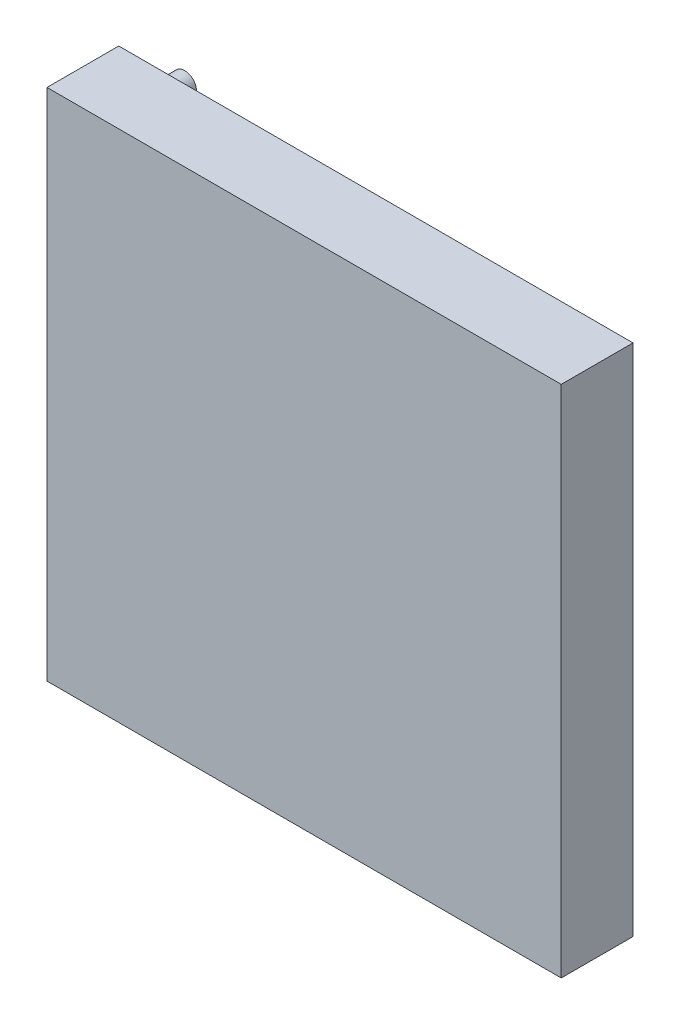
ISO-10303-21;
HEADER;
FILE_DESCRIPTION(('STEP AP214'),'2;1');
FILE_NAME('part.step','',(''),(''),'','','');
FILE_SCHEMA(('AUTOMOTIVE_DESIGN { 1 0 10303 214 1 1 1 1 }'));
ENDSEC;
DATA;
#1=APPLICATION_CONTEXT('core data for automotive mechanical design processes');
#2=APPLICATION_PROTOCOL_DEFINITION('international standard','automotive_design',2000,#1);
#3=PRODUCT_CONTEXT('',#1,'mechanical');
#4=PRODUCT('Part','Part','',(#3));
#5=PRODUCT_RELATED_PRODUCT_CATEGORY('part','',(#4));
#6=PRODUCT_DEFINITION_FORMATION('','',#4);
#7=PRODUCT_DEFINITION_CONTEXT('part definition',#1,'design');
#8=PRODUCT_DEFINITION('design','',#6,#7);
#9=PRODUCT_DEFINITION_SHAPE('','',#8);
#10=(LENGTH_UNIT() NAMED_UNIT(*) SI_UNIT(.MILLI.,.METRE.));
#11=(NAMED_UNIT(*) PLANE_ANGLE_UNIT() SI_UNIT($,.RADIAN.));
#12=(NAMED_UNIT(*) SI_UNIT($,.STERADIAN.) SOLID_ANGLE_UNIT());
#13=UNCERTAINTY_MEASURE_WITH_UNIT(LENGTH_MEASURE(1.E-05),#10,'distance_accuracy_value','');
#14=(GEOMETRIC_REPRESENTATION_CONTEXT(3) GLOBAL_UNCERTAINTY_ASSIGNED_CONTEXT((#13)) GLOBAL_UNIT_ASSIGNED_CONTEXT((#10,
#11,#12)) REPRESENTATION_CONTEXT('',''));
#15=CARTESIAN_POINT('',(0.,0.,0.));
#16=DIRECTION('',(0.,0.,1.));
#17=DIRECTION('',(1.,0.,0.));
#18=AXIS2_PLACEMENT_3D('',#15,#16,#17);
#19=CARTESIAN_POINT('',(0.,0.,0.));
#20=DIRECTION('',(0.,0.,-1.));
#21=DIRECTION('',(-1.,0.,0.));
#22=AXIS2_PLACEMENT_3D('',#19,#20,#21);
#23=PLANE('',#22);
#24=CARTESIAN_POINT('',(61.9735947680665,-224.613601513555,0.));
#25=CARTESIAN_POINT('',(61.9787719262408,-224.594968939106,0.));
#26=CARTESIAN_POINT('',(61.9900012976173,-224.554554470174,0.));
#27=CARTESIAN_POINT('',(62.0020265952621,-224.487667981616,0.));
#28=CARTESIAN_POINT('',(62.0121356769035,-224.410653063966,0.));
#29=CARTESIAN_POINT('',(62.0216412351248,-224.323504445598,0.));
#30=CARTESIAN_POINT('',(62.0272501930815,-224.226154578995,0.));
#31=CARTESIAN_POINT('',(62.0321676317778,-224.118645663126,0.));
#32=CARTESIAN_POINT('',(62.0360292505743,-224.00084770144,0.));
#33=CARTESIAN_POINT('',(62.0360064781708,-223.918793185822,0.));
#34=CARTESIAN_POINT('',(62.0359946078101,-223.87602138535,0.));
#35=B_SPLINE_CURVE_WITH_KNOTS('',3,(#24,#25,#26,#27,#28,#29,#30,#31,#32,#33,#34),.UNSPECIFIED.,
.F.,.F.,(4,1,1,1,1,1,1,1,4),(0.,0.0781298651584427,0.169465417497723,0.274335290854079,
0.392110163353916,0.523687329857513,0.668365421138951,0.827131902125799,1.),.UNSPECIFIED.);
#36=CARTESIAN_POINT('',(61.9735947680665,-224.613601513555,0.));
#37=VERTEX_POINT('',#36);
#38=CARTESIAN_POINT('',(62.0359946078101,-223.87602138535,0.));
#39=VERTEX_POINT('',#38);
#40=EDGE_CURVE('E706',#37,#39,#35,.T.);
#41=ORIENTED_EDGE('',*,*,#40,.T.);
#42=DIRECTION('',(0.,1.,0.));
#43=VECTOR('',#42,1.);
#44=CARTESIAN_POINT('',(62.0359946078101,-223.87602138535,0.));
#45=LINE('',#44,#43);
#46=CARTESIAN_POINT('',(62.0359946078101,-221.762139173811,0.));
#47=VERTEX_POINT('',#46);
#48=EDGE_CURVE('E2067',#39,#47,#45,.T.);
#49=ORIENTED_EDGE('',*,*,#48,.T.);
#50=DIRECTION('',(-1.,0.,0.));
#51=VECTOR('',#50,1.);
#52=CARTESIAN_POINT('',(62.0359946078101,-221.762139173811,0.));
#53=LINE('',#52,#51);
#54=CARTESIAN_POINT('',(61.7218920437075,-221.762139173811,0.));
#55=VERTEX_POINT('',#54);
#56=EDGE_CURVE('E2073',#47,#55,#53,.T.);
#57=ORIENTED_EDGE('',*,*,#56,.T.);
#58=DIRECTION('',(0.,-1.,0.));
#59=VECTOR('',#58,1.);
#60=CARTESIAN_POINT('',(61.7218920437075,-221.762139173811,0.));
#61=LINE('',#60,#59);
#62=CARTESIAN_POINT('',(61.7218920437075,-223.859194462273,0.));
#63=VERTEX_POINT('',#62);
#64=EDGE_CURVE('E2077',#55,#63,#61,.T.);
#65=ORIENTED_EDGE('',*,*,#64,.T.);
#66=CARTESIAN_POINT('',(61.7218920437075,-223.859194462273,0.));
#67=CARTESIAN_POINT('',(61.7219387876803,-223.888875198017,0.));
#68=CARTESIAN_POINT('',(61.7220274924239,-223.945199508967,0.));
#69=CARTESIAN_POINT('',(61.7214349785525,-224.025367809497,0.));
#70=CARTESIAN_POINT('',(61.7197756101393,-224.096640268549,0.));
#71=CARTESIAN_POINT('',(61.718729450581,-224.159291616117,0.));
#72=CARTESIAN_POINT('',(61.7164021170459,-224.213034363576,0.));
#73=CARTESIAN_POINT('',(61.7145040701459,-224.25815967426,0.));
#74=CARTESIAN_POINT('',(61.7120635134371,-224.294453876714,0.));
#75=CARTESIAN_POINT('',(61.7091303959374,-224.315634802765,0.));
#76=CARTESIAN_POINT('',(61.7078696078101,-224.324739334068,0.));
#77=B_SPLINE_CURVE_WITH_KNOTS('',3,(#66,#67,#68,#69,#70,#71,#72,#73,#74,#75,#76),.UNSPECIFIED.,
.F.,.F.,(4,1,1,1,1,1,1,1,4),(0.,0.191078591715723,0.362604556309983,0.516098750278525,
0.650038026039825,0.765976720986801,0.862374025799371,0.940842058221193,1.),.UNSPECIFIED.);
#78=CARTESIAN_POINT('',(61.7078696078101,-224.324739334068,0.));
#79=VERTEX_POINT('',#78);
#80=EDGE_CURVE('E2080',#63,#79,#77,.T.);
#81=ORIENTED_EDGE('',*,*,#80,.T.);
#82=CARTESIAN_POINT('',(61.7078696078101,-224.324739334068,0.));
#83=CARTESIAN_POINT('',(61.7026921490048,-224.357586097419,0.));
#84=CARTESIAN_POINT('',(61.6926289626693,-224.421428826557,0.));
#85=CARTESIAN_POINT('',(61.6669825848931,-224.512337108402,0.));
#86=CARTESIAN_POINT('',(61.6311650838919,-224.594268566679,0.));
#87=CARTESIAN_POINT('',(61.5887220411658,-224.669779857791,0.));
#88=CARTESIAN_POINT('',(61.5327894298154,-224.736769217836,0.));
#89=CARTESIAN_POINT('',(61.4657858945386,-224.798480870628,0.));
#90=CARTESIAN_POINT('',(61.3846081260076,-224.85245267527,0.));
#91=CARTESIAN_POINT('',(61.2943475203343,-224.901803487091,0.));
#92=CARTESIAN_POINT('',(61.1970622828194,-224.941468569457,0.));
#93=CARTESIAN_POINT('',(61.0976510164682,-224.971461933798,0.));
#94=CARTESIAN_POINT('',(60.997608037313,-224.989740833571,0.));
#95=CARTESIAN_POINT('',(60.9306318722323,-224.991857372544,0.));
#96=CARTESIAN_POINT('',(60.8973728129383,-224.99290840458,0.));
#97=B_SPLINE_CURVE_WITH_KNOTS('',3,(#82,#83,#84,#85,#86,#87,#88,#89,#90,#91,#92,#93,#94,#95,
#96),.UNSPECIFIED.,.F.,.F.,(4,1,1,1,1,1,1,1,1,1,1,1,4),(0.,0.0863150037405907,0.16776646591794,
0.244432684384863,0.318134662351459,0.391884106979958,0.470068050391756,0.553904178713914,
0.644339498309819,0.736874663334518,0.826168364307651,0.913678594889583,1.),.UNSPECIFIED.);
#98=CARTESIAN_POINT('',(60.8973728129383,-224.99290840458,0.));
#99=VERTEX_POINT('',#98);
#100=EDGE_CURVE('E2085',#79,#99,#97,.T.);
#101=ORIENTED_EDGE('',*,*,#100,.T.);
#102=CARTESIAN_POINT('',(60.8973728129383,-224.99290840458,0.));
#103=CARTESIAN_POINT('',(60.8688190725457,-224.991834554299,0.));
#104=CARTESIAN_POINT('',(60.8118765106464,-224.989693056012,0.));
#105=CARTESIAN_POINT('',(60.7272700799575,-224.976431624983,0.));
#106=CARTESIAN_POINT('',(60.6448699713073,-224.952531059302,0.));
#107=CARTESIAN_POINT('',(60.5642692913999,-224.921691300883,0.));
#108=CARTESIAN_POINT('',(60.4887183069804,-224.880943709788,0.));
#109=CARTESIAN_POINT('',(60.4181748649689,-224.833872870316,0.));
#110=CARTESIAN_POINT('',(60.3552109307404,-224.778661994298,0.));
#111=CARTESIAN_POINT('',(60.2977529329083,-224.717561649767,0.));
#112=CARTESIAN_POINT('',(60.2477179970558,-224.6486218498,0.));
#113=CARTESIAN_POINT('',(60.204346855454,-224.573343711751,0.));
#114=CARTESIAN_POINT('',(60.1688209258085,-224.490594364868,0.));
#115=CARTESIAN_POINT('',(60.151277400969,-224.432439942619,0.));
#116=CARTESIAN_POINT('',(60.1422646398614,-224.402563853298,0.));
#117=B_SPLINE_CURVE_WITH_KNOTS('',3,(#102,#103,#104,#105,#106,#107,#108,#109,#110,#111,#112,
#113,#114,#115,#116),.UNSPECIFIED.,.F.,.F.,(4,1,1,1,1,1,1,1,1,1,1,1,4),(0.,0.0828906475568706,
0.165302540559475,0.247761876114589,0.33152771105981,0.415279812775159,0.496366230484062,
0.577151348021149,0.657782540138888,0.739321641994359,0.823793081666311,0.909475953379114,1.),.UNSPECIFIED.);
#118=CARTESIAN_POINT('',(60.1422646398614,-224.402563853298,0.));
#119=VERTEX_POINT('',#118);
#120=EDGE_CURVE('E2093',#99,#119,#117,.T.);
#121=ORIENTED_EDGE('',*,*,#120,.T.);
#122=CARTESIAN_POINT('',(60.1422646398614,-224.402563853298,0.));
#123=CARTESIAN_POINT('',(60.1392645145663,-224.390215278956,0.));
#124=CARTESIAN_POINT('',(60.1325790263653,-224.362697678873,0.));
#125=CARTESIAN_POINT('',(60.1263319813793,-224.316176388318,0.));
#126=CARTESIAN_POINT('',(60.1198254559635,-224.261287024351,0.));
#127=CARTESIAN_POINT('',(60.1153108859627,-224.197635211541,0.));
#128=CARTESIAN_POINT('',(60.1109096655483,-224.125434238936,0.));
#129=CARTESIAN_POINT('',(60.1082765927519,-224.044307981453,0.));
#130=CARTESIAN_POINT('',(60.1070595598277,-223.954551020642,0.));
#131=CARTESIAN_POINT('',(60.1066968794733,-223.891913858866,0.));
#132=CARTESIAN_POINT('',(60.1065074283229,-223.859194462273,0.));
#133=B_SPLINE_CURVE_WITH_KNOTS('',3,(#122,#123,#124,#125,#126,#127,#128,#129,#130,#131,#132),
.UNSPECIFIED.,.F.,.F.,(4,1,1,1,1,1,1,1,4),(0.,0.0698351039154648,0.155620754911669,
0.257801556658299,0.373811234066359,0.50640249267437,0.655564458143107,0.820079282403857,1.),.UNSPECIFIED.);
#134=CARTESIAN_POINT('',(60.1065074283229,-223.859194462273,0.));
#135=VERTEX_POINT('',#134);
#136=EDGE_CURVE('E2101',#119,#135,#133,.T.);
#137=ORIENTED_EDGE('',*,*,#136,.T.);
#138=DIRECTION('',(0.,1.,0.));
#139=VECTOR('',#138,1.);
#140=CARTESIAN_POINT('',(60.1065074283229,-223.859194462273,0.));
#141=LINE('',#140,#139);
#142=CARTESIAN_POINT('',(60.1065074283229,-221.762139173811,0.));
#143=VERTEX_POINT('',#142);
#144=EDGE_CURVE('E2109',#135,#143,#141,.T.);
#145=ORIENTED_EDGE('',*,*,#144,.T.);
#146=DIRECTION('',(-1.,0.,0.));
#147=VECTOR('',#146,1.);
#148=CARTESIAN_POINT('',(60.1065074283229,-221.762139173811,0.));
#149=LINE('',#148,#147);
#150=CARTESIAN_POINT('',(59.7924048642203,-221.762139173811,0.));
#151=VERTEX_POINT('',#150);
#152=EDGE_CURVE('E2115',#143,#151,#149,.T.);
#153=ORIENTED_EDGE('',*,*,#152,.T.);
#154=DIRECTION('',(0.,-1.,0.));
#155=VECTOR('',#154,1.);
#156=CARTESIAN_POINT('',(59.7924048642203,-221.762139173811,0.));
#157=LINE('',#156,#155);
#158=CARTESIAN_POINT('',(59.7924048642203,-223.87602138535,0.));
#159=VERTEX_POINT('',#158);
#160=EDGE_CURVE('E2118',#151,#159,#157,.T.);
#161=ORIENTED_EDGE('',*,*,#160,.T.);
#162=CARTESIAN_POINT('',(59.7924048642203,-223.87602138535,0.));
#163=CARTESIAN_POINT('',(59.7926589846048,-223.914119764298,0.));
#164=CARTESIAN_POINT('',(59.7931549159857,-223.9884710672,0.));
#165=CARTESIAN_POINT('',(59.7974554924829,-224.097422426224,0.));
#166=CARTESIAN_POINT('',(59.804312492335,-224.200775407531,0.));
#167=CARTESIAN_POINT('',(59.8140005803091,-224.298543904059,0.));
#168=CARTESIAN_POINT('',(59.8268375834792,-224.390378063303,0.));
#169=CARTESIAN_POINT('',(59.8411128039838,-224.477082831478,0.));
#170=CARTESIAN_POINT('',(59.8592923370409,-224.558035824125,0.));
#171=CARTESIAN_POINT('',(59.8805257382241,-224.63386824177,0.));
#172=CARTESIAN_POINT('',(59.9047992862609,-224.706053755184,0.));
#173=CARTESIAN_POINT('',(59.9362404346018,-224.774562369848,0.));
#174=CARTESIAN_POINT('',(59.9716649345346,-224.841476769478,0.));
#175=CARTESIAN_POINT('',(60.0136795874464,-224.90578487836,0.));
#176=CARTESIAN_POINT('',(60.0608909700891,-224.967771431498,0.));
#177=CARTESIAN_POINT('',(60.1143426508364,-225.027060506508,0.));
#178=CARTESIAN_POINT('',(60.1722668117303,-225.084599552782,0.));
#179=CARTESIAN_POINT('',(60.235626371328,-225.138912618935,0.));
#180=CARTESIAN_POINT('',(60.3033768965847,-225.188721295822,0.));
#181=CARTESIAN_POINT('',(60.3753168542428,-225.232519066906,0.));
#182=CARTESIAN_POINT('',(60.4508936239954,-225.269542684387,0.));
#183=CARTESIAN_POINT('',(60.5299107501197,-225.300018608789,0.));
#184=CARTESIAN_POINT('',(60.612401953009,-225.322933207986,0.));
#185=CARTESIAN_POINT('',(60.6983693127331,-225.340008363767,0.));
#186=CARTESIAN_POINT('',(60.7880085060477,-225.349710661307,0.));
#187=CARTESIAN_POINT('',(60.8489731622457,-225.351152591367,0.));
#188=CARTESIAN_POINT('',(60.8798447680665,-225.351882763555,0.));
#189=B_SPLINE_CURVE_WITH_KNOTS('',3,(#162,#163,#164,#165,#166,#167,#168,#169,#170,#171,#172,
#173,#174,#175,#176,#177,#178,#179,#180,#181,#182,#183,#184,#185,#186,#187,#188),.UNSPECIFIED.,
.F.,.F.,(4,1,1,1,1,1,1,1,1,1,1,1,1,1,1,1,1,1,1,1,1,1,1,1,4),(0.,0.0548580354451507,
0.107058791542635,0.15697835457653,0.203992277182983,0.248491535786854,0.29048331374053,
0.330489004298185,0.367885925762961,0.403858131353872,0.440009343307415,0.476295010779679,
0.512792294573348,0.550484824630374,0.588381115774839,0.627645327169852,0.667979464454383,
0.708432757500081,0.748602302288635,0.78908777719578,0.829461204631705,0.870371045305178,
0.912214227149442,0.955546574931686,1.),.UNSPECIFIED.);
#190=CARTESIAN_POINT('',(60.8798447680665,-225.351882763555,0.));
#191=VERTEX_POINT('',#190);
#192=EDGE_CURVE('E2121',#159,#191,#189,.T.);
#193=ORIENTED_EDGE('',*,*,#192,.T.);
#194=CARTESIAN_POINT('',(60.8798447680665,-225.351882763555,0.));
#195=CARTESIAN_POINT('',(60.9135138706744,-225.351097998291,0.));
#196=CARTESIAN_POINT('',(60.9795725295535,-225.34955829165,0.));
#197=CARTESIAN_POINT('',(61.0769105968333,-225.340735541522,0.));
#198=CARTESIAN_POINT('',(61.1702247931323,-225.324117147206,0.));
#199=CARTESIAN_POINT('',(61.2605006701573,-225.302957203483,0.));
#200=CARTESIAN_POINT('',(61.3465091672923,-225.273773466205,0.));
#201=CARTESIAN_POINT('',(61.4294026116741,-225.239675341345,0.));
#202=CARTESIAN_POINT('',(61.5077612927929,-225.197798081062,0.));
#203=CARTESIAN_POINT('',(61.5828564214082,-225.151204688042,0.));
#204=CARTESIAN_POINT('',(61.6526811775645,-225.098780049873,0.));
#205=CARTESIAN_POINT('',(61.7167785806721,-225.041639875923,0.));
#206=CARTESIAN_POINT('',(61.7752544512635,-224.980699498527,0.));
#207=CARTESIAN_POINT('',(61.8271231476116,-224.915299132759,0.));
#208=CARTESIAN_POINT('',(61.8732440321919,-224.845947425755,0.));
#209=CARTESIAN_POINT('',(61.9129742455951,-224.772448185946,0.));
#210=CARTESIAN_POINT('',(61.9470874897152,-224.694829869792,0.));
#211=CARTESIAN_POINT('',(61.9646940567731,-224.640876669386,0.));
#212=CARTESIAN_POINT('',(61.9735947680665,-224.613601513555,0.));
#213=B_SPLINE_CURVE_WITH_KNOTS('',3,(#194,#195,#196,#197,#198,#199,#200,#201,#202,#203,#204,
#205,#206,#207,#208,#209,#210,#211,#212),.UNSPECIFIED.,.F.,.F.,(4,1,1,1,1,1,1,1,1,1,1,1,1,1,1,1,
4),(0.,0.0711745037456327,0.139644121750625,0.206317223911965,0.271373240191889,
0.335418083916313,0.398076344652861,0.460607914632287,0.52296951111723,0.58471572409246,
0.644894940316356,0.704290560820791,0.762998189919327,0.821087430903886,0.880103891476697,
0.939388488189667,1.),.UNSPECIFIED.);
#214=EDGE_CURVE('E2126',#191,#37,#213,.T.);
#215=ORIENTED_EDGE('',*,*,#214,.T.);
#216=EDGE_LOOP('',(#41,#49,#57,#65,#81,#101,#121,#137,#145,#153,#161,#193,#215));
#217=FACE_BOUND('',#216,.T.);
#218=DIRECTION('',(0.,1.,0.));
#219=VECTOR('',#218,1.);
#220=CARTESIAN_POINT('',(58.8321484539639,-225.262139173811,0.));
#221=LINE('',#220,#219);
#222=CARTESIAN_POINT('',(58.8321484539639,-225.262139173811,0.));
#223=VERTEX_POINT('',#222);
#224=CARTESIAN_POINT('',(58.8321484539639,-222.121113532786,0.));
#225=VERTEX_POINT('',#224);
#226=EDGE_CURVE('E2176',#223,#225,#221,.T.);
#227=ORIENTED_EDGE('',*,*,#226,.T.);
#228=DIRECTION('',(1.,0.,0.));
#229=VECTOR('',#228,1.);
#230=CARTESIAN_POINT('',(58.8321484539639,-222.121113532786,0.));
#231=LINE('',#230,#229);
#232=CARTESIAN_POINT('',(59.5949689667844,-222.121113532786,0.));
#233=VERTEX_POINT('',#232);
#234=EDGE_CURVE('E2191',#225,#233,#231,.T.);
#235=ORIENTED_EDGE('',*,*,#234,.T.);
#236=DIRECTION('',(0.,1.,0.));
#237=VECTOR('',#236,1.);
#238=CARTESIAN_POINT('',(59.5949689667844,-222.121113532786,0.));
#239=LINE('',#238,#237);
#240=CARTESIAN_POINT('',(59.5949689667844,-221.762139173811,0.));
#241=VERTEX_POINT('',#240);
#242=EDGE_CURVE('E2194',#233,#241,#239,.T.);
#243=ORIENTED_EDGE('',*,*,#242,.T.);
#244=DIRECTION('',(-1.,0.,0.));
#245=VECTOR('',#244,1.);
#246=CARTESIAN_POINT('',(59.5949689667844,-221.762139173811,0.));
#247=LINE('',#246,#245);
#248=CARTESIAN_POINT('',(57.7552253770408,-221.762139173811,0.));
#249=VERTEX_POINT('',#248);
#250=EDGE_CURVE('E2197',#241,#249,#247,.T.);
#251=ORIENTED_EDGE('',*,*,#250,.T.);
#252=DIRECTION('',(0.,-1.,0.));
#253=VECTOR('',#252,1.);
#254=CARTESIAN_POINT('',(57.7552253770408,-221.762139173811,0.));
#255=LINE('',#254,#253);
#256=CARTESIAN_POINT('',(57.7552253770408,-222.121113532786,0.));
#257=VERTEX_POINT('',#256);
#258=EDGE_CURVE('E2200',#249,#257,#255,.T.);
#259=ORIENTED_EDGE('',*,*,#258,.T.);
#260=DIRECTION('',(1.,0.,0.));
#261=VECTOR('',#260,1.);
#262=CARTESIAN_POINT('',(57.7552253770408,-222.121113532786,0.));
#263=LINE('',#262,#261);
#264=CARTESIAN_POINT('',(58.5180458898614,-222.121113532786,0.));
#265=VERTEX_POINT('',#264);
#266=EDGE_CURVE('E2203',#257,#265,#263,.T.);
#267=ORIENTED_EDGE('',*,*,#266,.T.);
#268=DIRECTION('',(0.,-1.,0.));
#269=VECTOR('',#268,1.);
#270=CARTESIAN_POINT('',(58.5180458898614,-222.121113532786,0.));
#271=LINE('',#270,#269);
#272=CARTESIAN_POINT('',(58.5180458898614,-225.262139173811,0.));
#273=VERTEX_POINT('',#272);
#274=EDGE_CURVE('E2206',#265,#273,#271,.T.);
#275=ORIENTED_EDGE('',*,*,#274,.T.);
#276=DIRECTION('',(1.,0.,0.));
#277=VECTOR('',#276,1.);
#278=CARTESIAN_POINT('',(58.5180458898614,-225.262139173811,0.));
#279=LINE('',#278,#277);
#280=EDGE_CURVE('E2209',#273,#223,#279,.T.);
#281=ORIENTED_EDGE('',*,*,#280,.T.);
#282=EDGE_LOOP('',(#227,#235,#243,#251,#259,#267,#275,#281));
#283=FACE_BOUND('',#282,.T.);
#284=DIRECTION('',(1.,0.,0.));
#285=VECTOR('',#284,1.);
#286=CARTESIAN_POINT('',(68.5065074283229,-225.262139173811,0.));
#287=LINE('',#286,#285);
#288=CARTESIAN_POINT('',(68.5065074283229,-225.262139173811,0.));
#289=VERTEX_POINT('',#288);
#290=CARTESIAN_POINT('',(68.8206099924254,-225.262139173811,0.));
#291=VERTEX_POINT('',#290);
#292=EDGE_CURVE('E2234',#289,#291,#287,.T.);
#293=ORIENTED_EDGE('',*,*,#292,.T.);
#294=DIRECTION('',(0.,1.,0.));
#295=VECTOR('',#294,1.);
#296=CARTESIAN_POINT('',(68.8206099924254,-225.262139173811,0.));
#297=LINE('',#296,#295);
#298=CARTESIAN_POINT('',(68.8206099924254,-221.762139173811,0.));
#299=VERTEX_POINT('',#298);
#300=EDGE_CURVE('E540',#291,#299,#297,.T.);
#301=ORIENTED_EDGE('',*,*,#300,.T.);
#302=DIRECTION('',(-1.,0.,0.));
#303=VECTOR('',#302,1.);
#304=CARTESIAN_POINT('',(68.8206099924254,-221.762139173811,0.));
#305=LINE('',#304,#303);
#306=CARTESIAN_POINT('',(68.5065074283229,-221.762139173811,0.));
#307=VERTEX_POINT('',#306);
#308=EDGE_CURVE('E544',#299,#307,#305,.T.);
#309=ORIENTED_EDGE('',*,*,#308,.T.);
#310=DIRECTION('',(0.,-1.,0.));
#311=VECTOR('',#310,1.);
#312=CARTESIAN_POINT('',(68.5065074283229,-221.762139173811,0.));
#313=LINE('',#312,#311);
#314=EDGE_CURVE('E2243',#307,#289,#313,.T.);
#315=ORIENTED_EDGE('',*,*,#314,.T.);
#316=EDGE_LOOP('',(#293,#301,#309,#315));
#317=FACE_BOUND('',#316,.T.);
#318=DIRECTION('',(0.,1.,0.));
#319=VECTOR('',#318,1.);
#320=CARTESIAN_POINT('',(76.3183699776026,-204.611378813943,0.));
#321=LINE('',#320,#319);
#322=CARTESIAN_POINT('',(76.3183699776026,-226.10174809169,0.));
#323=VERTEX_POINT('',#322);
#324=CARTESIAN_POINT('',(76.3183699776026,-204.611378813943,0.));
#325=VERTEX_POINT('',#324);
#326=EDGE_CURVE('E1104',#323,#325,#321,.T.);
#327=ORIENTED_EDGE('',*,*,#326,.F.);
#328=DIRECTION('',(1.,0.,0.));
#329=VECTOR('',#328,1.);
#330=CARTESIAN_POINT('',(76.3183699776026,-226.10174809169,0.));
#331=LINE('',#330,#329);
#332=CARTESIAN_POINT('',(54.8235750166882,-226.10174809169,0.));
#333=VERTEX_POINT('',#332);
#334=EDGE_CURVE('E1097',#333,#323,#331,.T.);
#335=ORIENTED_EDGE('',*,*,#334,.F.);
#336=DIRECTION('',(0.,-1.,0.));
#337=VECTOR('',#336,1.);
#338=CARTESIAN_POINT('',(54.8235750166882,-204.611378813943,0.));
#339=LINE('',#338,#337);
#340=CARTESIAN_POINT('',(54.8235750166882,-204.611378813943,0.));
#341=VERTEX_POINT('',#340);
#342=EDGE_CURVE('E1100',#341,#333,#339,.T.);
#343=ORIENTED_EDGE('',*,*,#342,.F.);
#344=DIRECTION('',(-1.,0.,0.));
#345=VECTOR('',#344,1.);
#346=CARTESIAN_POINT('',(76.3183699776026,-204.611378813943,0.));
#347=LINE('',#346,#345);
#348=EDGE_CURVE('E1102',#325,#341,#347,.T.);
#349=ORIENTED_EDGE('',*,*,#348,.F.);
#350=EDGE_LOOP('',(#327,#335,#343,#349));
#351=FACE_BOUND('',#350,.T.);
#352=DIRECTION('',(-1.,0.,0.));
#353=VECTOR('',#352,1.);
#354=CARTESIAN_POINT('',(0.,-210.795393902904,0.));
#355=LINE('',#354,#353);
#356=CARTESIAN_POINT('',(73.2149271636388,-210.795393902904,0.));
#357=VERTEX_POINT('',#356);
#358=CARTESIAN_POINT('',(70.1928002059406,-210.795393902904,0.));
#359=VERTEX_POINT('',#358);
#360=EDGE_CURVE('E935',#357,#359,#355,.T.);
#361=ORIENTED_EDGE('',*,*,#360,.T.);
#362=DIRECTION('',(0.,-1.,0.));
#363=VECTOR('',#362,1.);
#364=CARTESIAN_POINT('',(70.1928002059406,0.,0.));
#365=LINE('',#364,#363);
#366=CARTESIAN_POINT('',(70.1928002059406,-211.795393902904,0.));
#367=VERTEX_POINT('',#366);
#368=EDGE_CURVE('E942',#359,#367,#365,.T.);
#369=ORIENTED_EDGE('',*,*,#368,.T.);
#370=DIRECTION('',(-1.,0.,0.));
#371=VECTOR('',#370,1.);
#372=CARTESIAN_POINT('',(0.,-211.795393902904,0.));
#373=LINE('',#372,#371);
#374=CARTESIAN_POINT('',(73.2149271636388,-211.795393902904,0.));
#375=VERTEX_POINT('',#374);
#376=EDGE_CURVE('E944',#375,#367,#373,.T.);
#377=ORIENTED_EDGE('',*,*,#376,.F.);
#378=DIRECTION('',(0.,1.,0.));
#379=VECTOR('',#378,1.);
#380=CARTESIAN_POINT('',(73.2149271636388,0.,0.));
#381=LINE('',#380,#379);
#382=EDGE_CURVE('E947',#375,#357,#381,.T.);
#383=ORIENTED_EDGE('',*,*,#382,.T.);
#384=EDGE_LOOP('',(#361,#369,#377,#383));
#385=FACE_BOUND('',#384,.T.);
#386=DIRECTION('',(0.,-1.,0.));
#387=VECTOR('',#386,1.);
#388=CARTESIAN_POINT('',(66.5829720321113,0.,0.));
#389=LINE('',#388,#387);
#390=CARTESIAN_POINT('',(66.5829720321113,-206.116362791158,0.));
#391=VERTEX_POINT('',#390);
#392=CARTESIAN_POINT('',(66.5829720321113,-209.138489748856,0.));
#393=VERTEX_POINT('',#392);
#394=EDGE_CURVE('E915',#391,#393,#389,.T.);
#395=ORIENTED_EDGE('',*,*,#394,.T.);
#396=DIRECTION('',(1.,0.,0.));
#397=VECTOR('',#396,1.);
#398=CARTESIAN_POINT('',(0.,-209.138489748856,0.));
#399=LINE('',#398,#397);
#400=CARTESIAN_POINT('',(67.5829720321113,-209.138489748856,0.));
#401=VERTEX_POINT('',#400);
#402=EDGE_CURVE('E923',#393,#401,#399,.T.);
#403=ORIENTED_EDGE('',*,*,#402,.T.);
#404=DIRECTION('',(0.,-1.,0.));
#405=VECTOR('',#404,1.);
#406=CARTESIAN_POINT('',(67.5829720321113,0.,0.));
#407=LINE('',#406,#405);
#408=CARTESIAN_POINT('',(67.5829720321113,-206.116362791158,0.));
#409=VERTEX_POINT('',#408);
#410=EDGE_CURVE('E926',#409,#401,#407,.T.);
#411=ORIENTED_EDGE('',*,*,#410,.F.);
#412=DIRECTION('',(-1.,0.,0.));
#413=VECTOR('',#412,1.);
#414=CARTESIAN_POINT('',(0.,-206.116362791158,0.));
#415=LINE('',#414,#413);
#416=EDGE_CURVE('E929',#409,#391,#415,.T.);
#417=ORIENTED_EDGE('',*,*,#416,.T.);
#418=EDGE_LOOP('',(#395,#403,#411,#417));
#419=FACE_BOUND('',#418,.T.);
#420=DIRECTION('',(-1.,0.,0.));
#421=VECTOR('',#420,1.);
#422=CARTESIAN_POINT('',(0.,-209.137335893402,0.));
#423=LINE('',#422,#421);
#424=CARTESIAN_POINT('',(56.0812549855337,-209.137335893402,0.));
#425=VERTEX_POINT('',#424);
#426=CARTESIAN_POINT('',(55.0812549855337,-209.137335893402,0.));
#427=VERTEX_POINT('',#426);
#428=EDGE_CURVE('E1936',#425,#427,#423,.T.);
#429=ORIENTED_EDGE('',*,*,#428,.F.);
#430=DIRECTION('',(0.,-1.,0.));
#431=VECTOR('',#430,1.);
#432=CARTESIAN_POINT('',(56.0812549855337,0.,0.));
#433=LINE('',#432,#431);
#434=CARTESIAN_POINT('',(56.0812549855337,-206.115208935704,0.));
#435=VERTEX_POINT('',#434);
#436=EDGE_CURVE('E910',#435,#425,#433,.T.);
#437=ORIENTED_EDGE('',*,*,#436,.F.);
#438=DIRECTION('',(1.,0.,0.));
#439=VECTOR('',#438,1.);
#440=CARTESIAN_POINT('',(0.,-206.115208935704,0.));
#441=LINE('',#440,#439);
#442=CARTESIAN_POINT('',(55.0812549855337,-206.115208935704,0.));
#443=VERTEX_POINT('',#442);
#444=EDGE_CURVE('E1941',#443,#435,#441,.T.);
#445=ORIENTED_EDGE('',*,*,#444,.F.);
#446=DIRECTION('',(0.,-1.,0.));
#447=VECTOR('',#446,1.);
#448=CARTESIAN_POINT('',(55.0812549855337,0.,0.));
#449=LINE('',#448,#447);
#450=EDGE_CURVE('E1938',#443,#427,#449,.T.);
#451=ORIENTED_EDGE('',*,*,#450,.T.);
#452=EDGE_LOOP('',(#429,#437,#445,#451));
#453=FACE_BOUND('',#452,.T.);
#454=DIRECTION('',(-1.,0.,0.));
#455=VECTOR('',#454,1.);
#456=CARTESIAN_POINT('',(0.,-224.584921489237,0.));
#457=LINE('',#456,#455);
#458=CARTESIAN_POINT('',(73.2149271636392,-224.584921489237,0.));
#459=VERTEX_POINT('',#458);
#460=CARTESIAN_POINT('',(70.192800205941,-224.584921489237,0.));
#461=VERTEX_POINT('',#460);
#462=EDGE_CURVE('E1951',#459,#461,#457,.T.);
#463=ORIENTED_EDGE('',*,*,#462,.T.);
#464=DIRECTION('',(0.,-1.,0.));
#465=VECTOR('',#464,1.);
#466=CARTESIAN_POINT('',(70.192800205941,0.,0.));
#467=LINE('',#466,#465);
#468=CARTESIAN_POINT('',(70.192800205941,-225.584921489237,0.));
#469=VERTEX_POINT('',#468);
#470=EDGE_CURVE('E2261',#461,#469,#467,.T.);
#471=ORIENTED_EDGE('',*,*,#470,.T.);
#472=DIRECTION('',(-1.,0.,0.));
#473=VECTOR('',#472,1.);
#474=CARTESIAN_POINT('',(0.,-225.584921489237,0.));
#475=LINE('',#474,#473);
#476=CARTESIAN_POINT('',(73.2149271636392,-225.584921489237,0.));
#477=VERTEX_POINT('',#476);
#478=EDGE_CURVE('E1921',#477,#469,#475,.T.);
#479=ORIENTED_EDGE('',*,*,#478,.F.);
#480=DIRECTION('',(0.,1.,0.));
#481=VECTOR('',#480,1.);
#482=CARTESIAN_POINT('',(73.2149271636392,0.,0.));
#483=LINE('',#482,#481);
#484=EDGE_CURVE('E1928',#477,#459,#483,.T.);
#485=ORIENTED_EDGE('',*,*,#484,.T.);
#486=EDGE_LOOP('',(#463,#471,#479,#485));
#487=FACE_BOUND('',#486,.T.);
#488=DIRECTION('',(1.,0.,0.));
#489=VECTOR('',#488,1.);
#490=CARTESIAN_POINT('',(64.2975330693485,-225.262139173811,0.));
#491=LINE('',#490,#489);
#492=CARTESIAN_POINT('',(64.2975330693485,-225.262139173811,0.));
#493=VERTEX_POINT('',#492);
#494=CARTESIAN_POINT('',(64.6116356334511,-225.262139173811,0.));
#495=VERTEX_POINT('',#494);
#496=EDGE_CURVE('E681',#493,#495,#491,.T.);
#497=ORIENTED_EDGE('',*,*,#496,.T.);
#498=DIRECTION('',(0.,1.,0.));
#499=VECTOR('',#498,1.);
#500=CARTESIAN_POINT('',(64.6116356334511,-225.262139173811,0.));
#501=LINE('',#500,#499);
#502=CARTESIAN_POINT('',(64.6116356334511,-221.762139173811,0.));
#503=VERTEX_POINT('',#502);
#504=EDGE_CURVE('E62',#495,#503,#501,.T.);
#505=ORIENTED_EDGE('',*,*,#504,.T.);
#506=DIRECTION('',(-1.,0.,0.));
#507=VECTOR('',#506,1.);
#508=CARTESIAN_POINT('',(64.6116356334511,-221.762139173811,0.));
#509=LINE('',#508,#507);
#510=CARTESIAN_POINT('',(63.9252373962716,-221.762139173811,0.));
#511=VERTEX_POINT('',#510);
#512=EDGE_CURVE('E639',#503,#511,#509,.T.);
#513=ORIENTED_EDGE('',*,*,#512,.T.);
#514=CARTESIAN_POINT('',(63.9252373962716,-221.762139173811,0.));
#515=CARTESIAN_POINT('',(63.8780264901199,-221.762191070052,0.));
#516=CARTESIAN_POINT('',(63.7875682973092,-221.762290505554,0.));
#517=CARTESIAN_POINT('',(63.6578532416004,-221.76530525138,0.));
#518=CARTESIAN_POINT('',(63.540043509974,-221.769331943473,0.));
#519=CARTESIAN_POINT('',(63.4343931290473,-221.774913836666,0.));
#520=CARTESIAN_POINT('',(63.3405770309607,-221.781510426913,0.));
#521=CARTESIAN_POINT('',(63.2590197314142,-221.790762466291,0.));
#522=CARTESIAN_POINT('',(63.1890801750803,-221.800422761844,0.));
#523=CARTESIAN_POINT('',(63.1471737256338,-221.810244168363,0.));
#524=CARTESIAN_POINT('',(63.1280619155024,-221.814723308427,0.));
#525=B_SPLINE_CURVE_WITH_KNOTS('',3,(#514,#515,#516,#517,#518,#519,#520,#521,#522,#523,#524),
.UNSPECIFIED.,.F.,.F.,(4,1,1,1,1,1,1,1,4),(0.,0.17695575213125,0.339055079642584,
0.48631822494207,0.618780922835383,0.735618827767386,0.83874247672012,0.926457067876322,1.),.UNSPECIFIED.);
#526=CARTESIAN_POINT('',(63.1280619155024,-221.814723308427,0.));
#527=VERTEX_POINT('',#526);
#528=EDGE_CURVE('E643',#511,#527,#525,.T.);
#529=ORIENTED_EDGE('',*,*,#528,.T.);
#530=CARTESIAN_POINT('',(63.1280619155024,-221.814723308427,0.));
#531=CARTESIAN_POINT('',(63.1038683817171,-221.821345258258,0.));
#532=CARTESIAN_POINT('',(63.0560514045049,-221.834433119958,0.));
#533=CARTESIAN_POINT('',(62.9871503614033,-221.860646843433,0.));
#534=CARTESIAN_POINT('',(62.9215965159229,-221.891729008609,0.));
#535=CARTESIAN_POINT('',(62.8591649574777,-221.92715294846,0.));
#536=CARTESIAN_POINT('',(62.8006228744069,-221.968438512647,0.));
#537=CARTESIAN_POINT('',(62.7450968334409,-222.013912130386,0.));
#538=CARTESIAN_POINT('',(62.6930768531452,-222.064623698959,0.));
#539=CARTESIAN_POINT('',(62.644855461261,-222.120004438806,0.));
#540=CARTESIAN_POINT('',(62.6005706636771,-222.179124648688,0.));
#541=CARTESIAN_POINT('',(62.5624409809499,-222.242866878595,0.));
#542=CARTESIAN_POINT('',(62.5305137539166,-222.310158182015,0.));
#543=CARTESIAN_POINT('',(62.5031304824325,-222.380951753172,0.));
#544=CARTESIAN_POINT('',(62.4834220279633,-222.455842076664,0.));
#545=CARTESIAN_POINT('',(62.4685751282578,-222.534308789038,0.));
#546=CARTESIAN_POINT('',(62.4591515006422,-222.616343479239,0.));
#547=CARTESIAN_POINT('',(62.458248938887,-222.67240334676,0.));
#548=CARTESIAN_POINT('',(62.4577894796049,-222.700941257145,0.));
#549=B_SPLINE_CURVE_WITH_KNOTS('',3,(#530,#531,#532,#533,#534,#535,#536,#537,#538,#539,#540,
#541,#542,#543,#544,#545,#546,#547,#548),.UNSPECIFIED.,.F.,.F.,(4,1,1,1,1,1,1,1,1,1,1,1,1,1,1,1,
4),(0.,0.0624813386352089,0.123490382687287,0.183411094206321,0.243153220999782,
0.302126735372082,0.361709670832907,0.421842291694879,0.482931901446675,0.544552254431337,
0.605680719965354,0.667679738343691,0.729984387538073,0.794550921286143,0.860345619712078,
0.928907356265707,1.),.UNSPECIFIED.);
#550=CARTESIAN_POINT('',(62.4577894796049,-222.700941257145,0.));
#551=VERTEX_POINT('',#550);
#552=EDGE_CURVE('E648',#527,#551,#549,.T.);
#553=ORIENTED_EDGE('',*,*,#552,.T.);
#554=CARTESIAN_POINT('',(62.4577894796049,-222.700941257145,0.));
#555=CARTESIAN_POINT('',(62.4582109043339,-222.729719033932,0.));
#556=CARTESIAN_POINT('',(62.4590354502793,-222.786024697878,0.));
#557=CARTESIAN_POINT('',(62.4689317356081,-222.868397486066,0.));
#558=CARTESIAN_POINT('',(62.4822619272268,-222.947115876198,0.));
#559=CARTESIAN_POINT('',(62.502758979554,-223.022005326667,0.));
#560=CARTESIAN_POINT('',(62.5296046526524,-223.092621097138,0.));
#561=CARTESIAN_POINT('',(62.5610967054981,-223.160042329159,0.));
#562=CARTESIAN_POINT('',(62.5990802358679,-223.223122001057,0.));
#563=CARTESIAN_POINT('',(62.6427250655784,-223.282089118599,0.));
#564=CARTESIAN_POINT('',(62.6912766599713,-223.336999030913,0.));
#565=CARTESIAN_POINT('',(62.7445295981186,-223.387453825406,0.));
#566=CARTESIAN_POINT('',(62.8022688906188,-223.433158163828,0.));
#567=CARTESIAN_POINT('',(62.8643110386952,-223.474214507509,0.));
#568=CARTESIAN_POINT('',(62.9312608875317,-223.509670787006,0.));
#569=CARTESIAN_POINT('',(63.0021030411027,-223.541428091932,0.));
#570=CARTESIAN_POINT('',(63.0774532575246,-223.56809915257,0.));
#571=CARTESIAN_POINT('',(63.1295957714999,-223.582129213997,0.));
#572=CARTESIAN_POINT('',(63.1561067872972,-223.589262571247,0.));
#573=B_SPLINE_CURVE_WITH_KNOTS('',3,(#554,#555,#556,#557,#558,#559,#560,#561,#562,#563,#564,
#565,#566,#567,#568,#569,#570,#571,#572),.UNSPECIFIED.,.F.,.F.,(4,1,1,1,1,1,1,1,1,1,1,1,1,1,1,1,
4),(0.,0.0701188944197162,0.137192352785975,0.202016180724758,0.264631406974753,
0.326116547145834,0.386010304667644,0.445811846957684,0.505297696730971,0.564633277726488,
0.624282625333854,0.683902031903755,0.743952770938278,0.805387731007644,0.86838803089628,
0.933084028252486,1.),.UNSPECIFIED.);
#574=CARTESIAN_POINT('',(63.1561067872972,-223.589262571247,0.));
#575=VERTEX_POINT('',#574);
#576=EDGE_CURVE('E656',#551,#575,#573,.T.);
#577=ORIENTED_EDGE('',*,*,#576,.T.);
#578=CARTESIAN_POINT('',(63.1561067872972,-223.589262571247,0.));
#579=CARTESIAN_POINT('',(63.1780341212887,-223.593925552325,0.));
#580=CARTESIAN_POINT('',(63.2260891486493,-223.604144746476,0.));
#581=CARTESIAN_POINT('',(63.305231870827,-223.615553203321,0.));
#582=CARTESIAN_POINT('',(63.3973772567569,-223.625290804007,0.));
#583=CARTESIAN_POINT('',(63.5023995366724,-223.632591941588,0.));
#584=CARTESIAN_POINT('',(63.620204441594,-223.63884231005,0.));
#585=CARTESIAN_POINT('',(63.7508556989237,-223.64381040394,0.));
#586=CARTESIAN_POINT('',(63.894609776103,-223.646540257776,0.));
#587=CARTESIAN_POINT('',(63.994881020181,-223.646681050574,0.));
#588=CARTESIAN_POINT('',(64.0472325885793,-223.646754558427,0.));
#589=B_SPLINE_CURVE_WITH_KNOTS('',3,(#578,#579,#580,#581,#582,#583,#584,#585,#586,#587,#588),
.UNSPECIFIED.,.F.,.F.,(4,1,1,1,1,1,1,1,4),(0.,0.075173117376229,0.164746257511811,
0.268016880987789,0.385911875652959,0.517789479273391,0.663690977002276,0.824413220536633,1.),.UNSPECIFIED.);
#590=CARTESIAN_POINT('',(64.0472325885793,-223.646754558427,0.));
#591=VERTEX_POINT('',#590);
#592=EDGE_CURVE('E664',#575,#591,#589,.T.);
#593=ORIENTED_EDGE('',*,*,#592,.T.);
#594=DIRECTION('',(1.,0.,0.));
#595=VECTOR('',#594,1.);
#596=CARTESIAN_POINT('',(64.0472325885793,-223.646754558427,0.));
#597=LINE('',#596,#595);
#598=CARTESIAN_POINT('',(64.2975330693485,-223.646754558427,0.));
#599=VERTEX_POINT('',#598);
#600=EDGE_CURVE('E672',#591,#599,#597,.T.);
#601=ORIENTED_EDGE('',*,*,#600,.T.);
#602=DIRECTION('',(0.,-1.,0.));
#603=VECTOR('',#602,1.);
#604=CARTESIAN_POINT('',(64.2975330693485,-223.646754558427,0.));
#605=LINE('',#604,#603);
#606=EDGE_CURVE('E678',#599,#493,#605,.T.);
#607=ORIENTED_EDGE('',*,*,#606,.T.);
#608=EDGE_LOOP('',(#497,#505,#513,#529,#553,#577,#593,#601,#607));
#609=FACE_BOUND('',#608,.T.);
#610=DIRECTION('',(0.,-1.,0.));
#611=VECTOR('',#610,1.);
#612=CARTESIAN_POINT('',(67.5911228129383,-222.513741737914,0.));
#613=LINE('',#612,#611);
#614=CARTESIAN_POINT('',(67.5911228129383,-222.513741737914,0.));
#615=VERTEX_POINT('',#614);
#616=CARTESIAN_POINT('',(67.5911228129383,-225.262139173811,0.));
#617=VERTEX_POINT('',#616);
#618=EDGE_CURVE('E535',#615,#617,#613,.T.);
#619=ORIENTED_EDGE('',*,*,#618,.T.);
#620=DIRECTION('',(1.,0.,0.));
#621=VECTOR('',#620,1.);
#622=CARTESIAN_POINT('',(67.5911228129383,-225.262139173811,0.));
#623=LINE('',#622,#621);
#624=CARTESIAN_POINT('',(67.9052253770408,-225.262139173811,0.));
#625=VERTEX_POINT('',#624);
#626=EDGE_CURVE('E54',#617,#625,#623,.T.);
#627=ORIENTED_EDGE('',*,*,#626,.T.);
#628=DIRECTION('',(0.,1.,0.));
#629=VECTOR('',#628,1.);
#630=CARTESIAN_POINT('',(67.9052253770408,-225.262139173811,0.));
#631=LINE('',#630,#629);
#632=CARTESIAN_POINT('',(67.9052253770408,-221.762139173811,0.));
#633=VERTEX_POINT('',#632);
#634=EDGE_CURVE('E539',#625,#633,#631,.T.);
#635=ORIENTED_EDGE('',*,*,#634,.T.);
#636=DIRECTION('',(-1.,0.,0.));
#637=VECTOR('',#636,1.);
#638=CARTESIAN_POINT('',(67.9052253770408,-221.762139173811,0.));
#639=LINE('',#638,#637);
#640=CARTESIAN_POINT('',(67.8393199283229,-221.762139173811,0.));
#641=VERTEX_POINT('',#640);
#642=EDGE_CURVE('E1983',#633,#641,#639,.T.);
#643=ORIENTED_EDGE('',*,*,#642,.T.);
#644=DIRECTION('',(-0.642922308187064,-0.765931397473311,0.));
#645=VECTOR('',#644,1.);
#646=CARTESIAN_POINT('',(67.8393199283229,-221.762139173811,0.));
#647=LINE('',#646,#645);
#648=CARTESIAN_POINT('',(65.5270202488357,-224.516846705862,0.));
#649=VERTEX_POINT('',#648);
#650=EDGE_CURVE('E1985',#641,#649,#647,.T.);
#651=ORIENTED_EDGE('',*,*,#650,.T.);
#652=DIRECTION('',(0.,1.,0.));
#653=VECTOR('',#652,1.);
#654=CARTESIAN_POINT('',(65.5270202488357,-224.516846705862,0.));
#655=LINE('',#654,#653);
#656=CARTESIAN_POINT('',(65.5270202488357,-221.762139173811,0.));
#657=VERTEX_POINT('',#656);
#658=EDGE_CURVE('E1989',#649,#657,#655,.T.);
#659=ORIENTED_EDGE('',*,*,#658,.T.);
#660=DIRECTION('',(-1.,0.,0.));
#661=VECTOR('',#660,1.);
#662=CARTESIAN_POINT('',(65.5270202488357,-221.762139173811,0.));
#663=LINE('',#662,#661);
#664=CARTESIAN_POINT('',(65.2129176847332,-221.762139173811,0.));
#665=VERTEX_POINT('',#664);
#666=EDGE_CURVE('E1996',#657,#665,#663,.T.);
#667=ORIENTED_EDGE('',*,*,#666,.T.);
#668=DIRECTION('',(0.,-1.,0.));
#669=VECTOR('',#668,1.);
#670=CARTESIAN_POINT('',(65.2129176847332,-221.762139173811,0.));
#671=LINE('',#670,#669);
#672=CARTESIAN_POINT('',(65.2129176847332,-225.262139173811,0.));
#673=VERTEX_POINT('',#672);
#674=EDGE_CURVE('E1999',#665,#673,#671,.T.);
#675=ORIENTED_EDGE('',*,*,#674,.T.);
#676=DIRECTION('',(1.,0.,0.));
#677=VECTOR('',#676,1.);
#678=CARTESIAN_POINT('',(65.2129176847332,-225.262139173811,0.));
#679=LINE('',#678,#677);
#680=CARTESIAN_POINT('',(65.2844321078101,-225.262139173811,0.));
#681=VERTEX_POINT('',#680);
#682=EDGE_CURVE('E1962',#673,#681,#679,.T.);
#683=ORIENTED_EDGE('',*,*,#682,.T.);
#684=DIRECTION('',(0.642871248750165,0.765974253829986,0.));
#685=VECTOR('',#684,1.);
#686=CARTESIAN_POINT('',(65.2844321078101,-225.262139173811,0.));
#687=LINE('',#686,#685);
#688=EDGE_CURVE('E1959',#681,#615,#687,.T.);
#689=ORIENTED_EDGE('',*,*,#688,.T.);
#690=EDGE_LOOP('',(#619,#627,#635,#643,#651,#659,#667,#675,#683,#689));
#691=FACE_BOUND('',#690,.T.);
#692=ADVANCED_FACE('F34',(#217,#283,#317,#351,#385,#419,#453,#487,#609,#691),#23,.T.);
#693=CARTESIAN_POINT('',(0.,-225.084921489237,-0.5));
#694=DIRECTION('',(-1.,0.,0.));
#695=DIRECTION('',(0.,0.,1.));
#696=AXIS2_PLACEMENT_3D('',#693,#694,#695);
#697=CYLINDRICAL_SURFACE('',#696,0.5);
#698=CARTESIAN_POINT('',(70.2015248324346,-225.084921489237,-1.));
#699=CARTESIAN_POINT('',(70.2014876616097,-225.062715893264,-1.0000374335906));
#700=CARTESIAN_POINT('',(70.2030277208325,-225.04056631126,-0.998523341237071));
#701=CARTESIAN_POINT('',(70.208938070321,-224.997209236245,-0.992717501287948));
#702=CARTESIAN_POINT('',(70.2132840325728,-224.975995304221,-0.988449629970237));
#703=CARTESIAN_POINT('',(70.224476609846,-224.934993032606,-0.977466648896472));
#704=CARTESIAN_POINT('',(70.231316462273,-224.915201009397,-0.970758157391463));
#705=CARTESIAN_POINT('',(70.2470853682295,-224.877287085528,-0.955310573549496));
#706=CARTESIAN_POINT('',(70.2560188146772,-224.859168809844,-0.946567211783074));
#707=CARTESIAN_POINT('',(70.2795661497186,-224.817779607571,-0.923558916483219));
#708=CARTESIAN_POINT('',(70.2950102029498,-224.795424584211,-0.908496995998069));
#709=CARTESIAN_POINT('',(70.3283287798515,-224.754447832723,-0.876128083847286));
#710=CARTESIAN_POINT('',(70.3462093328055,-224.73583565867,-0.858815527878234));
#711=CARTESIAN_POINT('',(70.3908126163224,-224.695873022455,-0.815901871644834));
#712=CARTESIAN_POINT('',(70.4183303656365,-224.676128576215,-0.789633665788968));
#713=CARTESIAN_POINT('',(70.475712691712,-224.64296336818,-0.735935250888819));
#714=CARTESIAN_POINT('',(70.5055736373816,-224.629533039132,-0.708506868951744));
#715=CARTESIAN_POINT('',(70.5572769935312,-224.612212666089,-0.663983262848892));
#716=CARTESIAN_POINT('',(70.5782867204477,-224.606628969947,-0.646618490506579));
#717=CARTESIAN_POINT('',(70.6092322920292,-224.600729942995,-0.624895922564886));
#718=CARTESIAN_POINT('',(70.6179564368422,-224.599294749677,-0.619149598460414));
#719=CARTESIAN_POINT('',(70.6360667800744,-224.596847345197,-0.608680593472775));
#720=CARTESIAN_POINT('',(70.6454505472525,-224.595833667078,-0.603954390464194));
#721=CARTESIAN_POINT('',(70.6606677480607,-224.594668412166,-0.598267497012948));
#722=CARTESIAN_POINT('',(70.666200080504,-224.594334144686,-0.59656923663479));
#723=CARTESIAN_POINT('',(70.6774660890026,-224.59385334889,-0.594094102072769));
#724=CARTESIAN_POINT('',(70.6831989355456,-224.59370612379,-0.593313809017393));
#725=CARTESIAN_POINT('',(70.6947528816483,-224.593615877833,-0.592838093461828));
#726=CARTESIAN_POINT('',(70.7005743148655,-224.593674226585,-0.593149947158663));
#727=CARTESIAN_POINT('',(70.7120696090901,-224.593990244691,-0.594800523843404));
#728=CARTESIAN_POINT('',(70.7177430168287,-224.594248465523,-0.596142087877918));
#729=CARTESIAN_POINT('',(70.7319626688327,-224.595132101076,-0.600566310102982));
#730=CARTESIAN_POINT('',(70.7403200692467,-224.595882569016,-0.604204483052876));
#731=CARTESIAN_POINT('',(70.7564842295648,-224.59772290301,-0.612498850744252));
#732=CARTESIAN_POINT('',(70.76428775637,-224.598814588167,-0.617160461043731));
#733=CARTESIAN_POINT('',(70.7861905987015,-224.602386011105,-0.631336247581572));
#734=CARTESIAN_POINT('',(70.7997914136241,-224.605242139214,-0.641512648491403));
#735=CARTESIAN_POINT('',(70.8262665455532,-224.611927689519,-0.662483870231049));
#736=CARTESIAN_POINT('',(70.8391390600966,-224.615759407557,-0.67328010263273));
#737=CARTESIAN_POINT('',(70.8770499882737,-224.628719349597,-0.70597611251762));
#738=CARTESIAN_POINT('',(70.9013608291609,-224.639308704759,-0.72816701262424));
#739=CARTESIAN_POINT('',(70.9483018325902,-224.664478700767,-0.771780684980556));
#740=CARTESIAN_POINT('',(70.9709396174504,-224.679039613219,-0.793206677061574));
#741=CARTESIAN_POINT('',(71.0142868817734,-224.712436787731,-0.834603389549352));
#742=CARTESIAN_POINT('',(71.0349999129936,-224.731264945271,-0.854576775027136));
#743=CARTESIAN_POINT('',(71.0698852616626,-224.769198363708,-0.888365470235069));
#744=CARTESIAN_POINT('',(71.0845336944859,-224.787479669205,-0.9026097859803));
#745=CARTESIAN_POINT('',(71.1116058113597,-224.826996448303,-0.928995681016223));
#746=CARTESIAN_POINT('',(71.1240316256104,-224.848229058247,-0.941139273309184));
#747=CARTESIAN_POINT('',(71.1439184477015,-224.889309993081,-0.960600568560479));
#748=CARTESIAN_POINT('',(71.1518724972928,-224.908690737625,-0.968395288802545));
#749=CARTESIAN_POINT('',(71.1653763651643,-224.949003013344,-0.981637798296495));
#750=CARTESIAN_POINT('',(71.1709309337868,-224.969931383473,-0.987090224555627));
#751=CARTESIAN_POINT('',(71.1792669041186,-225.012941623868,-0.995275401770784));
#752=CARTESIAN_POINT('',(71.1820403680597,-225.035026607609,-0.99800036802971));
#753=CARTESIAN_POINT('',(71.1839297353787,-225.068475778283,-0.99985669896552));
#754=CARTESIAN_POINT('',(71.1841767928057,-225.079732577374,-1.0000994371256));
#755=CARTESIAN_POINT('',(71.1838995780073,-225.10223313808,-0.999827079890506));
#756=CARTESIAN_POINT('',(71.1833749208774,-225.113476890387,-0.999311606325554));
#757=CARTESIAN_POINT('',(71.1824653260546,-225.124665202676,-0.998417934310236));
#758=B_SPLINE_CURVE_WITH_KNOTS('',3,(#698,#699,#700,#701,#702,#703,#704,#705,#706,#707,#708,
#709,#710,#711,#712,#713,#714,#715,#716,#717,#718,#719,#720,#721,#722,#723,#724,#725,#726,#727,
#728,#729,#730,#731,#732,#733,#734,#735,#736,#737,#738,#739,#740,#741,#742,#743,#744,#745,#746,
#747,#748,#749,#750,#751,#752,#753,#754,#755,#756,#757),.UNSPECIFIED.,.F.,.F.,(4,2,2,2,2,2,2,2,
2,2,2,2,2,2,2,2,2,2,2,2,2,2,2,2,2,2,2,2,2,4),(0.,0.0664231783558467,0.132278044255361,
0.197955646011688,0.263772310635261,0.356456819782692,0.449374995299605,0.577265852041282,
0.704962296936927,0.788151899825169,0.819756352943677,0.851249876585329,0.868580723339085,
0.88584681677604,0.903228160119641,0.920657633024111,0.947939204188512,0.975368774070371,
1.02692066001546,1.07859500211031,1.18202332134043,1.2849469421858,1.38767670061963,
1.46965874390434,1.55156178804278,1.61835095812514,1.68500729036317,1.75185333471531,
1.78559374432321,1.81935098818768),.UNSPECIFIED.);
#759=CARTESIAN_POINT('',(70.2015248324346,-225.084921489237,-1.));
#760=VERTEX_POINT('',#759);
#761=CARTESIAN_POINT('',(71.1840755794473,-225.084921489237,-1.));
#762=VERTEX_POINT('',#761);
#763=EDGE_CURVE('E11',#760,#762,#758,.T.);
#764=ORIENTED_EDGE('',*,*,#763,.F.);
#765=DIRECTION('',(1.,0.,0.));
#766=VECTOR('',#765,1.);
#767=CARTESIAN_POINT('',(0.,-225.084921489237,-1.));
#768=LINE('',#767,#766);
#769=CARTESIAN_POINT('',(70.192800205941,-225.084921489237,-1.));
#770=VERTEX_POINT('',#769);
#771=EDGE_CURVE('E1902',#760,#770,#768,.F.);
#772=ORIENTED_EDGE('',*,*,#771,.T.);
#773=CARTESIAN_POINT('',(70.192800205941,-225.084921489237,-0.5));
#774=DIRECTION('',(-1.,0.,0.));
#775=DIRECTION('',(0.,0.,1.));
#776=AXIS2_PLACEMENT_3D('',#773,#774,#775);
#777=CIRCLE('',#776,0.5);
#778=CARTESIAN_POINT('',(70.192800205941,-224.584921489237,-0.5));
#779=VERTEX_POINT('',#778);
#780=EDGE_CURVE('E2267',#779,#770,#777,.T.);
#781=ORIENTED_EDGE('',*,*,#780,.F.);
#782=DIRECTION('',(1.,0.,0.));
#783=VECTOR('',#782,1.);
#784=CARTESIAN_POINT('',(0.,-224.584921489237,-0.5));
#785=LINE('',#784,#783);
#786=CARTESIAN_POINT('',(73.2149271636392,-224.584921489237,-0.5));
#787=VERTEX_POINT('',#786);
#788=EDGE_CURVE('E819',#787,#779,#785,.F.);
#789=ORIENTED_EDGE('',*,*,#788,.F.);
#790=CARTESIAN_POINT('',(73.2149271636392,-225.084921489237,-0.5));
#791=DIRECTION('',(1.,0.,0.));
#792=DIRECTION('',(0.,0.,-1.));
#793=AXIS2_PLACEMENT_3D('',#790,#791,#792);
#794=CIRCLE('',#793,0.5);
#795=CARTESIAN_POINT('',(73.2149271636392,-225.084921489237,-1.));
#796=VERTEX_POINT('',#795);
#797=EDGE_CURVE('E47',#796,#787,#794,.T.);
#798=ORIENTED_EDGE('',*,*,#797,.F.);
#799=DIRECTION('',(1.,0.,0.));
#800=VECTOR('',#799,1.);
#801=CARTESIAN_POINT('',(0.,-225.084921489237,-1.));
#802=LINE('',#801,#800);
#803=EDGE_CURVE('E1904',#796,#762,#802,.F.);
#804=ORIENTED_EDGE('',*,*,#803,.T.);
#805=EDGE_LOOP('',(#764,#772,#781,#789,#798,#804));
#806=FACE_BOUND('',#805,.T.);
#807=ADVANCED_FACE('F36',(#806),#697,.T.);
#808=CARTESIAN_POINT('',(0.,-225.084921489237,-0.5));
#809=DIRECTION('',(1.,0.,0.));
#810=DIRECTION('',(0.,0.,-1.));
#811=AXIS2_PLACEMENT_3D('',#808,#809,#810);
#812=CYLINDRICAL_SURFACE('',#811,0.5);
#813=CARTESIAN_POINT('',(71.1840755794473,-225.084921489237,-1.));
#814=CARTESIAN_POINT('',(71.1841127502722,-225.107127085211,-1.0000374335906));
#815=CARTESIAN_POINT('',(71.1825726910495,-225.129276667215,-0.998523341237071));
#816=CARTESIAN_POINT('',(71.1766623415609,-225.17263374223,-0.992717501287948));
#817=CARTESIAN_POINT('',(71.1723163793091,-225.193847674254,-0.988449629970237));
#818=CARTESIAN_POINT('',(71.161123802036,-225.234849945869,-0.977466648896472));
#819=CARTESIAN_POINT('',(71.154283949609,-225.254641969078,-0.970758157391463));
#820=CARTESIAN_POINT('',(71.1385150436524,-225.292555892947,-0.955310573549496));
#821=CARTESIAN_POINT('',(71.1295815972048,-225.310674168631,-0.946567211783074));
#822=CARTESIAN_POINT('',(71.1060342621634,-225.352063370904,-0.923558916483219));
#823=CARTESIAN_POINT('',(71.0905902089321,-225.374418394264,-0.908496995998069));
#824=CARTESIAN_POINT('',(71.0572716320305,-225.415395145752,-0.876128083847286));
#825=CARTESIAN_POINT('',(71.0393910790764,-225.434007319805,-0.858815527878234));
#826=CARTESIAN_POINT('',(70.9947877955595,-225.47396995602,-0.815901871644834));
#827=CARTESIAN_POINT('',(70.9672700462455,-225.49371440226,-0.789633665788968));
#828=CARTESIAN_POINT('',(70.9098877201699,-225.526879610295,-0.735935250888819));
#829=CARTESIAN_POINT('',(70.8800267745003,-225.540309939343,-0.708506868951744));
#830=CARTESIAN_POINT('',(70.8283234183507,-225.557630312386,-0.663983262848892));
#831=CARTESIAN_POINT('',(70.8073136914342,-225.563214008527,-0.646618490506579));
#832=CARTESIAN_POINT('',(70.7763681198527,-225.56911303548,-0.624895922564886));
#833=CARTESIAN_POINT('',(70.7676439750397,-225.570548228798,-0.619149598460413));
#834=CARTESIAN_POINT('',(70.7495336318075,-225.572995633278,-0.608680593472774));
#835=CARTESIAN_POINT('',(70.7401498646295,-225.574009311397,-0.603954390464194));
#836=CARTESIAN_POINT('',(70.7249326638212,-225.575174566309,-0.598267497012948));
#837=CARTESIAN_POINT('',(70.7194003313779,-225.575508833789,-0.59656923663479));
#838=CARTESIAN_POINT('',(70.7081343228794,-225.575989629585,-0.594094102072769));
#839=CARTESIAN_POINT('',(70.7024014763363,-225.576136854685,-0.593313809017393));
#840=CARTESIAN_POINT('',(70.6908475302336,-225.576227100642,-0.592838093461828));
#841=CARTESIAN_POINT('',(70.6850260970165,-225.57616875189,-0.593149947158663));
#842=CARTESIAN_POINT('',(70.6735308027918,-225.575852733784,-0.594800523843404));
#843=CARTESIAN_POINT('',(70.6678573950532,-225.575594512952,-0.596142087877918));
#844=CARTESIAN_POINT('',(70.6536377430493,-225.574710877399,-0.600566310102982));
#845=CARTESIAN_POINT('',(70.6452803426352,-225.573960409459,-0.604204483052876));
#846=CARTESIAN_POINT('',(70.6291161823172,-225.572120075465,-0.612498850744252));
#847=CARTESIAN_POINT('',(70.621312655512,-225.571028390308,-0.617160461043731));
#848=CARTESIAN_POINT('',(70.5994098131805,-225.56745696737,-0.631336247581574));
#849=CARTESIAN_POINT('',(70.5858089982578,-225.564600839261,-0.641512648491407));
#850=CARTESIAN_POINT('',(70.5593338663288,-225.557915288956,-0.662483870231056));
#851=CARTESIAN_POINT('',(70.5464613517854,-225.554083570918,-0.673280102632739));
#852=CARTESIAN_POINT('',(70.5085504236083,-225.541123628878,-0.705976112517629));
#853=CARTESIAN_POINT('',(70.484239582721,-225.530534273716,-0.728167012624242));
#854=CARTESIAN_POINT('',(70.4372985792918,-225.505364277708,-0.771780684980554));
#855=CARTESIAN_POINT('',(70.4146607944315,-225.490803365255,-0.793206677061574));
#856=CARTESIAN_POINT('',(70.3713135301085,-225.457406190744,-0.834603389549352));
#857=CARTESIAN_POINT('',(70.3506004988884,-225.438578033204,-0.854576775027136));
#858=CARTESIAN_POINT('',(70.3157151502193,-225.400644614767,-0.888365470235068));
#859=CARTESIAN_POINT('',(70.3010667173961,-225.38236330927,-0.9026097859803));
#860=CARTESIAN_POINT('',(70.2739946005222,-225.342846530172,-0.928995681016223));
#861=CARTESIAN_POINT('',(70.2615687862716,-225.321613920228,-0.941139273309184));
#862=CARTESIAN_POINT('',(70.2416819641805,-225.280532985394,-0.960600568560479));
#863=CARTESIAN_POINT('',(70.2337279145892,-225.26115224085,-0.968395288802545));
#864=CARTESIAN_POINT('',(70.2202240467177,-225.220839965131,-0.981637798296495));
#865=CARTESIAN_POINT('',(70.2146694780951,-225.199911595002,-0.987090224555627));
#866=CARTESIAN_POINT('',(70.2063335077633,-225.156901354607,-0.995275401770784));
#867=CARTESIAN_POINT('',(70.2035600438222,-225.134816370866,-0.99800036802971));
#868=CARTESIAN_POINT('',(70.2016706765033,-225.101367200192,-0.999856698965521));
#869=CARTESIAN_POINT('',(70.2014236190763,-225.090110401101,-1.0000994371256));
#870=CARTESIAN_POINT('',(70.2017008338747,-225.067609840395,-0.999827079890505));
#871=CARTESIAN_POINT('',(70.2022254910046,-225.056366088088,-0.999311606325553));
#872=CARTESIAN_POINT('',(70.2031350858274,-225.045177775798,-0.998417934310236));
#873=B_SPLINE_CURVE_WITH_KNOTS('',3,(#813,#814,#815,#816,#817,#818,#819,#820,#821,#822,#823,
#824,#825,#826,#827,#828,#829,#830,#831,#832,#833,#834,#835,#836,#837,#838,#839,#840,#841,#842,
#843,#844,#845,#846,#847,#848,#849,#850,#851,#852,#853,#854,#855,#856,#857,#858,#859,#860,#861,
#862,#863,#864,#865,#866,#867,#868,#869,#870,#871,#872),.UNSPECIFIED.,.F.,.F.,(4,2,2,2,2,2,2,2,
2,2,2,2,2,2,2,2,2,2,2,2,2,2,2,2,2,2,2,2,2,4),(0.,0.0664231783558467,0.132278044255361,
0.197955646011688,0.263772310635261,0.356456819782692,0.449374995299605,0.577265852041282,
0.704962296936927,0.788151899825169,0.819756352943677,0.851249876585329,0.868580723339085,
0.88584681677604,0.903228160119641,0.92065763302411,0.947939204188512,0.975368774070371,
1.02692066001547,1.07859500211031,1.18202332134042,1.2849469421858,1.38767670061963,
1.46965874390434,1.55156178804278,1.61835095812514,1.68500729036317,1.7518533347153,
1.78559374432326,1.81935098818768),.UNSPECIFIED.);
#874=EDGE_CURVE('E812',#762,#760,#873,.T.);
#875=ORIENTED_EDGE('',*,*,#874,.F.);
#876=ORIENTED_EDGE('',*,*,#803,.F.);
#877=CARTESIAN_POINT('',(73.2149271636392,-225.084921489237,-0.5));
#878=DIRECTION('',(1.,0.,0.));
#879=DIRECTION('',(0.,0.,-1.));
#880=AXIS2_PLACEMENT_3D('',#877,#878,#879);
#881=CIRCLE('',#880,0.5);
#882=CARTESIAN_POINT('',(73.2149271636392,-225.584921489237,-0.5));
#883=VERTEX_POINT('',#882);
#884=EDGE_CURVE('E820',#883,#796,#881,.T.);
#885=ORIENTED_EDGE('',*,*,#884,.F.);
#886=DIRECTION('',(1.,0.,0.));
#887=VECTOR('',#886,1.);
#888=CARTESIAN_POINT('',(0.,-225.584921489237,-0.5));
#889=LINE('',#888,#887);
#890=CARTESIAN_POINT('',(70.192800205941,-225.584921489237,-0.5));
#891=VERTEX_POINT('',#890);
#892=EDGE_CURVE('E844',#891,#883,#889,.T.);
#893=ORIENTED_EDGE('',*,*,#892,.F.);
#894=CARTESIAN_POINT('',(70.192800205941,-225.084921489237,-0.5));
#895=DIRECTION('',(-1.,0.,0.));
#896=DIRECTION('',(0.,0.,1.));
#897=AXIS2_PLACEMENT_3D('',#894,#895,#896);
#898=CIRCLE('',#897,0.5);
#899=EDGE_CURVE('E1909',#770,#891,#898,.T.);
#900=ORIENTED_EDGE('',*,*,#899,.F.);
#901=ORIENTED_EDGE('',*,*,#771,.F.);
#902=EDGE_LOOP('',(#875,#876,#885,#893,#900,#901));
#903=FACE_BOUND('',#902,.T.);
#904=ADVANCED_FACE('F823',(#903),#812,.T.);
#905=CARTESIAN_POINT('',(55.5812549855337,0.,-0.5));
#906=DIRECTION('',(0.,-1.,0.));
#907=DIRECTION('',(0.,0.,-1.));
#908=AXIS2_PLACEMENT_3D('',#905,#906,#907);
#909=CYLINDRICAL_SURFACE('',#908,0.5);
#910=CARTESIAN_POINT('',(55.5812549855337,-206.123051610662,-1.));
#911=CARTESIAN_POINT('',(55.6035532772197,-206.123014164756,-1.0000376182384));
#912=CARTESIAN_POINT('',(55.6257951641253,-206.124556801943,-0.998510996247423));
#913=CARTESIAN_POINT('',(55.6693321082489,-206.130475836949,-0.992656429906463));
#914=CARTESIAN_POINT('',(55.6906336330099,-206.134827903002,-0.988352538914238));
#915=CARTESIAN_POINT('',(55.7318036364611,-206.146034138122,-0.977275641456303));
#916=CARTESIAN_POINT('',(55.7516758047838,-206.152881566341,-0.970509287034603));
#917=CARTESIAN_POINT('',(55.789740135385,-206.168663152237,-0.954925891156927));
#918=CARTESIAN_POINT('',(55.8079287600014,-206.17760157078,-0.946104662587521));
#919=CARTESIAN_POINT('',(55.8494716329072,-206.201150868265,-0.922888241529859));
#920=CARTESIAN_POINT('',(55.8719062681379,-206.216588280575,-0.907687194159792));
#921=CARTESIAN_POINT('',(55.9130338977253,-206.249871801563,-0.874988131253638));
#922=CARTESIAN_POINT('',(55.9317160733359,-206.267724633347,-0.857483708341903));
#923=CARTESIAN_POINT('',(55.9719580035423,-206.312353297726,-0.813908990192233));
#924=CARTESIAN_POINT('',(55.9918652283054,-206.339921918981,-0.787131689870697));
#925=CARTESIAN_POINT('',(56.025245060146,-206.397159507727,-0.732154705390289));
#926=CARTESIAN_POINT('',(56.0387387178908,-206.426821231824,-0.703960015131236));
#927=CARTESIAN_POINT('',(56.0526910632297,-206.467633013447,-0.666864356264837));
#928=CARTESIAN_POINT('',(56.0558022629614,-206.477771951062,-0.657779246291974));
#929=CARTESIAN_POINT('',(56.0614235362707,-206.498477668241,-0.639739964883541));
#930=CARTESIAN_POINT('',(56.0639292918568,-206.509046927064,-0.63078713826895));
#931=CARTESIAN_POINT('',(56.0683333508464,-206.530865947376,-0.613302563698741));
#932=CARTESIAN_POINT('',(56.0702225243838,-206.542123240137,-0.604778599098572));
#933=CARTESIAN_POINT('',(56.0732865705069,-206.565723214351,-0.589233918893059));
#934=CARTESIAN_POINT('',(56.0744717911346,-206.578046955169,-0.582192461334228));
#935=CARTESIAN_POINT('',(56.0754041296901,-206.595576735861,-0.576284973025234));
#936=CARTESIAN_POINT('',(56.0755808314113,-206.599908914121,-0.575117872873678));
#937=CARTESIAN_POINT('',(56.0758185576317,-206.608701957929,-0.573535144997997));
#938=CARTESIAN_POINT('',(56.0758800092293,-206.6131622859,-0.573116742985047));
#939=CARTESIAN_POINT('',(56.0758809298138,-206.622098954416,-0.573110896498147));
#940=CARTESIAN_POINT('',(56.075819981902,-206.626575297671,-0.573526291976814));
#941=CARTESIAN_POINT('',(56.0755827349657,-206.6353988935,-0.575104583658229));
#942=CARTESIAN_POINT('',(56.0754060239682,-206.639745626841,-0.576270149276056));
#943=CARTESIAN_POINT('',(56.0747032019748,-206.652948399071,-0.580732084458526));
#944=CARTESIAN_POINT('',(56.074006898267,-206.661464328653,-0.584958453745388));
#945=CARTESIAN_POINT('',(56.0722746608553,-206.677865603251,-0.594466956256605));
#946=CARTESIAN_POINT('',(56.071235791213,-206.685744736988,-0.599758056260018));
#947=CARTESIAN_POINT('',(56.0676580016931,-206.70883926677,-0.616355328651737));
#948=CARTESIAN_POINT('',(56.0646605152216,-206.723473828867,-0.628364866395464));
#949=CARTESIAN_POINT('',(56.0574977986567,-206.752073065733,-0.652838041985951));
#950=CARTESIAN_POINT('',(56.0533299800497,-206.766036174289,-0.665302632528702));
#951=CARTESIAN_POINT('',(56.0438149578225,-206.793470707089,-0.690305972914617));
#952=CARTESIAN_POINT('',(56.0384688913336,-206.806942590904,-0.70284463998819));
#953=CARTESIAN_POINT('',(56.0265726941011,-206.833447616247,-0.72777895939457));
#954=CARTESIAN_POINT('',(56.0200236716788,-206.84648114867,-0.740174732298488));
#955=CARTESIAN_POINT('',(55.9984839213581,-206.884961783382,-0.77700131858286));
#956=CARTESIAN_POINT('',(55.9816092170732,-206.90976341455,-0.801047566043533));
#957=CARTESIAN_POINT('',(55.9424759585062,-206.956954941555,-0.847028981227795));
#958=CARTESIAN_POINT('',(55.9202276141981,-206.979349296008,-0.868968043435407));
#959=CARTESIAN_POINT('',(55.8779826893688,-207.014034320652,-0.903035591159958));
#960=CARTESIAN_POINT('',(55.859503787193,-207.027278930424,-0.916070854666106));
#961=CARTESIAN_POINT('',(55.8198819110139,-207.05155435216,-0.939989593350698));
#962=CARTESIAN_POINT('',(55.7987426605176,-207.062588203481,-0.950876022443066));
#963=CARTESIAN_POINT('',(55.7577300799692,-207.080194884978,-0.968259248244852));
#964=CARTESIAN_POINT('',(55.7382277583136,-207.087204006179,-0.975184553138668));
#965=CARTESIAN_POINT('',(55.6978662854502,-207.098817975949,-0.986663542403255));
#966=CARTESIAN_POINT('',(55.6770091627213,-207.103426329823,-0.991220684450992));
#967=CARTESIAN_POINT('',(55.6344123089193,-207.109906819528,-0.997629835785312));
#968=CARTESIAN_POINT('',(55.612670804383,-207.111773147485,-0.999476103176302));
#969=CARTESIAN_POINT('',(55.5689198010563,-207.112648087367,-1.00034194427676));
#970=CARTESIAN_POINT('',(55.5469095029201,-207.111635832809,-0.999340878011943));
#971=CARTESIAN_POINT('',(55.525217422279,-207.10911800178,-0.996849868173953));
#972=B_SPLINE_CURVE_WITH_KNOTS('',3,(#910,#911,#912,#913,#914,#915,#916,#917,#918,#919,#920,
#921,#922,#923,#924,#925,#926,#927,#928,#929,#930,#931,#932,#933,#934,#935,#936,#937,#938,#939,
#940,#941,#942,#943,#944,#945,#946,#947,#948,#949,#950,#951,#952,#953,#954,#955,#956,#957,#958,
#959,#960,#961,#962,#963,#964,#965,#966,#967,#968,#969,#970,#971),.UNSPECIFIED.,.F.,.F.,(4,2,2,
2,2,2,2,2,2,2,2,2,2,2,2,2,2,2,2,2,2,2,2,2,2,2,2,2,2,2,4),(0.,0.0667000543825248,
0.132830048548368,0.198782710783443,0.264870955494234,0.357919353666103,0.451232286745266,
0.580399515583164,0.709139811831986,0.751029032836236,0.793208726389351,0.835987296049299,
0.878120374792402,0.891535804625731,0.90490142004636,0.918312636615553,0.931771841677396,
0.960144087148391,0.988766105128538,1.04613861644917,1.1036390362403,1.16108420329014,
1.21847670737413,1.33336875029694,1.44804419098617,1.52640843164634,1.6046641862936,
1.6699480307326,1.73513628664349,1.80046241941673,1.8662632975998),.UNSPECIFIED.);
#973=CARTESIAN_POINT('',(55.5812549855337,-206.123051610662,-1.));
#974=VERTEX_POINT('',#973);
#975=CARTESIAN_POINT('',(55.5812549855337,-207.112302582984,-1.));
#976=VERTEX_POINT('',#975);
#977=EDGE_CURVE('E837',#974,#976,#972,.T.);
#978=ORIENTED_EDGE('',*,*,#977,.F.);
#979=DIRECTION('',(0.,1.,0.));
#980=VECTOR('',#979,1.);
#981=CARTESIAN_POINT('',(55.5812549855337,0.,-1.));
#982=LINE('',#981,#980);
#983=CARTESIAN_POINT('',(55.5812549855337,-206.115208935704,-1.));
#984=VERTEX_POINT('',#983);
#985=EDGE_CURVE('E885',#974,#984,#982,.T.);
#986=ORIENTED_EDGE('',*,*,#985,.T.);
#987=CARTESIAN_POINT('',(55.5812549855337,-206.115208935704,-0.5));
#988=DIRECTION('',(0.,-1.,0.));
#989=DIRECTION('',(0.,0.,-1.));
#990=AXIS2_PLACEMENT_3D('',#987,#988,#989);
#991=CIRCLE('',#990,0.5);
#992=CARTESIAN_POINT('',(56.0812549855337,-206.115208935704,-0.5));
#993=VERTEX_POINT('',#992);
#994=EDGE_CURVE('E845',#993,#984,#991,.F.);
#995=ORIENTED_EDGE('',*,*,#994,.F.);
#996=DIRECTION('',(0.,1.,0.));
#997=VECTOR('',#996,1.);
#998=CARTESIAN_POINT('',(56.0812549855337,0.,-0.5));
#999=LINE('',#998,#997);
#1000=CARTESIAN_POINT('',(56.0812549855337,-209.137335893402,-0.5));
#1001=VERTEX_POINT('',#1000);
#1002=EDGE_CURVE('E867',#1001,#993,#999,.T.);
#1003=ORIENTED_EDGE('',*,*,#1002,.F.);
#1004=CARTESIAN_POINT('',(55.5812549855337,-209.137335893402,-0.5));
#1005=DIRECTION('',(0.,1.,0.));
#1006=DIRECTION('',(0.,0.,1.));
#1007=AXIS2_PLACEMENT_3D('',#1004,#1005,#1006);
#1008=CIRCLE('',#1007,0.5);
#1009=CARTESIAN_POINT('',(55.5812549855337,-209.137335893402,-1.));
#1010=VERTEX_POINT('',#1009);
#1011=EDGE_CURVE('E871',#1010,#1001,#1008,.F.);
#1012=ORIENTED_EDGE('',*,*,#1011,.F.);
#1013=DIRECTION('',(0.,1.,0.));
#1014=VECTOR('',#1013,1.);
#1015=CARTESIAN_POINT('',(55.5812549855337,0.,-1.));
#1016=LINE('',#1015,#1014);
#1017=EDGE_CURVE('E891',#1010,#976,#1016,.T.);
#1018=ORIENTED_EDGE('',*,*,#1017,.T.);
#1019=EDGE_LOOP('',(#978,#986,#995,#1003,#1012,#1018));
#1020=FACE_BOUND('',#1019,.T.);
#1021=ADVANCED_FACE('F827',(#1020),#909,.T.);
#1022=CARTESIAN_POINT('',(55.5812549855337,0.,-0.5));
#1023=DIRECTION('',(0.,1.,0.));
#1024=DIRECTION('',(0.,0.,1.));
#1025=AXIS2_PLACEMENT_3D('',#1022,#1023,#1024);
#1026=CYLINDRICAL_SURFACE('',#1025,0.5);
#1027=CARTESIAN_POINT('',(55.5812549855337,-207.112302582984,-1.));
#1028=CARTESIAN_POINT('',(55.5589566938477,-207.112340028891,-1.0000376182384));
#1029=CARTESIAN_POINT('',(55.5367148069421,-207.110797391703,-0.998510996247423));
#1030=CARTESIAN_POINT('',(55.4931778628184,-207.104878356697,-0.992656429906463));
#1031=CARTESIAN_POINT('',(55.4718763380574,-207.100526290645,-0.988352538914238));
#1032=CARTESIAN_POINT('',(55.4307063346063,-207.089320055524,-0.977275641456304));
#1033=CARTESIAN_POINT('',(55.4108341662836,-207.082472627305,-0.970509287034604));
#1034=CARTESIAN_POINT('',(55.3727698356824,-207.066691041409,-0.954925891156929));
#1035=CARTESIAN_POINT('',(55.354581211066,-207.057752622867,-0.946104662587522));
#1036=CARTESIAN_POINT('',(55.3130383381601,-207.034203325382,-0.922888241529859));
#1037=CARTESIAN_POINT('',(55.2906037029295,-207.018765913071,-0.907687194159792));
#1038=CARTESIAN_POINT('',(55.2494760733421,-206.985482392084,-0.874988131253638));
#1039=CARTESIAN_POINT('',(55.2307938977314,-206.9676295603,-0.857483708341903));
#1040=CARTESIAN_POINT('',(55.190551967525,-206.923000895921,-0.813908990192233));
#1041=CARTESIAN_POINT('',(55.170644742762,-206.895432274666,-0.787131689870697));
#1042=CARTESIAN_POINT('',(55.1372649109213,-206.83819468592,-0.732154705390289));
#1043=CARTESIAN_POINT('',(55.1237712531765,-206.808532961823,-0.703960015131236));
#1044=CARTESIAN_POINT('',(55.1098189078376,-206.7677211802,-0.666864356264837));
#1045=CARTESIAN_POINT('',(55.1067077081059,-206.757582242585,-0.657779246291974));
#1046=CARTESIAN_POINT('',(55.1010864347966,-206.736876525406,-0.639739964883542));
#1047=CARTESIAN_POINT('',(55.0985806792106,-206.726307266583,-0.63078713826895));
#1048=CARTESIAN_POINT('',(55.0941766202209,-206.70448824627,-0.613302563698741));
#1049=CARTESIAN_POINT('',(55.0922874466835,-206.69323095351,-0.604778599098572));
#1050=CARTESIAN_POINT('',(55.0892234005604,-206.669630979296,-0.589233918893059));
#1051=CARTESIAN_POINT('',(55.0880381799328,-206.657307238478,-0.582192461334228));
#1052=CARTESIAN_POINT('',(55.0871058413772,-206.639777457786,-0.576284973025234));
#1053=CARTESIAN_POINT('',(55.086929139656,-206.635445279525,-0.575117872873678));
#1054=CARTESIAN_POINT('',(55.0866914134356,-206.626652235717,-0.573535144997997));
#1055=CARTESIAN_POINT('',(55.086629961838,-206.622191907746,-0.573116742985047));
#1056=CARTESIAN_POINT('',(55.0866290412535,-206.613255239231,-0.573110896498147));
#1057=CARTESIAN_POINT('',(55.0866899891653,-206.608778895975,-0.573526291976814));
#1058=CARTESIAN_POINT('',(55.0869272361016,-206.599955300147,-0.575104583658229));
#1059=CARTESIAN_POINT('',(55.0871039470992,-206.595608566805,-0.576270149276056));
#1060=CARTESIAN_POINT('',(55.0878067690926,-206.582405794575,-0.58073208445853));
#1061=CARTESIAN_POINT('',(55.0885030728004,-206.573889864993,-0.584958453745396));
#1062=CARTESIAN_POINT('',(55.090235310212,-206.557488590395,-0.594466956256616));
#1063=CARTESIAN_POINT('',(55.0912741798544,-206.549609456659,-0.599758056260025));
#1064=CARTESIAN_POINT('',(55.0948519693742,-206.526514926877,-0.616355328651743));
#1065=CARTESIAN_POINT('',(55.0978494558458,-206.511880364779,-0.628364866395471));
#1066=CARTESIAN_POINT('',(55.1050121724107,-206.483281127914,-0.652838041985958));
#1067=CARTESIAN_POINT('',(55.1091799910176,-206.469318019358,-0.665302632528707));
#1068=CARTESIAN_POINT('',(55.1186950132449,-206.441883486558,-0.690305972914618));
#1069=CARTESIAN_POINT('',(55.1240410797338,-206.428411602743,-0.70284463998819));
#1070=CARTESIAN_POINT('',(55.1359372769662,-206.4019065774,-0.727778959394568));
#1071=CARTESIAN_POINT('',(55.1424862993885,-206.388873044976,-0.740174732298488));
#1072=CARTESIAN_POINT('',(55.1640260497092,-206.350392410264,-0.777001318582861));
#1073=CARTESIAN_POINT('',(55.1809007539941,-206.325590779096,-0.801047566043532));
#1074=CARTESIAN_POINT('',(55.2200340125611,-206.278399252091,-0.847028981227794));
#1075=CARTESIAN_POINT('',(55.2422823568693,-206.256004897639,-0.868968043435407));
#1076=CARTESIAN_POINT('',(55.2845272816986,-206.221319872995,-0.903035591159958));
#1077=CARTESIAN_POINT('',(55.3030061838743,-206.208075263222,-0.916070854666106));
#1078=CARTESIAN_POINT('',(55.3426280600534,-206.183799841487,-0.939989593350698));
#1079=CARTESIAN_POINT('',(55.3637673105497,-206.172765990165,-0.950876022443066));
#1080=CARTESIAN_POINT('',(55.4047798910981,-206.155159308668,-0.968259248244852));
#1081=CARTESIAN_POINT('',(55.4242822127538,-206.148150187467,-0.975184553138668));
#1082=CARTESIAN_POINT('',(55.4646436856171,-206.136536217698,-0.986663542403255));
#1083=CARTESIAN_POINT('',(55.485500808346,-206.131927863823,-0.991220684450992));
#1084=CARTESIAN_POINT('',(55.528097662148,-206.125447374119,-0.997629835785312));
#1085=CARTESIAN_POINT('',(55.5498391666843,-206.123581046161,-0.999476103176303));
#1086=CARTESIAN_POINT('',(55.593590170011,-206.122706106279,-1.00034194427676));
#1087=CARTESIAN_POINT('',(55.6156004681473,-206.123718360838,-0.999340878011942));
#1088=CARTESIAN_POINT('',(55.6372925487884,-206.126236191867,-0.996849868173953));
#1089=B_SPLINE_CURVE_WITH_KNOTS('',3,(#1027,#1028,#1029,#1030,#1031,#1032,#1033,#1034,#1035,
#1036,#1037,#1038,#1039,#1040,#1041,#1042,#1043,#1044,#1045,#1046,#1047,#1048,#1049,#1050,#1051,
#1052,#1053,#1054,#1055,#1056,#1057,#1058,#1059,#1060,#1061,#1062,#1063,#1064,#1065,#1066,#1067,
#1068,#1069,#1070,#1071,#1072,#1073,#1074,#1075,#1076,#1077,#1078,#1079,#1080,#1081,#1082,#1083,
#1084,#1085,#1086,#1087,#1088),.UNSPECIFIED.,.F.,.F.,(4,2,2,2,2,2,2,2,2,2,2,2,2,2,2,2,2,2,2,2,2,
2,2,2,2,2,2,2,2,2,4),(0.,0.0667000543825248,0.132830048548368,0.198782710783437,
0.264870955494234,0.357919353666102,0.451232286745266,0.580399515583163,0.709139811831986,
0.751029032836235,0.793208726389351,0.835987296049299,0.878120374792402,0.891535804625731,
0.90490142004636,0.918312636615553,0.931771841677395,0.960144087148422,0.988766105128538,
1.0461386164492,1.1036390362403,1.16108420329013,1.21847670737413,1.33336875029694,
1.44804419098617,1.52640843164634,1.6046641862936,1.6699480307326,1.73513628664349,
1.80046241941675,1.8662632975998),.UNSPECIFIED.);
#1090=EDGE_CURVE('E860',#976,#974,#1089,.T.);
#1091=ORIENTED_EDGE('',*,*,#1090,.F.);
#1092=ORIENTED_EDGE('',*,*,#1017,.F.);
#1093=CARTESIAN_POINT('',(55.5812549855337,-209.137335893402,-0.5));
#1094=DIRECTION('',(0.,1.,0.));
#1095=DIRECTION('',(0.,0.,1.));
#1096=AXIS2_PLACEMENT_3D('',#1093,#1094,#1095);
#1097=CIRCLE('',#1096,0.5);
#1098=CARTESIAN_POINT('',(55.0812549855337,-209.137335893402,-0.5));
#1099=VERTEX_POINT('',#1098);
#1100=EDGE_CURVE('E889',#1099,#1010,#1097,.F.);
#1101=ORIENTED_EDGE('',*,*,#1100,.F.);
#1102=DIRECTION('',(0.,1.,0.));
#1103=VECTOR('',#1102,1.);
#1104=CARTESIAN_POINT('',(55.0812549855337,0.,-0.5));
#1105=LINE('',#1104,#1103);
#1106=CARTESIAN_POINT('',(55.0812549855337,-206.115208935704,-0.5));
#1107=VERTEX_POINT('',#1106);
#1108=EDGE_CURVE('E887',#1107,#1099,#1105,.F.);
#1109=ORIENTED_EDGE('',*,*,#1108,.F.);
#1110=CARTESIAN_POINT('',(55.5812549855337,-206.115208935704,-0.5));
#1111=DIRECTION('',(0.,-1.,0.));
#1112=DIRECTION('',(0.,0.,-1.));
#1113=AXIS2_PLACEMENT_3D('',#1110,#1111,#1112);
#1114=CIRCLE('',#1113,0.5);
#1115=EDGE_CURVE('E868',#984,#1107,#1114,.F.);
#1116=ORIENTED_EDGE('',*,*,#1115,.F.);
#1117=ORIENTED_EDGE('',*,*,#985,.F.);
#1118=EDGE_LOOP('',(#1091,#1092,#1101,#1109,#1116,#1117));
#1119=FACE_BOUND('',#1118,.T.);
#1120=ADVANCED_FACE('F832',(#1119),#1026,.T.);
#1121=CARTESIAN_POINT('',(67.0829720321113,0.,-0.5));
#1122=DIRECTION('',(0.,-1.,0.));
#1123=DIRECTION('',(0.,0.,-1.));
#1124=AXIS2_PLACEMENT_3D('',#1121,#1122,#1123);
#1125=CYLINDRICAL_SURFACE('',#1124,0.5);
#1126=DIRECTION('',(0.,-1.,0.));
#1127=VECTOR('',#1126,1.);
#1128=CARTESIAN_POINT('',(67.0829720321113,0.,-1.));
#1129=LINE('',#1128,#1127);
#1130=CARTESIAN_POINT('',(67.0829720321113,-209.129765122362,-1.));
#1131=VERTEX_POINT('',#1130);
#1132=CARTESIAN_POINT('',(67.0829720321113,-209.138489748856,-1.));
#1133=VERTEX_POINT('',#1132);
#1134=EDGE_CURVE('E1079',#1131,#1133,#1129,.T.);
#1135=ORIENTED_EDGE('',*,*,#1134,.T.);
#1136=CARTESIAN_POINT('',(67.0829720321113,-209.138489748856,-0.5));
#1137=DIRECTION('',(0.,-1.,0.));
#1138=DIRECTION('',(0.,0.,-1.));
#1139=AXIS2_PLACEMENT_3D('',#1136,#1137,#1138);
#1140=CIRCLE('',#1139,0.5);
#1141=CARTESIAN_POINT('',(66.5829720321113,-209.138489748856,-0.5));
#1142=VERTEX_POINT('',#1141);
#1143=EDGE_CURVE('E895',#1142,#1133,#1140,.T.);
#1144=ORIENTED_EDGE('',*,*,#1143,.F.);
#1145=DIRECTION('',(0.,1.,0.));
#1146=VECTOR('',#1145,1.);
#1147=CARTESIAN_POINT('',(66.5829720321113,0.,-0.5));
#1148=LINE('',#1147,#1146);
#1149=CARTESIAN_POINT('',(66.5829720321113,-206.116362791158,-0.5));
#1150=VERTEX_POINT('',#1149);
#1151=EDGE_CURVE('E1067',#1150,#1142,#1148,.F.);
#1152=ORIENTED_EDGE('',*,*,#1151,.F.);
#1153=CARTESIAN_POINT('',(67.0829720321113,-206.116362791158,-0.5));
#1154=DIRECTION('',(0.,1.,0.));
#1155=DIRECTION('',(0.,0.,1.));
#1156=AXIS2_PLACEMENT_3D('',#1153,#1154,#1155);
#1157=CIRCLE('',#1156,0.5);
#1158=CARTESIAN_POINT('',(67.0829720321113,-206.116362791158,-1.));
#1159=VERTEX_POINT('',#1158);
#1160=EDGE_CURVE('E892',#1159,#1150,#1157,.T.);
#1161=ORIENTED_EDGE('',*,*,#1160,.F.);
#1162=DIRECTION('',(0.,-1.,0.));
#1163=VECTOR('',#1162,1.);
#1164=CARTESIAN_POINT('',(67.0829720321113,0.,-1.));
#1165=LINE('',#1164,#1163);
#1166=CARTESIAN_POINT('',(67.0829720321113,-208.14721437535,-1.));
#1167=VERTEX_POINT('',#1166);
#1168=EDGE_CURVE('E1052',#1159,#1167,#1165,.T.);
#1169=ORIENTED_EDGE('',*,*,#1168,.T.);
#1170=CARTESIAN_POINT('',(67.0829720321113,-209.129765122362,-1.));
#1171=CARTESIAN_POINT('',(67.0607664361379,-209.129802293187,-1.0000374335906));
#1172=CARTESIAN_POINT('',(67.0386168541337,-209.128262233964,-0.998523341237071));
#1173=CARTESIAN_POINT('',(66.9952597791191,-209.122351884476,-0.992717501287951));
#1174=CARTESIAN_POINT('',(66.9740458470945,-209.118005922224,-0.988449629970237));
#1175=CARTESIAN_POINT('',(66.9330435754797,-209.106813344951,-0.977466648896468));
#1176=CARTESIAN_POINT('',(66.9132515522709,-209.099973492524,-0.970758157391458));
#1177=CARTESIAN_POINT('',(66.8753376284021,-209.084204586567,-0.955310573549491));
#1178=CARTESIAN_POINT('',(66.8572193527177,-209.07527114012,-0.946567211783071));
#1179=CARTESIAN_POINT('',(66.8158301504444,-209.051723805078,-0.923558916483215));
#1180=CARTESIAN_POINT('',(66.7934751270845,-209.036279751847,-0.908496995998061));
#1181=CARTESIAN_POINT('',(66.7524983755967,-209.002961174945,-0.876128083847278));
#1182=CARTESIAN_POINT('',(66.733886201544,-208.985080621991,-0.858815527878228));
#1183=CARTESIAN_POINT('',(66.6939235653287,-208.940477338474,-0.815901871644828));
#1184=CARTESIAN_POINT('',(66.6741791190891,-208.91295958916,-0.789633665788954));
#1185=CARTESIAN_POINT('',(66.6410139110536,-208.855577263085,-0.735935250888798));
#1186=CARTESIAN_POINT('',(66.627583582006,-208.825716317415,-0.708506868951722));
#1187=CARTESIAN_POINT('',(66.6102632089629,-208.774012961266,-0.66398326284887));
#1188=CARTESIAN_POINT('',(66.6046795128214,-208.753003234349,-0.646618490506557));
#1189=CARTESIAN_POINT('',(66.5987804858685,-208.722057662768,-0.624895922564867));
#1190=CARTESIAN_POINT('',(66.5973452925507,-208.713333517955,-0.619149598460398));
#1191=CARTESIAN_POINT('',(66.5948978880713,-208.695223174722,-0.608680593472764));
#1192=CARTESIAN_POINT('',(66.5938842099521,-208.685839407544,-0.603954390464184));
#1193=CARTESIAN_POINT('',(66.5927189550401,-208.670622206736,-0.598267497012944));
#1194=CARTESIAN_POINT('',(66.5923846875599,-208.665089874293,-0.596569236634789));
#1195=CARTESIAN_POINT('',(66.5919038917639,-208.653823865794,-0.59409410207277));
#1196=CARTESIAN_POINT('',(66.5917566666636,-208.648091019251,-0.593313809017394));
#1197=CARTESIAN_POINT('',(66.5916664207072,-208.636537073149,-0.592838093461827));
#1198=CARTESIAN_POINT('',(66.591724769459,-208.630715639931,-0.593149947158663));
#1199=CARTESIAN_POINT('',(66.5920407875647,-208.619220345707,-0.594800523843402));
#1200=CARTESIAN_POINT('',(66.5922990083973,-208.613546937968,-0.596142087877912));
#1201=CARTESIAN_POINT('',(66.5931826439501,-208.599327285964,-0.600566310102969));
#1202=CARTESIAN_POINT('',(66.5939331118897,-208.59096988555,-0.604204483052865));
#1203=CARTESIAN_POINT('',(66.5957734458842,-208.574805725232,-0.612498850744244));
#1204=CARTESIAN_POINT('',(66.5968651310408,-208.567002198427,-0.617160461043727));
#1205=CARTESIAN_POINT('',(66.6004365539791,-208.545099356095,-0.631336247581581));
#1206=CARTESIAN_POINT('',(66.6032926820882,-208.531498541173,-0.641512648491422));
#1207=CARTESIAN_POINT('',(66.6099782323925,-208.505023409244,-0.662483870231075));
#1208=CARTESIAN_POINT('',(66.613809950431,-208.4921508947,-0.673280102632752));
#1209=CARTESIAN_POINT('',(66.6267698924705,-208.454239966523,-0.705976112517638));
#1210=CARTESIAN_POINT('',(66.6373592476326,-208.429929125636,-0.728167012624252));
#1211=CARTESIAN_POINT('',(66.6625292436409,-208.382988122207,-0.771780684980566));
#1212=CARTESIAN_POINT('',(66.6770901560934,-208.360350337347,-0.793206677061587));
#1213=CARTESIAN_POINT('',(66.7104873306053,-208.317003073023,-0.834603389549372));
#1214=CARTESIAN_POINT('',(66.729315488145,-208.296290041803,-0.854576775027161));
#1215=CARTESIAN_POINT('',(66.7672489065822,-208.261404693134,-0.888365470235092));
#1216=CARTESIAN_POINT('',(66.785530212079,-208.246756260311,-0.90260978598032));
#1217=CARTESIAN_POINT('',(66.8250469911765,-208.219684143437,-0.928995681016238));
#1218=CARTESIAN_POINT('',(66.8462796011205,-208.207258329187,-0.9411392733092));
#1219=CARTESIAN_POINT('',(66.8873605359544,-208.187371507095,-0.960600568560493));
#1220=CARTESIAN_POINT('',(66.9067412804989,-208.179417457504,-0.968395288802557));
#1221=CARTESIAN_POINT('',(66.9470535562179,-208.165913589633,-0.981637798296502));
#1222=CARTESIAN_POINT('',(66.9679819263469,-208.16035902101,-0.987090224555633));
#1223=CARTESIAN_POINT('',(67.0109921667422,-208.152023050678,-0.995275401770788));
#1224=CARTESIAN_POINT('',(67.033077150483,-208.149249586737,-0.998000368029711));
#1225=CARTESIAN_POINT('',(67.066526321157,-208.147360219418,-0.999856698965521));
#1226=CARTESIAN_POINT('',(67.0777831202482,-208.147113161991,-1.0000994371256));
#1227=CARTESIAN_POINT('',(67.1002836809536,-208.14739037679,-0.999827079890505));
#1228=CARTESIAN_POINT('',(67.1115274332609,-208.14791503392,-0.999311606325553));
#1229=CARTESIAN_POINT('',(67.1227157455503,-208.148824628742,-0.998417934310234));
#1230=B_SPLINE_CURVE_WITH_KNOTS('',3,(#1170,#1171,#1172,#1173,#1174,#1175,#1176,#1177,#1178,
#1179,#1180,#1181,#1182,#1183,#1184,#1185,#1186,#1187,#1188,#1189,#1190,#1191,#1192,#1193,#1194,
#1195,#1196,#1197,#1198,#1199,#1200,#1201,#1202,#1203,#1204,#1205,#1206,#1207,#1208,#1209,#1210,
#1211,#1212,#1213,#1214,#1215,#1216,#1217,#1218,#1219,#1220,#1221,#1222,#1223,#1224,#1225,#1226,
#1227,#1228,#1229),.UNSPECIFIED.,.F.,.F.,(4,2,2,2,2,2,2,2,2,2,2,2,2,2,2,2,2,2,2,2,2,2,2,2,2,2,2,
2,2,4),(0.,0.066423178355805,0.132278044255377,0.197955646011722,0.263772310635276,
0.356456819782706,0.449374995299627,0.577265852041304,0.704962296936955,0.788151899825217,
0.819756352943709,0.851249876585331,0.868580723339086,0.885846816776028,0.903228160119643,
0.920657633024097,0.947939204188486,0.975368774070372,1.02692066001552,1.07859500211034,
1.18202332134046,1.28494694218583,1.38767670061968,1.46965874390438,1.55156178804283,
1.61835095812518,1.68500729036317,1.75185333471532,1.78559374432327,1.8193509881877),.UNSPECIFIED.);
#1231=EDGE_CURVE('E1061',#1131,#1167,#1230,.T.);
#1232=ORIENTED_EDGE('',*,*,#1231,.F.);
#1233=EDGE_LOOP('',(#1135,#1144,#1152,#1161,#1169,#1232));
#1234=FACE_BOUND('',#1233,.T.);
#1235=ADVANCED_FACE('F1040',(#1234),#1125,.T.);
#1236=CARTESIAN_POINT('',(67.0829720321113,0.,-0.5));
#1237=DIRECTION('',(0.,-1.,0.));
#1238=DIRECTION('',(0.,0.,-1.));
#1239=AXIS2_PLACEMENT_3D('',#1236,#1237,#1238);
#1240=CYLINDRICAL_SURFACE('',#1239,0.5);
#1241=ORIENTED_EDGE('',*,*,#1168,.F.);
#1242=CARTESIAN_POINT('',(67.0829720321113,-206.116362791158,-0.5));
#1243=DIRECTION('',(0.,1.,0.));
#1244=DIRECTION('',(0.,0.,1.));
#1245=AXIS2_PLACEMENT_3D('',#1242,#1243,#1244);
#1246=CIRCLE('',#1245,0.5);
#1247=CARTESIAN_POINT('',(67.5829720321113,-206.116362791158,-0.5));
#1248=VERTEX_POINT('',#1247);
#1249=EDGE_CURVE('E1056',#1248,#1159,#1246,.T.);
#1250=ORIENTED_EDGE('',*,*,#1249,.F.);
#1251=DIRECTION('',(0.,-1.,0.));
#1252=VECTOR('',#1251,1.);
#1253=CARTESIAN_POINT('',(67.5829720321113,0.,-0.5));
#1254=LINE('',#1253,#1252);
#1255=CARTESIAN_POINT('',(67.5829720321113,-209.138489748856,-0.5));
#1256=VERTEX_POINT('',#1255);
#1257=EDGE_CURVE('E1051',#1256,#1248,#1254,.F.);
#1258=ORIENTED_EDGE('',*,*,#1257,.F.);
#1259=CARTESIAN_POINT('',(67.0829720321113,-209.138489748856,-0.5));
#1260=DIRECTION('',(0.,-1.,0.));
#1261=DIRECTION('',(0.,0.,-1.));
#1262=AXIS2_PLACEMENT_3D('',#1259,#1260,#1261);
#1263=CIRCLE('',#1262,0.5);
#1264=EDGE_CURVE('E1059',#1133,#1256,#1263,.T.);
#1265=ORIENTED_EDGE('',*,*,#1264,.F.);
#1266=ORIENTED_EDGE('',*,*,#1134,.F.);
#1267=CARTESIAN_POINT('',(67.0829720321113,-208.14721437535,-1.));
#1268=CARTESIAN_POINT('',(67.1051776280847,-208.147177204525,-1.0000374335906));
#1269=CARTESIAN_POINT('',(67.1273272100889,-208.148717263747,-0.99852334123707));
#1270=CARTESIAN_POINT('',(67.1706842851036,-208.154627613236,-0.992717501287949));
#1271=CARTESIAN_POINT('',(67.1918982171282,-208.158973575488,-0.988449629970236));
#1272=CARTESIAN_POINT('',(67.2329004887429,-208.170166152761,-0.977466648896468));
#1273=CARTESIAN_POINT('',(67.2526925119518,-208.177006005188,-0.970758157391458));
#1274=CARTESIAN_POINT('',(67.2906064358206,-208.192774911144,-0.955310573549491));
#1275=CARTESIAN_POINT('',(67.3087247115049,-208.201708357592,-0.946567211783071));
#1276=CARTESIAN_POINT('',(67.3501139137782,-208.225255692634,-0.923558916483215));
#1277=CARTESIAN_POINT('',(67.3724689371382,-208.240699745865,-0.908496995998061));
#1278=CARTESIAN_POINT('',(67.413445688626,-208.274018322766,-0.876128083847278));
#1279=CARTESIAN_POINT('',(67.4320578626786,-208.291898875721,-0.858815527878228));
#1280=CARTESIAN_POINT('',(67.4720204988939,-208.336502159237,-0.815901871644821));
#1281=CARTESIAN_POINT('',(67.4917649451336,-208.364019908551,-0.789633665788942));
#1282=CARTESIAN_POINT('',(67.524930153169,-208.421402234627,-0.735935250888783));
#1283=CARTESIAN_POINT('',(67.5383604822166,-208.451263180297,-0.708506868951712));
#1284=CARTESIAN_POINT('',(67.5556808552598,-208.502966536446,-0.663983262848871));
#1285=CARTESIAN_POINT('',(67.5612645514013,-208.523976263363,-0.64661849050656));
#1286=CARTESIAN_POINT('',(67.5671635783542,-208.554921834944,-0.624895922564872));
#1287=CARTESIAN_POINT('',(67.568598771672,-208.563645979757,-0.619149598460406));
#1288=CARTESIAN_POINT('',(67.5710461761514,-208.581756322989,-0.60868059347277));
#1289=CARTESIAN_POINT('',(67.5720598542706,-208.591140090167,-0.603954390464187));
#1290=CARTESIAN_POINT('',(67.5732251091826,-208.606357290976,-0.598267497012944));
#1291=CARTESIAN_POINT('',(67.5735593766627,-208.611889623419,-0.596569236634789));
#1292=CARTESIAN_POINT('',(67.5740401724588,-208.623155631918,-0.59409410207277));
#1293=CARTESIAN_POINT('',(67.574187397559,-208.628888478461,-0.593313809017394));
#1294=CARTESIAN_POINT('',(67.5742776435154,-208.640442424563,-0.592838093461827));
#1295=CARTESIAN_POINT('',(67.5742192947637,-208.64626385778,-0.593149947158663));
#1296=CARTESIAN_POINT('',(67.5739032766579,-208.657759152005,-0.594800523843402));
#1297=CARTESIAN_POINT('',(67.5736450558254,-208.663432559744,-0.596142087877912));
#1298=CARTESIAN_POINT('',(67.5727614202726,-208.677652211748,-0.600566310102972));
#1299=CARTESIAN_POINT('',(67.5720109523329,-208.686009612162,-0.604204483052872));
#1300=CARTESIAN_POINT('',(67.5701706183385,-208.70217377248,-0.612498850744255));
#1301=CARTESIAN_POINT('',(67.5690789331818,-208.709977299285,-0.617160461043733));
#1302=CARTESIAN_POINT('',(67.5655075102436,-208.731880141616,-0.631336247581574));
#1303=CARTESIAN_POINT('',(67.5626513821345,-208.745480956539,-0.641512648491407));
#1304=CARTESIAN_POINT('',(67.5559658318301,-208.771956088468,-0.662483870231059));
#1305=CARTESIAN_POINT('',(67.5521341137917,-208.784828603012,-0.673280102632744));
#1306=CARTESIAN_POINT('',(67.5391741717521,-208.822739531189,-0.705976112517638));
#1307=CARTESIAN_POINT('',(67.5285848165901,-208.847050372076,-0.728167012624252));
#1308=CARTESIAN_POINT('',(67.5034148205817,-208.893991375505,-0.771780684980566));
#1309=CARTESIAN_POINT('',(67.4888539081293,-208.916629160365,-0.793206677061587));
#1310=CARTESIAN_POINT('',(67.4554567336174,-208.959976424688,-0.834603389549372));
#1311=CARTESIAN_POINT('',(67.4366285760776,-208.980689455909,-0.854576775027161));
#1312=CARTESIAN_POINT('',(67.3986951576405,-209.015574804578,-0.888365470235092));
#1313=CARTESIAN_POINT('',(67.3804138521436,-209.030223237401,-0.90260978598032));
#1314=CARTESIAN_POINT('',(67.3408970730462,-209.057295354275,-0.928995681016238));
#1315=CARTESIAN_POINT('',(67.3196644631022,-209.069721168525,-0.9411392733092));
#1316=CARTESIAN_POINT('',(67.2785835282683,-209.089607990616,-0.960600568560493));
#1317=CARTESIAN_POINT('',(67.2592027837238,-209.097562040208,-0.968395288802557));
#1318=CARTESIAN_POINT('',(67.2188905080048,-209.111065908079,-0.981637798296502));
#1319=CARTESIAN_POINT('',(67.1979621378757,-209.116620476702,-0.987090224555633));
#1320=CARTESIAN_POINT('',(67.1549518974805,-209.124956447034,-0.995275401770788));
#1321=CARTESIAN_POINT('',(67.1328669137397,-209.127729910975,-0.998000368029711));
#1322=CARTESIAN_POINT('',(67.0994177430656,-209.129619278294,-0.999856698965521));
#1323=CARTESIAN_POINT('',(67.0881609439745,-209.129866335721,-1.0000994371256));
#1324=CARTESIAN_POINT('',(67.065660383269,-209.129589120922,-0.999827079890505));
#1325=CARTESIAN_POINT('',(67.0544166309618,-209.129064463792,-0.999311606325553));
#1326=CARTESIAN_POINT('',(67.0432283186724,-209.12815486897,-0.998417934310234));
#1327=B_SPLINE_CURVE_WITH_KNOTS('',3,(#1267,#1268,#1269,#1270,#1271,#1272,#1273,#1274,#1275,
#1276,#1277,#1278,#1279,#1280,#1281,#1282,#1283,#1284,#1285,#1286,#1287,#1288,#1289,#1290,#1291,
#1292,#1293,#1294,#1295,#1296,#1297,#1298,#1299,#1300,#1301,#1302,#1303,#1304,#1305,#1306,#1307,
#1308,#1309,#1310,#1311,#1312,#1313,#1314,#1315,#1316,#1317,#1318,#1319,#1320,#1321,#1322,#1323,
#1324,#1325,#1326),.UNSPECIFIED.,.F.,.F.,(4,2,2,2,2,2,2,2,2,2,2,2,2,2,2,2,2,2,2,2,2,2,2,2,2,2,2,
2,2,4),(0.,0.0664231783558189,0.132278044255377,0.197955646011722,0.263772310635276,
0.356456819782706,0.449374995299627,0.577265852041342,0.704962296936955,0.788151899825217,
0.819756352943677,0.851249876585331,0.868580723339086,0.885846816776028,0.903228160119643,
0.920657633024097,0.947939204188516,0.975368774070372,1.02692066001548,1.07859500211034,
1.18202332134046,1.28494694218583,1.38767670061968,1.46965874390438,1.55156178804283,
1.61835095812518,1.68500729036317,1.75185333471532,1.78559374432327,1.8193509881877),.UNSPECIFIED.);
#1328=EDGE_CURVE('E1044',#1167,#1131,#1327,.T.);
#1329=ORIENTED_EDGE('',*,*,#1328,.F.);
#1330=EDGE_LOOP('',(#1241,#1250,#1258,#1265,#1266,#1329));
#1331=FACE_BOUND('',#1330,.T.);
#1332=ADVANCED_FACE('F1036',(#1331),#1240,.T.);
#1333=CARTESIAN_POINT('',(76.3183699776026,-204.611378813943,3.));
#1334=DIRECTION('',(-1.,0.,0.));
#1335=DIRECTION('',(0.,0.,1.));
#1336=AXIS2_PLACEMENT_3D('',#1333,#1334,#1335);
#1337=PLANE('',#1336);
#1338=ORIENTED_EDGE('',*,*,#326,.T.);
#1339=DIRECTION('',(0.,0.,-1.));
#1340=VECTOR('',#1339,1.);
#1341=CARTESIAN_POINT('',(76.3183699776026,-204.611378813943,3.));
#1342=LINE('',#1341,#1340);
#1343=CARTESIAN_POINT('',(76.3183699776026,-204.611378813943,3.));
#1344=VERTEX_POINT('',#1343);
#1345=EDGE_CURVE('E1083',#1344,#325,#1342,.T.);
#1346=ORIENTED_EDGE('',*,*,#1345,.F.);
#1347=DIRECTION('',(0.,1.,0.));
#1348=VECTOR('',#1347,1.);
#1349=CARTESIAN_POINT('',(76.3183699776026,-204.611378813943,3.));
#1350=LINE('',#1349,#1348);
#1351=CARTESIAN_POINT('',(76.3183699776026,-226.10174809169,3.));
#1352=VERTEX_POINT('',#1351);
#1353=EDGE_CURVE('E1099',#1352,#1344,#1350,.T.);
#1354=ORIENTED_EDGE('',*,*,#1353,.F.);
#1355=DIRECTION('',(0.,0.,-1.));
#1356=VECTOR('',#1355,1.);
#1357=CARTESIAN_POINT('',(76.3183699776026,-226.10174809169,3.));
#1358=LINE('',#1357,#1356);
#1359=EDGE_CURVE('E1093',#1352,#323,#1358,.T.);
#1360=ORIENTED_EDGE('',*,*,#1359,.T.);
#1361=EDGE_LOOP('',(#1338,#1346,#1354,#1360));
#1362=FACE_BOUND('',#1361,.T.);
#1363=ADVANCED_FACE('F1032',(#1362),#1337,.F.);
#1364=CARTESIAN_POINT('',(76.3183699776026,-204.611378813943,3.));
#1365=DIRECTION('',(0.,-1.,0.));
#1366=DIRECTION('',(0.,0.,-1.));
#1367=AXIS2_PLACEMENT_3D('',#1364,#1365,#1366);
#1368=PLANE('',#1367);
#1369=ORIENTED_EDGE('',*,*,#348,.T.);
#1370=DIRECTION('',(0.,0.,-1.));
#1371=VECTOR('',#1370,1.);
#1372=CARTESIAN_POINT('',(54.8235750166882,-204.611378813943,3.));
#1373=LINE('',#1372,#1371);
#1374=CARTESIAN_POINT('',(54.8235750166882,-204.611378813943,3.));
#1375=VERTEX_POINT('',#1374);
#1376=EDGE_CURVE('E1085',#1375,#341,#1373,.T.);
#1377=ORIENTED_EDGE('',*,*,#1376,.F.);
#1378=DIRECTION('',(-1.,0.,0.));
#1379=VECTOR('',#1378,1.);
#1380=CARTESIAN_POINT('',(76.3183699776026,-204.611378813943,3.));
#1381=LINE('',#1380,#1379);
#1382=EDGE_CURVE('E1111',#1344,#1375,#1381,.T.);
#1383=ORIENTED_EDGE('',*,*,#1382,.F.);
#1384=ORIENTED_EDGE('',*,*,#1345,.T.);
#1385=EDGE_LOOP('',(#1369,#1377,#1383,#1384));
#1386=FACE_BOUND('',#1385,.T.);
#1387=ADVANCED_FACE('F1028',(#1386),#1368,.F.);
#1388=CARTESIAN_POINT('',(54.8235750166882,-204.611378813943,3.));
#1389=DIRECTION('',(1.,0.,0.));
#1390=DIRECTION('',(0.,0.,-1.));
#1391=AXIS2_PLACEMENT_3D('',#1388,#1389,#1390);
#1392=PLANE('',#1391);
#1393=ORIENTED_EDGE('',*,*,#342,.T.);
#1394=DIRECTION('',(0.,0.,-1.));
#1395=VECTOR('',#1394,1.);
#1396=CARTESIAN_POINT('',(54.8235750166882,-226.10174809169,3.));
#1397=LINE('',#1396,#1395);
#1398=CARTESIAN_POINT('',(54.8235750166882,-226.10174809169,3.));
#1399=VERTEX_POINT('',#1398);
#1400=EDGE_CURVE('E1090',#1399,#333,#1397,.T.);
#1401=ORIENTED_EDGE('',*,*,#1400,.F.);
#1402=DIRECTION('',(0.,-1.,0.));
#1403=VECTOR('',#1402,1.);
#1404=CARTESIAN_POINT('',(54.8235750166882,-204.611378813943,3.));
#1405=LINE('',#1404,#1403);
#1406=EDGE_CURVE('E1109',#1375,#1399,#1405,.T.);
#1407=ORIENTED_EDGE('',*,*,#1406,.F.);
#1408=ORIENTED_EDGE('',*,*,#1376,.T.);
#1409=EDGE_LOOP('',(#1393,#1401,#1407,#1408));
#1410=FACE_BOUND('',#1409,.T.);
#1411=ADVANCED_FACE('F1024',(#1410),#1392,.F.);
#1412=CARTESIAN_POINT('',(76.3183699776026,-226.10174809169,3.));
#1413=DIRECTION('',(0.,1.,0.));
#1414=DIRECTION('',(0.,0.,1.));
#1415=AXIS2_PLACEMENT_3D('',#1412,#1413,#1414);
#1416=PLANE('',#1415);
#1417=ORIENTED_EDGE('',*,*,#334,.T.);
#1418=ORIENTED_EDGE('',*,*,#1359,.F.);
#1419=DIRECTION('',(1.,0.,0.));
#1420=VECTOR('',#1419,1.);
#1421=CARTESIAN_POINT('',(76.3183699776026,-226.10174809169,3.));
#1422=LINE('',#1421,#1420);
#1423=EDGE_CURVE('E1096',#1399,#1352,#1422,.T.);
#1424=ORIENTED_EDGE('',*,*,#1423,.F.);
#1425=ORIENTED_EDGE('',*,*,#1400,.T.);
#1426=EDGE_LOOP('',(#1417,#1418,#1424,#1425));
#1427=FACE_BOUND('',#1426,.T.);
#1428=ADVANCED_FACE('F1016',(#1427),#1416,.F.);
#1429=CARTESIAN_POINT('',(0.,0.,3.));
#1430=DIRECTION('',(0.,0.,-1.));
#1431=DIRECTION('',(-1.,0.,0.));
#1432=AXIS2_PLACEMENT_3D('',#1429,#1430,#1431);
#1433=PLANE('',#1432);
#1434=ORIENTED_EDGE('',*,*,#1353,.T.);
#1435=ORIENTED_EDGE('',*,*,#1382,.T.);
#1436=ORIENTED_EDGE('',*,*,#1406,.T.);
#1437=ORIENTED_EDGE('',*,*,#1423,.T.);
#1438=EDGE_LOOP('',(#1434,#1435,#1436,#1437));
#1439=FACE_BOUND('',#1438,.T.);
#1440=ADVANCED_FACE('F1002',(#1439),#1433,.F.);
#1441=CARTESIAN_POINT('',(0.,-211.295393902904,-0.5));
#1442=DIRECTION('',(-1.,0.,0.));
#1443=DIRECTION('',(0.,0.,1.));
#1444=AXIS2_PLACEMENT_3D('',#1441,#1442,#1443);
#1445=CYLINDRICAL_SURFACE('',#1444,0.5);
#1446=DIRECTION('',(1.,0.,0.));
#1447=VECTOR('',#1446,1.);
#1448=CARTESIAN_POINT('',(0.,-211.295393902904,-1.));
#1449=LINE('',#1448,#1447);
#1450=CARTESIAN_POINT('',(73.2070844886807,-211.295393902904,-1.));
#1451=VERTEX_POINT('',#1450);
#1452=CARTESIAN_POINT('',(73.2149271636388,-211.295393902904,-1.));
#1453=VERTEX_POINT('',#1452);
#1454=EDGE_CURVE('E953',#1451,#1453,#1449,.T.);
#1455=ORIENTED_EDGE('',*,*,#1454,.T.);
#1456=CARTESIAN_POINT('',(73.2149271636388,-211.295393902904,-0.5));
#1457=DIRECTION('',(1.,0.,0.));
#1458=DIRECTION('',(0.,0.,-1.));
#1459=AXIS2_PLACEMENT_3D('',#1456,#1457,#1458);
#1460=CIRCLE('',#1459,0.5);
#1461=CARTESIAN_POINT('',(73.2149271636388,-211.795393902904,-0.5));
#1462=VERTEX_POINT('',#1461);
#1463=EDGE_CURVE('E1118',#1462,#1453,#1460,.T.);
#1464=ORIENTED_EDGE('',*,*,#1463,.F.);
#1465=DIRECTION('',(-1.,0.,0.));
#1466=VECTOR('',#1465,1.);
#1467=CARTESIAN_POINT('',(0.,-211.795393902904,-0.5));
#1468=LINE('',#1467,#1466);
#1469=CARTESIAN_POINT('',(70.1928002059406,-211.795393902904,-0.5));
#1470=VERTEX_POINT('',#1469);
#1471=EDGE_CURVE('E995',#1470,#1462,#1468,.F.);
#1472=ORIENTED_EDGE('',*,*,#1471,.F.);
#1473=CARTESIAN_POINT('',(70.1928002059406,-211.295393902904,-0.5));
#1474=DIRECTION('',(-1.,0.,0.));
#1475=DIRECTION('',(0.,0.,1.));
#1476=AXIS2_PLACEMENT_3D('',#1473,#1474,#1475);
#1477=CIRCLE('',#1476,0.5);
#1478=CARTESIAN_POINT('',(70.1928002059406,-211.295393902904,-1.));
#1479=VERTEX_POINT('',#1478);
#1480=EDGE_CURVE('E1117',#1479,#1470,#1477,.T.);
#1481=ORIENTED_EDGE('',*,*,#1480,.F.);
#1482=DIRECTION('',(1.,0.,0.));
#1483=VECTOR('',#1482,1.);
#1484=CARTESIAN_POINT('',(0.,-211.295393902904,-1.));
#1485=LINE('',#1484,#1483);
#1486=CARTESIAN_POINT('',(72.2178335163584,-211.295393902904,-1.));
#1487=VERTEX_POINT('',#1486);
#1488=EDGE_CURVE('E964',#1479,#1487,#1485,.T.);
#1489=ORIENTED_EDGE('',*,*,#1488,.T.);
#1490=CARTESIAN_POINT('',(73.2070844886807,-211.295393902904,-1.));
#1491=CARTESIAN_POINT('',(73.207121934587,-211.31769219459,-1.00003761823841));
#1492=CARTESIAN_POINT('',(73.2055792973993,-211.339934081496,-0.998510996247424));
#1493=CARTESIAN_POINT('',(73.1996602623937,-211.383471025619,-0.992656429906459));
#1494=CARTESIAN_POINT('',(73.1953081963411,-211.40477255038,-0.988352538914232));
#1495=CARTESIAN_POINT('',(73.1841019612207,-211.445942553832,-0.977275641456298));
#1496=CARTESIAN_POINT('',(73.1772545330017,-211.465814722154,-0.9705092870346));
#1497=CARTESIAN_POINT('',(73.1614729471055,-211.503879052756,-0.95492589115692));
#1498=CARTESIAN_POINT('',(73.1525345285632,-211.522067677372,-0.946104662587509));
#1499=CARTESIAN_POINT('',(73.1289852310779,-211.563610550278,-0.922888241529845));
#1500=CARTESIAN_POINT('',(73.1135478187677,-211.586045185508,-0.907687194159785));
#1501=CARTESIAN_POINT('',(73.0802642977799,-211.627172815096,-0.874988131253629));
#1502=CARTESIAN_POINT('',(73.0624114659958,-211.645854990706,-0.857483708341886));
#1503=CARTESIAN_POINT('',(73.0177828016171,-211.686096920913,-0.813908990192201));
#1504=CARTESIAN_POINT('',(72.990214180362,-211.706004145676,-0.78713168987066));
#1505=CARTESIAN_POINT('',(72.9329765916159,-211.739383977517,-0.732154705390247));
#1506=CARTESIAN_POINT('',(72.9033148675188,-211.752877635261,-0.703960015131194));
#1507=CARTESIAN_POINT('',(72.8625030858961,-211.7668299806,-0.666864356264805));
#1508=CARTESIAN_POINT('',(72.8523641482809,-211.769941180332,-0.657779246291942));
#1509=CARTESIAN_POINT('',(72.8316584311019,-211.775562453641,-0.639739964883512));
#1510=CARTESIAN_POINT('',(72.8210891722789,-211.778068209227,-0.630787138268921));
#1511=CARTESIAN_POINT('',(72.7992701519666,-211.782472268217,-0.613302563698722));
#1512=CARTESIAN_POINT('',(72.7880128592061,-211.784361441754,-0.604778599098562));
#1513=CARTESIAN_POINT('',(72.7644128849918,-211.787425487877,-0.589233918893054));
#1514=CARTESIAN_POINT('',(72.7520891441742,-211.788610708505,-0.582192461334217));
#1515=CARTESIAN_POINT('',(72.7345593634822,-211.789543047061,-0.57628497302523));
#1516=CARTESIAN_POINT('',(72.7302271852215,-211.789719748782,-0.575117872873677));
#1517=CARTESIAN_POINT('',(72.7214341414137,-211.789957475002,-0.573535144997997));
#1518=CARTESIAN_POINT('',(72.7169738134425,-211.7900189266,-0.573116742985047));
#1519=CARTESIAN_POINT('',(72.708037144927,-211.790019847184,-0.573110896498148));
#1520=CARTESIAN_POINT('',(72.7035608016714,-211.789958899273,-0.573526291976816));
#1521=CARTESIAN_POINT('',(72.6947372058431,-211.789721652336,-0.575104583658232));
#1522=CARTESIAN_POINT('',(72.6903904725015,-211.789544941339,-0.57627014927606));
#1523=CARTESIAN_POINT('',(72.6771877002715,-211.788842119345,-0.580732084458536));
#1524=CARTESIAN_POINT('',(72.6686717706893,-211.788145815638,-0.584958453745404));
#1525=CARTESIAN_POINT('',(72.6522704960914,-211.786413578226,-0.594466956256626));
#1526=CARTESIAN_POINT('',(72.6443913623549,-211.785374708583,-0.599758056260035));
#1527=CARTESIAN_POINT('',(72.6212968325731,-211.781796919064,-0.616355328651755));
#1528=CARTESIAN_POINT('',(72.6066622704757,-211.778799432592,-0.628364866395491));
#1529=CARTESIAN_POINT('',(72.5780630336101,-211.771636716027,-0.652838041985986));
#1530=CARTESIAN_POINT('',(72.5640999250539,-211.76746889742,-0.665302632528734));
#1531=CARTESIAN_POINT('',(72.5366653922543,-211.757953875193,-0.690305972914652));
#1532=CARTESIAN_POINT('',(72.5231935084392,-211.752607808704,-0.70284463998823));
#1533=CARTESIAN_POINT('',(72.496688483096,-211.740711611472,-0.727778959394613));
#1534=CARTESIAN_POINT('',(72.4836549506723,-211.734162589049,-0.74017473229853));
#1535=CARTESIAN_POINT('',(72.4451743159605,-211.712622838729,-0.777001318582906));
#1536=CARTESIAN_POINT('',(72.4203726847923,-211.695748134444,-0.801047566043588));
#1537=CARTESIAN_POINT('',(72.3731811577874,-211.656614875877,-0.847028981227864));
#1538=CARTESIAN_POINT('',(72.3507868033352,-211.634366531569,-0.86896804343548));
#1539=CARTESIAN_POINT('',(72.3161017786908,-211.592121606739,-0.903035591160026));
#1540=CARTESIAN_POINT('',(72.3028571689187,-211.573642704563,-0.916070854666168));
#1541=CARTESIAN_POINT('',(72.2785817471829,-211.534020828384,-0.939989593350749));
#1542=CARTESIAN_POINT('',(72.2675478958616,-211.512881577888,-0.950876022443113));
#1543=CARTESIAN_POINT('',(72.2499412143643,-211.47186899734,-0.968259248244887));
#1544=CARTESIAN_POINT('',(72.2429320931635,-211.452366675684,-0.975184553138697));
#1545=CARTESIAN_POINT('',(72.2313181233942,-211.412005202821,-0.986663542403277));
#1546=CARTESIAN_POINT('',(72.2267097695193,-211.391148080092,-0.991220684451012));
#1547=CARTESIAN_POINT('',(72.2202292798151,-211.34855122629,-0.997629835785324));
#1548=CARTESIAN_POINT('',(72.2183629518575,-211.326809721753,-0.999476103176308));
#1549=CARTESIAN_POINT('',(72.2174880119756,-211.283058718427,-1.00034194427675));
#1550=CARTESIAN_POINT('',(72.2185002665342,-211.26104842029,-0.999340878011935));
#1551=CARTESIAN_POINT('',(72.2210180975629,-211.239356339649,-0.996849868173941));
#1552=B_SPLINE_CURVE_WITH_KNOTS('',3,(#1490,#1491,#1492,#1493,#1494,#1495,#1496,#1497,#1498,
#1499,#1500,#1501,#1502,#1503,#1504,#1505,#1506,#1507,#1508,#1509,#1510,#1511,#1512,#1513,#1514,
#1515,#1516,#1517,#1518,#1519,#1520,#1521,#1522,#1523,#1524,#1525,#1526,#1527,#1528,#1529,#1530,
#1531,#1532,#1533,#1534,#1535,#1536,#1537,#1538,#1539,#1540,#1541,#1542,#1543,#1544,#1545,#1546,
#1547,#1548,#1549,#1550,#1551),.UNSPECIFIED.,.F.,.F.,(4,2,2,2,2,2,2,2,2,2,2,2,2,2,2,2,2,2,2,2,2,
2,2,2,2,2,2,2,2,2,4),(0.,0.0667000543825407,0.132830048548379,0.198782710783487,
0.26487095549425,0.357919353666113,0.451232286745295,0.580399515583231,0.709139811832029,
0.751029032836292,0.793208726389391,0.83598729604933,0.878120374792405,0.891535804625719,
0.904901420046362,0.918312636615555,0.931771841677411,0.960144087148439,0.988766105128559,
1.04613861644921,1.10363903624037,1.1610842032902,1.2184767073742,1.33336875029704,
1.44804419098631,1.52640843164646,1.60466418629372,1.6699480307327,1.73513628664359,
1.80046241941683,1.8662632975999),.UNSPECIFIED.);
#1553=EDGE_CURVE('E989',#1451,#1487,#1552,.T.);
#1554=ORIENTED_EDGE('',*,*,#1553,.F.);
#1555=EDGE_LOOP('',(#1455,#1464,#1472,#1481,#1489,#1554));
#1556=FACE_BOUND('',#1555,.T.);
#1557=ADVANCED_FACE('F998',(#1556),#1445,.T.);
#1558=CARTESIAN_POINT('',(0.,-211.295393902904,-0.5));
#1559=DIRECTION('',(-1.,0.,0.));
#1560=DIRECTION('',(0.,0.,1.));
#1561=AXIS2_PLACEMENT_3D('',#1558,#1559,#1560);
#1562=CYLINDRICAL_SURFACE('',#1561,0.5);
#1563=ORIENTED_EDGE('',*,*,#1488,.F.);
#1564=CARTESIAN_POINT('',(70.1928002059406,-211.295393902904,-0.5));
#1565=DIRECTION('',(-1.,0.,0.));
#1566=DIRECTION('',(0.,0.,1.));
#1567=AXIS2_PLACEMENT_3D('',#1564,#1565,#1566);
#1568=CIRCLE('',#1567,0.5);
#1569=CARTESIAN_POINT('',(70.1928002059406,-210.795393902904,-0.5));
#1570=VERTEX_POINT('',#1569);
#1571=EDGE_CURVE('E1136',#1570,#1479,#1568,.T.);
#1572=ORIENTED_EDGE('',*,*,#1571,.F.);
#1573=DIRECTION('',(1.,0.,0.));
#1574=VECTOR('',#1573,1.);
#1575=CARTESIAN_POINT('',(0.,-210.795393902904,-0.5));
#1576=LINE('',#1575,#1574);
#1577=CARTESIAN_POINT('',(73.2149271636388,-210.795393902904,-0.5));
#1578=VERTEX_POINT('',#1577);
#1579=EDGE_CURVE('E974',#1578,#1570,#1576,.F.);
#1580=ORIENTED_EDGE('',*,*,#1579,.F.);
#1581=CARTESIAN_POINT('',(73.2149271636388,-211.295393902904,-0.5));
#1582=DIRECTION('',(1.,0.,0.));
#1583=DIRECTION('',(0.,0.,-1.));
#1584=AXIS2_PLACEMENT_3D('',#1581,#1582,#1583);
#1585=CIRCLE('',#1584,0.5);
#1586=EDGE_CURVE('E996',#1453,#1578,#1585,.T.);
#1587=ORIENTED_EDGE('',*,*,#1586,.F.);
#1588=ORIENTED_EDGE('',*,*,#1454,.F.);
#1589=CARTESIAN_POINT('',(72.2178335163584,-211.295393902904,-1.));
#1590=CARTESIAN_POINT('',(72.2177960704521,-211.273095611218,-1.00003761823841));
#1591=CARTESIAN_POINT('',(72.2193387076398,-211.250853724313,-0.998510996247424));
#1592=CARTESIAN_POINT('',(72.2252577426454,-211.207316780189,-0.992656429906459));
#1593=CARTESIAN_POINT('',(72.229609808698,-211.186015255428,-0.988352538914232));
#1594=CARTESIAN_POINT('',(72.2408160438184,-211.144845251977,-0.977275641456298));
#1595=CARTESIAN_POINT('',(72.2476634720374,-211.124973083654,-0.9705092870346));
#1596=CARTESIAN_POINT('',(72.2634450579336,-211.086908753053,-0.95492589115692));
#1597=CARTESIAN_POINT('',(72.2723834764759,-211.068720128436,-0.946104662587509));
#1598=CARTESIAN_POINT('',(72.2959327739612,-211.027177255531,-0.922888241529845));
#1599=CARTESIAN_POINT('',(72.3113701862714,-211.0047426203,-0.907687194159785));
#1600=CARTESIAN_POINT('',(72.3446537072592,-210.963614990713,-0.874988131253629));
#1601=CARTESIAN_POINT('',(72.3625065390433,-210.944932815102,-0.857483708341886));
#1602=CARTESIAN_POINT('',(72.407135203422,-210.904690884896,-0.813908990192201));
#1603=CARTESIAN_POINT('',(72.4347038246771,-210.884783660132,-0.78713168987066));
#1604=CARTESIAN_POINT('',(72.4919414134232,-210.851403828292,-0.732154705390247));
#1605=CARTESIAN_POINT('',(72.5216031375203,-210.837910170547,-0.703960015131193));
#1606=CARTESIAN_POINT('',(72.562414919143,-210.823957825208,-0.666864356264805));
#1607=CARTESIAN_POINT('',(72.5725538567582,-210.820846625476,-0.657779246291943));
#1608=CARTESIAN_POINT('',(72.5932595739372,-210.815225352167,-0.639739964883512));
#1609=CARTESIAN_POINT('',(72.6038288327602,-210.812719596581,-0.630787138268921));
#1610=CARTESIAN_POINT('',(72.6256478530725,-210.808315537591,-0.613302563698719));
#1611=CARTESIAN_POINT('',(72.636905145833,-210.806426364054,-0.604778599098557));
#1612=CARTESIAN_POINT('',(72.6605051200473,-210.803362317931,-0.58923391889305));
#1613=CARTESIAN_POINT('',(72.6728288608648,-210.802177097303,-0.582192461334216));
#1614=CARTESIAN_POINT('',(72.6903586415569,-210.801244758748,-0.576284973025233));
#1615=CARTESIAN_POINT('',(72.6946908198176,-210.801068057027,-0.575117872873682));
#1616=CARTESIAN_POINT('',(72.7034838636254,-210.800830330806,-0.573535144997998));
#1617=CARTESIAN_POINT('',(72.7079441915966,-210.800768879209,-0.573116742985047));
#1618=CARTESIAN_POINT('',(72.7168808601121,-210.800767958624,-0.573110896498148));
#1619=CARTESIAN_POINT('',(72.7213572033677,-210.800828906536,-0.573526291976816));
#1620=CARTESIAN_POINT('',(72.7301807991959,-210.801066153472,-0.575104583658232));
#1621=CARTESIAN_POINT('',(72.7345275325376,-210.80124286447,-0.57627014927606));
#1622=CARTESIAN_POINT('',(72.7477303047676,-210.801945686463,-0.580732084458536));
#1623=CARTESIAN_POINT('',(72.7562462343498,-210.802641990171,-0.584958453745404));
#1624=CARTESIAN_POINT('',(72.7726475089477,-210.804374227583,-0.594466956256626));
#1625=CARTESIAN_POINT('',(72.7805266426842,-210.805413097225,-0.599758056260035));
#1626=CARTESIAN_POINT('',(72.803621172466,-210.808990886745,-0.616355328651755));
#1627=CARTESIAN_POINT('',(72.8182557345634,-210.811988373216,-0.62836486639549));
#1628=CARTESIAN_POINT('',(72.846854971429,-210.819151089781,-0.652838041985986));
#1629=CARTESIAN_POINT('',(72.8608180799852,-210.823318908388,-0.665302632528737));
#1630=CARTESIAN_POINT('',(72.8882526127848,-210.832833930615,-0.690305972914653));
#1631=CARTESIAN_POINT('',(72.9017244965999,-210.838179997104,-0.702844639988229));
#1632=CARTESIAN_POINT('',(72.9282295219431,-210.850076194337,-0.727778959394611));
#1633=CARTESIAN_POINT('',(72.9412630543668,-210.856625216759,-0.740174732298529));
#1634=CARTESIAN_POINT('',(72.9797436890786,-210.87816496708,-0.777001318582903));
#1635=CARTESIAN_POINT('',(73.0045453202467,-210.895039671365,-0.80104756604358));
#1636=CARTESIAN_POINT('',(73.0517368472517,-210.934172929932,-0.847028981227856));
#1637=CARTESIAN_POINT('',(73.0741312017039,-210.95642127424,-0.868968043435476));
#1638=CARTESIAN_POINT('',(73.1088162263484,-210.998666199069,-0.903035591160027));
#1639=CARTESIAN_POINT('',(73.1220608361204,-211.017145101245,-0.916070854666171));
#1640=CARTESIAN_POINT('',(73.1463362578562,-211.056766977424,-0.939989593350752));
#1641=CARTESIAN_POINT('',(73.1573701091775,-211.07790622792,-0.950876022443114));
#1642=CARTESIAN_POINT('',(73.1749767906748,-211.118918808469,-0.968259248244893));
#1643=CARTESIAN_POINT('',(73.1819859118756,-211.138421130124,-0.975184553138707));
#1644=CARTESIAN_POINT('',(73.1935998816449,-211.178782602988,-0.986663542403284));
#1645=CARTESIAN_POINT('',(73.1982082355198,-211.199639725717,-0.991220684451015));
#1646=CARTESIAN_POINT('',(73.204688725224,-211.242236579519,-0.997629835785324));
#1647=CARTESIAN_POINT('',(73.2065550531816,-211.263978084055,-0.999476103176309));
#1648=CARTESIAN_POINT('',(73.2074299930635,-211.307729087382,-1.00034194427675));
#1649=CARTESIAN_POINT('',(73.206417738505,-211.329739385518,-0.999340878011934));
#1650=CARTESIAN_POINT('',(73.2038999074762,-211.351431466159,-0.996849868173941));
#1651=B_SPLINE_CURVE_WITH_KNOTS('',3,(#1589,#1590,#1591,#1592,#1593,#1594,#1595,#1596,#1597,
#1598,#1599,#1600,#1601,#1602,#1603,#1604,#1605,#1606,#1607,#1608,#1609,#1610,#1611,#1612,#1613,
#1614,#1615,#1616,#1617,#1618,#1619,#1620,#1621,#1622,#1623,#1624,#1625,#1626,#1627,#1628,#1629,
#1630,#1631,#1632,#1633,#1634,#1635,#1636,#1637,#1638,#1639,#1640,#1641,#1642,#1643,#1644,#1645,
#1646,#1647,#1648,#1649,#1650),.UNSPECIFIED.,.F.,.F.,(4,2,2,2,2,2,2,2,2,2,2,2,2,2,2,2,2,2,2,2,2,
2,2,2,2,2,2,2,2,2,4),(0.,0.0667000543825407,0.132830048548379,0.198782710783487,
0.26487095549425,0.357919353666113,0.451232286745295,0.580399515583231,0.709139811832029,
0.751029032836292,0.793208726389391,0.835987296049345,0.878120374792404,0.891535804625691,
0.904901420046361,0.918312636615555,0.931771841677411,0.960144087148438,0.988766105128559,
1.04613861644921,1.10363903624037,1.1610842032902,1.2184767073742,1.33336875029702,
1.44804419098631,1.52640843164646,1.60466418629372,1.66994803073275,1.73513628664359,
1.80046241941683,1.8662632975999),.UNSPECIFIED.);
#1652=EDGE_CURVE('E967',#1487,#1451,#1651,.T.);
#1653=ORIENTED_EDGE('',*,*,#1652,.F.);
#1654=EDGE_LOOP('',(#1563,#1572,#1580,#1587,#1588,#1653));
#1655=FACE_BOUND('',#1654,.T.);
#1656=ADVANCED_FACE('F976',(#1655),#1562,.T.);
#1657=CARTESIAN_POINT('',(0.,-210.795393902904,-1.));
#1658=DIRECTION('',(0.,1.,0.));
#1659=DIRECTION('',(0.,0.,1.));
#1660=AXIS2_PLACEMENT_3D('',#1657,#1658,#1659);
#1661=PLANE('',#1660);
#1662=DIRECTION('',(0.,0.,1.));
#1663=VECTOR('',#1662,1.);
#1664=CARTESIAN_POINT('',(73.2149271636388,-210.795393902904,-1.));
#1665=LINE('',#1664,#1663);
#1666=EDGE_CURVE('E950',#1578,#357,#1665,.T.);
#1667=ORIENTED_EDGE('',*,*,#1666,.F.);
#1668=ORIENTED_EDGE('',*,*,#1579,.T.);
#1669=DIRECTION('',(0.,0.,1.));
#1670=VECTOR('',#1669,1.);
#1671=CARTESIAN_POINT('',(70.1928002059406,-210.795393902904,-1.));
#1672=LINE('',#1671,#1670);
#1673=EDGE_CURVE('E949',#1570,#359,#1672,.T.);
#1674=ORIENTED_EDGE('',*,*,#1673,.T.);
#1675=ORIENTED_EDGE('',*,*,#360,.F.);
#1676=EDGE_LOOP('',(#1667,#1668,#1674,#1675));
#1677=FACE_BOUND('',#1676,.T.);
#1678=ADVANCED_FACE('F1147',(#1677),#1661,.T.);
#1679=CARTESIAN_POINT('',(73.2149271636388,0.,-1.));
#1680=DIRECTION('',(1.,0.,0.));
#1681=DIRECTION('',(0.,0.,-1.));
#1682=AXIS2_PLACEMENT_3D('',#1679,#1680,#1681);
#1683=PLANE('',#1682);
#1684=DIRECTION('',(0.,0.,1.));
#1685=VECTOR('',#1684,1.);
#1686=CARTESIAN_POINT('',(73.2149271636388,-211.795393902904,-1.));
#1687=LINE('',#1686,#1685);
#1688=EDGE_CURVE('E954',#1462,#375,#1687,.T.);
#1689=ORIENTED_EDGE('',*,*,#1688,.F.);
#1690=ORIENTED_EDGE('',*,*,#1463,.T.);
#1691=ORIENTED_EDGE('',*,*,#1586,.T.);
#1692=ORIENTED_EDGE('',*,*,#1666,.T.);
#1693=ORIENTED_EDGE('',*,*,#382,.F.);
#1694=EDGE_LOOP('',(#1689,#1690,#1691,#1692,#1693));
#1695=FACE_BOUND('',#1694,.T.);
#1696=ADVANCED_FACE('F985',(#1695),#1683,.T.);
#1697=CARTESIAN_POINT('',(0.,-211.795393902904,-1.));
#1698=DIRECTION('',(0.,1.,0.));
#1699=DIRECTION('',(0.,0.,1.));
#1700=AXIS2_PLACEMENT_3D('',#1697,#1698,#1699);
#1701=PLANE('',#1700);
#1702=DIRECTION('',(0.,0.,1.));
#1703=VECTOR('',#1702,1.);
#1704=CARTESIAN_POINT('',(70.1928002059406,-211.795393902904,-1.));
#1705=LINE('',#1704,#1703);
#1706=EDGE_CURVE('E957',#1470,#367,#1705,.T.);
#1707=ORIENTED_EDGE('',*,*,#1706,.F.);
#1708=ORIENTED_EDGE('',*,*,#1471,.T.);
#1709=ORIENTED_EDGE('',*,*,#1688,.T.);
#1710=ORIENTED_EDGE('',*,*,#376,.T.);
#1711=EDGE_LOOP('',(#1707,#1708,#1709,#1710));
#1712=FACE_BOUND('',#1711,.T.);
#1713=ADVANCED_FACE('F1126',(#1712),#1701,.F.);
#1714=CARTESIAN_POINT('',(70.1928002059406,0.,-1.));
#1715=DIRECTION('',(-1.,0.,0.));
#1716=DIRECTION('',(0.,0.,1.));
#1717=AXIS2_PLACEMENT_3D('',#1714,#1715,#1716);
#1718=PLANE('',#1717);
#1719=ORIENTED_EDGE('',*,*,#1571,.T.);
#1720=ORIENTED_EDGE('',*,*,#1480,.T.);
#1721=ORIENTED_EDGE('',*,*,#1706,.T.);
#1722=ORIENTED_EDGE('',*,*,#368,.F.);
#1723=ORIENTED_EDGE('',*,*,#1673,.F.);
#1724=EDGE_LOOP('',(#1719,#1720,#1721,#1722,#1723));
#1725=FACE_BOUND('',#1724,.T.);
#1726=ADVANCED_FACE('F1008',(#1725),#1718,.T.);
#1727=CARTESIAN_POINT('',(0.,0.,-2.));
#1728=DIRECTION('',(0.,0.,1.));
#1729=DIRECTION('',(1.,0.,0.));
#1730=AXIS2_PLACEMENT_3D('',#1727,#1728,#1729);
#1731=PLANE('',#1730);
#1732=CARTESIAN_POINT('',(72.7124590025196,-211.295393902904,-2.));
#1733=DIRECTION('',(0.,0.,1.));
#1734=DIRECTION('',(1.,0.,0.));
#1735=AXIS2_PLACEMENT_3D('',#1732,#1733,#1734);
#1736=CIRCLE('',#1735,0.494625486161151);
#1737=CARTESIAN_POINT('',(73.2070844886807,-211.295393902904,-2.));
#1738=VERTEX_POINT('',#1737);
#1739=EDGE_CURVE('E1107',#1738,#1738,#1736,.T.);
#1740=ORIENTED_EDGE('',*,*,#1739,.F.);
#1741=EDGE_LOOP('',(#1740));
#1742=FACE_BOUND('',#1741,.T.);
#1743=ADVANCED_FACE('F1004',(#1742),#1731,.F.);
#1744=CARTESIAN_POINT('',(72.7124590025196,-211.295393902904,-2.));
#1745=DIRECTION('',(0.,0.,1.));
#1746=DIRECTION('',(1.,0.,0.));
#1747=AXIS2_PLACEMENT_3D('',#1744,#1745,#1746);
#1748=CYLINDRICAL_SURFACE('',#1747,0.494625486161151);
#1749=ORIENTED_EDGE('',*,*,#1553,.T.);
#1750=ORIENTED_EDGE('',*,*,#1652,.T.);
#1751=EDGE_LOOP('',(#1749,#1750));
#1752=FACE_BOUND('',#1751,.T.);
#1753=ORIENTED_EDGE('',*,*,#1739,.T.);
#1754=EDGE_LOOP('',(#1753));
#1755=FACE_BOUND('',#1754,.T.);
#1756=ADVANCED_FACE('F1007',(#1752,#1755),#1748,.T.);
#1757=CARTESIAN_POINT('',(66.5829720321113,0.,-1.));
#1758=DIRECTION('',(-1.,0.,0.));
#1759=DIRECTION('',(0.,0.,1.));
#1760=AXIS2_PLACEMENT_3D('',#1757,#1758,#1759);
#1761=PLANE('',#1760);
#1762=DIRECTION('',(0.,0.,1.));
#1763=VECTOR('',#1762,1.);
#1764=CARTESIAN_POINT('',(66.5829720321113,-206.116362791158,-1.));
#1765=LINE('',#1764,#1763);
#1766=EDGE_CURVE('E933',#1150,#391,#1765,.T.);
#1767=ORIENTED_EDGE('',*,*,#1766,.F.);
#1768=ORIENTED_EDGE('',*,*,#1151,.T.);
#1769=DIRECTION('',(0.,0.,1.));
#1770=VECTOR('',#1769,1.);
#1771=CARTESIAN_POINT('',(66.5829720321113,-209.138489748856,-1.));
#1772=LINE('',#1771,#1770);
#1773=EDGE_CURVE('E932',#1142,#393,#1772,.T.);
#1774=ORIENTED_EDGE('',*,*,#1773,.T.);
#1775=ORIENTED_EDGE('',*,*,#394,.F.);
#1776=EDGE_LOOP('',(#1767,#1768,#1774,#1775));
#1777=FACE_BOUND('',#1776,.T.);
#1778=ADVANCED_FACE('F1012',(#1777),#1761,.T.);
#1779=CARTESIAN_POINT('',(0.,-206.116362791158,-1.));
#1780=DIRECTION('',(0.,1.,0.));
#1781=DIRECTION('',(0.,0.,1.));
#1782=AXIS2_PLACEMENT_3D('',#1779,#1780,#1781);
#1783=PLANE('',#1782);
#1784=ORIENTED_EDGE('',*,*,#1249,.T.);
#1785=ORIENTED_EDGE('',*,*,#1160,.T.);
#1786=ORIENTED_EDGE('',*,*,#1766,.T.);
#1787=ORIENTED_EDGE('',*,*,#416,.F.);
#1788=DIRECTION('',(0.,0.,1.));
#1789=VECTOR('',#1788,1.);
#1790=CARTESIAN_POINT('',(67.5829720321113,-206.116362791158,-1.));
#1791=LINE('',#1790,#1789);
#1792=EDGE_CURVE('E936',#1248,#409,#1791,.T.);
#1793=ORIENTED_EDGE('',*,*,#1792,.F.);
#1794=EDGE_LOOP('',(#1784,#1785,#1786,#1787,#1793));
#1795=FACE_BOUND('',#1794,.T.);
#1796=ADVANCED_FACE('F1179',(#1795),#1783,.T.);
#1797=CARTESIAN_POINT('',(67.5829720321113,0.,-1.));
#1798=DIRECTION('',(-1.,0.,0.));
#1799=DIRECTION('',(0.,0.,1.));
#1800=AXIS2_PLACEMENT_3D('',#1797,#1798,#1799);
#1801=PLANE('',#1800);
#1802=DIRECTION('',(0.,0.,1.));
#1803=VECTOR('',#1802,1.);
#1804=CARTESIAN_POINT('',(67.5829720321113,-209.138489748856,-1.));
#1805=LINE('',#1804,#1803);
#1806=EDGE_CURVE('E938',#1256,#401,#1805,.T.);
#1807=ORIENTED_EDGE('',*,*,#1806,.F.);
#1808=ORIENTED_EDGE('',*,*,#1257,.T.);
#1809=ORIENTED_EDGE('',*,*,#1792,.T.);
#1810=ORIENTED_EDGE('',*,*,#410,.T.);
#1811=EDGE_LOOP('',(#1807,#1808,#1809,#1810));
#1812=FACE_BOUND('',#1811,.T.);
#1813=ADVANCED_FACE('F1186',(#1812),#1801,.F.);
#1814=CARTESIAN_POINT('',(0.,-209.138489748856,-1.));
#1815=DIRECTION('',(0.,-1.,0.));
#1816=DIRECTION('',(0.,0.,-1.));
#1817=AXIS2_PLACEMENT_3D('',#1814,#1815,#1816);
#1818=PLANE('',#1817);
#1819=ORIENTED_EDGE('',*,*,#1773,.F.);
#1820=ORIENTED_EDGE('',*,*,#1143,.T.);
#1821=ORIENTED_EDGE('',*,*,#1264,.T.);
#1822=ORIENTED_EDGE('',*,*,#1806,.T.);
#1823=ORIENTED_EDGE('',*,*,#402,.F.);
#1824=EDGE_LOOP('',(#1819,#1820,#1821,#1822,#1823));
#1825=FACE_BOUND('',#1824,.T.);
#1826=ADVANCED_FACE('F1072',(#1825),#1818,.T.);
#1827=CARTESIAN_POINT('',(67.0829720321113,-208.638489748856,-2.));
#1828=DIRECTION('',(0.,0.,1.));
#1829=DIRECTION('',(1.,0.,0.));
#1830=AXIS2_PLACEMENT_3D('',#1827,#1828,#1829);
#1831=CYLINDRICAL_SURFACE('',#1830,0.491275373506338);
#1832=ORIENTED_EDGE('',*,*,#1328,.T.);
#1833=ORIENTED_EDGE('',*,*,#1231,.T.);
#1834=EDGE_LOOP('',(#1832,#1833));
#1835=FACE_BOUND('',#1834,.T.);
#1836=CARTESIAN_POINT('',(67.0829720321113,-208.638489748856,-2.));
#1837=DIRECTION('',(0.,0.,1.));
#1838=DIRECTION('',(1.,0.,0.));
#1839=AXIS2_PLACEMENT_3D('',#1836,#1837,#1838);
#1840=CIRCLE('',#1839,0.491275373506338);
#1841=CARTESIAN_POINT('',(67.5742474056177,-208.638489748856,-2.));
#1842=VERTEX_POINT('',#1841);
#1843=EDGE_CURVE('E912',#1842,#1842,#1840,.T.);
#1844=ORIENTED_EDGE('',*,*,#1843,.T.);
#1845=EDGE_LOOP('',(#1844));
#1846=FACE_BOUND('',#1845,.T.);
#1847=ADVANCED_FACE('F1200',(#1835,#1846),#1831,.T.);
#1848=CARTESIAN_POINT('',(0.,0.,-2.));
#1849=DIRECTION('',(0.,0.,1.));
#1850=DIRECTION('',(1.,0.,0.));
#1851=AXIS2_PLACEMENT_3D('',#1848,#1849,#1850);
#1852=PLANE('',#1851);
#1853=ORIENTED_EDGE('',*,*,#1843,.F.);
#1854=EDGE_LOOP('',(#1853));
#1855=FACE_BOUND('',#1854,.T.);
#1856=ADVANCED_FACE('F1208',(#1855),#1852,.F.);
#1857=CARTESIAN_POINT('',(56.0812549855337,0.,-1.));
#1858=DIRECTION('',(-1.,0.,0.));
#1859=DIRECTION('',(0.,0.,1.));
#1860=AXIS2_PLACEMENT_3D('',#1857,#1858,#1859);
#1861=PLANE('',#1860);
#1862=DIRECTION('',(0.,0.,1.));
#1863=VECTOR('',#1862,1.);
#1864=CARTESIAN_POINT('',(56.0812549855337,-209.137335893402,-1.));
#1865=LINE('',#1864,#1863);
#1866=EDGE_CURVE('E907',#1001,#425,#1865,.T.);
#1867=ORIENTED_EDGE('',*,*,#1866,.F.);
#1868=ORIENTED_EDGE('',*,*,#1002,.T.);
#1869=DIRECTION('',(0.,0.,1.));
#1870=VECTOR('',#1869,1.);
#1871=CARTESIAN_POINT('',(56.0812549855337,-206.115208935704,-1.));
#1872=LINE('',#1871,#1870);
#1873=EDGE_CURVE('E880',#993,#435,#1872,.T.);
#1874=ORIENTED_EDGE('',*,*,#1873,.T.);
#1875=ORIENTED_EDGE('',*,*,#436,.T.);
#1876=EDGE_LOOP('',(#1867,#1868,#1874,#1875));
#1877=FACE_BOUND('',#1876,.T.);
#1878=ADVANCED_FACE('F908',(#1877),#1861,.F.);
#1879=CARTESIAN_POINT('',(0.,-209.137335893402,-1.));
#1880=DIRECTION('',(0.,1.,0.));
#1881=DIRECTION('',(0.,0.,1.));
#1882=AXIS2_PLACEMENT_3D('',#1879,#1880,#1881);
#1883=PLANE('',#1882);
#1884=ORIENTED_EDGE('',*,*,#1100,.T.);
#1885=ORIENTED_EDGE('',*,*,#1011,.T.);
#1886=ORIENTED_EDGE('',*,*,#1866,.T.);
#1887=ORIENTED_EDGE('',*,*,#428,.T.);
#1888=DIRECTION('',(0.,0.,1.));
#1889=VECTOR('',#1888,1.);
#1890=CARTESIAN_POINT('',(55.0812549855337,-209.137335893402,-1.));
#1891=LINE('',#1890,#1889);
#1892=EDGE_CURVE('E903',#1099,#427,#1891,.T.);
#1893=ORIENTED_EDGE('',*,*,#1892,.F.);
#1894=EDGE_LOOP('',(#1884,#1885,#1886,#1887,#1893));
#1895=FACE_BOUND('',#1894,.T.);
#1896=ADVANCED_FACE('F901',(#1895),#1883,.F.);
#1897=CARTESIAN_POINT('',(55.0812549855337,0.,-1.));
#1898=DIRECTION('',(-1.,0.,0.));
#1899=DIRECTION('',(0.,0.,1.));
#1900=AXIS2_PLACEMENT_3D('',#1897,#1898,#1899);
#1901=PLANE('',#1900);
#1902=DIRECTION('',(0.,0.,1.));
#1903=VECTOR('',#1902,1.);
#1904=CARTESIAN_POINT('',(55.0812549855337,-206.115208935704,-1.));
#1905=LINE('',#1904,#1903);
#1906=EDGE_CURVE('E917',#1107,#443,#1905,.T.);
#1907=ORIENTED_EDGE('',*,*,#1906,.F.);
#1908=ORIENTED_EDGE('',*,*,#1108,.T.);
#1909=ORIENTED_EDGE('',*,*,#1892,.T.);
#1910=ORIENTED_EDGE('',*,*,#450,.F.);
#1911=EDGE_LOOP('',(#1907,#1908,#1909,#1910));
#1912=FACE_BOUND('',#1911,.T.);
#1913=ADVANCED_FACE('F1232',(#1912),#1901,.T.);
#1914=CARTESIAN_POINT('',(0.,-206.115208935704,-1.));
#1915=DIRECTION('',(0.,-1.,0.));
#1916=DIRECTION('',(0.,0.,-1.));
#1917=AXIS2_PLACEMENT_3D('',#1914,#1915,#1916);
#1918=PLANE('',#1917);
#1919=ORIENTED_EDGE('',*,*,#1873,.F.);
#1920=ORIENTED_EDGE('',*,*,#994,.T.);
#1921=ORIENTED_EDGE('',*,*,#1115,.T.);
#1922=ORIENTED_EDGE('',*,*,#1906,.T.);
#1923=ORIENTED_EDGE('',*,*,#444,.T.);
#1924=EDGE_LOOP('',(#1919,#1920,#1921,#1922,#1923));
#1925=FACE_BOUND('',#1924,.T.);
#1926=ADVANCED_FACE('F854',(#1925),#1918,.F.);
#1927=CARTESIAN_POINT('',(55.5812549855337,-206.617677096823,-2.));
#1928=DIRECTION('',(0.,0.,1.));
#1929=DIRECTION('',(1.,0.,0.));
#1930=AXIS2_PLACEMENT_3D('',#1927,#1928,#1929);
#1931=CYLINDRICAL_SURFACE('',#1930,0.494625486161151);
#1932=ORIENTED_EDGE('',*,*,#1090,.T.);
#1933=ORIENTED_EDGE('',*,*,#977,.T.);
#1934=EDGE_LOOP('',(#1932,#1933));
#1935=FACE_BOUND('',#1934,.T.);
#1936=CARTESIAN_POINT('',(55.5812549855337,-206.617677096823,-2.));
#1937=DIRECTION('',(0.,0.,-1.));
#1938=DIRECTION('',(-1.,0.,0.));
#1939=AXIS2_PLACEMENT_3D('',#1936,#1937,#1938);
#1940=CIRCLE('',#1939,0.494625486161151);
#1941=CARTESIAN_POINT('',(55.0866294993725,-206.617677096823,-2.));
#1942=VERTEX_POINT('',#1941);
#1943=EDGE_CURVE('E1932',#1942,#1942,#1940,.T.);
#1944=ORIENTED_EDGE('',*,*,#1943,.F.);
#1945=EDGE_LOOP('',(#1944));
#1946=FACE_BOUND('',#1945,.T.);
#1947=ADVANCED_FACE('F848',(#1935,#1946),#1931,.T.);
#1948=CARTESIAN_POINT('',(0.,0.,-2.));
#1949=DIRECTION('',(0.,0.,-1.));
#1950=DIRECTION('',(-1.,0.,0.));
#1951=AXIS2_PLACEMENT_3D('',#1948,#1949,#1950);
#1952=PLANE('',#1951);
#1953=ORIENTED_EDGE('',*,*,#1943,.T.);
#1954=EDGE_LOOP('',(#1953));
#1955=FACE_BOUND('',#1954,.T.);
#1956=ADVANCED_FACE('F853',(#1955),#1952,.T.);
#1957=CARTESIAN_POINT('',(0.,-224.584921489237,-1.));
#1958=DIRECTION('',(0.,1.,0.));
#1959=DIRECTION('',(0.,0.,1.));
#1960=AXIS2_PLACEMENT_3D('',#1957,#1958,#1959);
#1961=PLANE('',#1960);
#1962=DIRECTION('',(0.,0.,1.));
#1963=VECTOR('',#1962,1.);
#1964=CARTESIAN_POINT('',(73.2149271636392,-224.584921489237,-1.));
#1965=LINE('',#1964,#1963);
#1966=EDGE_CURVE('E1926',#787,#459,#1965,.T.);
#1967=ORIENTED_EDGE('',*,*,#1966,.F.);
#1968=ORIENTED_EDGE('',*,*,#788,.T.);
#1969=DIRECTION('',(0.,0.,1.));
#1970=VECTOR('',#1969,1.);
#1971=CARTESIAN_POINT('',(70.192800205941,-224.584921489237,-1.));
#1972=LINE('',#1971,#1970);
#1973=EDGE_CURVE('E1924',#779,#461,#1972,.T.);
#1974=ORIENTED_EDGE('',*,*,#1973,.T.);
#1975=ORIENTED_EDGE('',*,*,#462,.F.);
#1976=EDGE_LOOP('',(#1967,#1968,#1974,#1975));
#1977=FACE_BOUND('',#1976,.T.);
#1978=ADVANCED_FACE('F1255',(#1977),#1961,.T.);
#1979=CARTESIAN_POINT('',(73.2149271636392,0.,-1.));
#1980=DIRECTION('',(1.,0.,0.));
#1981=DIRECTION('',(0.,0.,-1.));
#1982=AXIS2_PLACEMENT_3D('',#1979,#1980,#1981);
#1983=PLANE('',#1982);
#1984=ORIENTED_EDGE('',*,*,#884,.T.);
#1985=ORIENTED_EDGE('',*,*,#797,.T.);
#1986=ORIENTED_EDGE('',*,*,#1966,.T.);
#1987=ORIENTED_EDGE('',*,*,#484,.F.);
#1988=DIRECTION('',(0.,0.,1.));
#1989=VECTOR('',#1988,1.);
#1990=CARTESIAN_POINT('',(73.2149271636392,-225.584921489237,-1.));
#1991=LINE('',#1990,#1989);
#1992=EDGE_CURVE('E1916',#883,#477,#1991,.T.);
#1993=ORIENTED_EDGE('',*,*,#1992,.F.);
#1994=EDGE_LOOP('',(#1984,#1985,#1986,#1987,#1993));
#1995=FACE_BOUND('',#1994,.T.);
#1996=ADVANCED_FACE('F808',(#1995),#1983,.T.);
#1997=CARTESIAN_POINT('',(0.,-225.584921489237,-1.));
#1998=DIRECTION('',(0.,1.,0.));
#1999=DIRECTION('',(0.,0.,1.));
#2000=AXIS2_PLACEMENT_3D('',#1997,#1998,#1999);
#2001=PLANE('',#2000);
#2002=DIRECTION('',(0.,0.,1.));
#2003=VECTOR('',#2002,1.);
#2004=CARTESIAN_POINT('',(70.192800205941,-225.584921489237,-1.));
#2005=LINE('',#2004,#2003);
#2006=EDGE_CURVE('E1920',#891,#469,#2005,.T.);
#2007=ORIENTED_EDGE('',*,*,#2006,.F.);
#2008=ORIENTED_EDGE('',*,*,#892,.T.);
#2009=ORIENTED_EDGE('',*,*,#1992,.T.);
#2010=ORIENTED_EDGE('',*,*,#478,.T.);
#2011=EDGE_LOOP('',(#2007,#2008,#2009,#2010));
#2012=FACE_BOUND('',#2011,.T.);
#2013=ADVANCED_FACE('F1269',(#2012),#2001,.F.);
#2014=CARTESIAN_POINT('',(70.192800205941,0.,-1.));
#2015=DIRECTION('',(-1.,0.,0.));
#2016=DIRECTION('',(0.,0.,1.));
#2017=AXIS2_PLACEMENT_3D('',#2014,#2015,#2016);
#2018=PLANE('',#2017);
#2019=ORIENTED_EDGE('',*,*,#1973,.F.);
#2020=ORIENTED_EDGE('',*,*,#780,.T.);
#2021=ORIENTED_EDGE('',*,*,#899,.T.);
#2022=ORIENTED_EDGE('',*,*,#2006,.T.);
#2023=ORIENTED_EDGE('',*,*,#470,.F.);
#2024=EDGE_LOOP('',(#2019,#2020,#2021,#2022,#2023));
#2025=FACE_BOUND('',#2024,.T.);
#2026=ADVANCED_FACE('F806',(#2025),#2018,.T.);
#2027=CARTESIAN_POINT('',(70.692800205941,-225.084921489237,-2.));
#2028=DIRECTION('',(0.,0.,1.));
#2029=DIRECTION('',(1.,0.,0.));
#2030=AXIS2_PLACEMENT_3D('',#2027,#2028,#2029);
#2031=CYLINDRICAL_SURFACE('',#2030,0.491275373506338);
#2032=CARTESIAN_POINT('',(70.692800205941,-225.084921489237,-2.));
#2033=DIRECTION('',(0.,0.,1.));
#2034=DIRECTION('',(1.,0.,0.));
#2035=AXIS2_PLACEMENT_3D('',#2032,#2033,#2034);
#2036=CIRCLE('',#2035,0.491275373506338);
#2037=CARTESIAN_POINT('',(71.1840755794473,-225.084921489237,-2.));
#2038=VERTEX_POINT('',#2037);
#2039=EDGE_CURVE('E2257',#2038,#2038,#2036,.T.);
#2040=ORIENTED_EDGE('',*,*,#2039,.T.);
#2041=EDGE_LOOP('',(#2040));
#2042=FACE_BOUND('',#2041,.T.);
#2043=ORIENTED_EDGE('',*,*,#874,.T.);
#2044=ORIENTED_EDGE('',*,*,#763,.T.);
#2045=EDGE_LOOP('',(#2043,#2044));
#2046=FACE_BOUND('',#2045,.T.);
#2047=ADVANCED_FACE('F801',(#2042,#2046),#2031,.T.);
#2048=CARTESIAN_POINT('',(0.,0.,-2.));
#2049=DIRECTION('',(0.,0.,1.));
#2050=DIRECTION('',(1.,0.,0.));
#2051=AXIS2_PLACEMENT_3D('',#2048,#2049,#2050);
#2052=PLANE('',#2051);
#2053=ORIENTED_EDGE('',*,*,#2039,.F.);
#2054=EDGE_LOOP('',(#2053));
#2055=FACE_BOUND('',#2054,.T.);
#2056=ADVANCED_FACE('F798',(#2055),#2052,.F.);
#2057=CARTESIAN_POINT('',(68.8206099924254,-225.262139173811,0.5));
#2058=DIRECTION('',(-1.,0.,0.));
#2059=DIRECTION('',(0.,0.,1.));
#2060=AXIS2_PLACEMENT_3D('',#2057,#2058,#2059);
#2061=PLANE('',#2060);
#2062=ORIENTED_EDGE('',*,*,#300,.F.);
#2063=DIRECTION('',(0.,0.,-1.));
#2064=VECTOR('',#2063,1.);
#2065=CARTESIAN_POINT('',(68.8206099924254,-225.262139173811,0.5));
#2066=LINE('',#2065,#2064);
#2067=CARTESIAN_POINT('',(68.8206099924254,-225.262139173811,0.5));
#2068=VERTEX_POINT('',#2067);
#2069=EDGE_CURVE('E2239',#2068,#291,#2066,.T.);
#2070=ORIENTED_EDGE('',*,*,#2069,.F.);
#2071=DIRECTION('',(0.,1.,0.));
#2072=VECTOR('',#2071,1.);
#2073=CARTESIAN_POINT('',(68.8206099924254,-225.262139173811,0.5));
#2074=LINE('',#2073,#2072);
#2075=CARTESIAN_POINT('',(68.8206099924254,-221.762139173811,0.5));
#2076=VERTEX_POINT('',#2075);
#2077=EDGE_CURVE('E2230',#2068,#2076,#2074,.T.);
#2078=ORIENTED_EDGE('',*,*,#2077,.T.);
#2079=DIRECTION('',(0.,0.,-1.));
#2080=VECTOR('',#2079,1.);
#2081=CARTESIAN_POINT('',(68.8206099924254,-221.762139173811,0.5));
#2082=LINE('',#2081,#2080);
#2083=EDGE_CURVE('E2254',#2076,#299,#2082,.T.);
#2084=ORIENTED_EDGE('',*,*,#2083,.T.);
#2085=EDGE_LOOP('',(#2062,#2070,#2078,#2084));
#2086=FACE_BOUND('',#2085,.T.);
#2087=ADVANCED_FACE('F794',(#2086),#2061,.T.);
#2088=CARTESIAN_POINT('',(68.8206099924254,-221.762139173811,0.5));
#2089=DIRECTION('',(0.,-1.,0.));
#2090=DIRECTION('',(0.,0.,-1.));
#2091=AXIS2_PLACEMENT_3D('',#2088,#2089,#2090);
#2092=PLANE('',#2091);
#2093=ORIENTED_EDGE('',*,*,#308,.F.);
#2094=ORIENTED_EDGE('',*,*,#2083,.F.);
#2095=DIRECTION('',(-1.,0.,0.));
#2096=VECTOR('',#2095,1.);
#2097=CARTESIAN_POINT('',(68.8206099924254,-221.762139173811,0.5));
#2098=LINE('',#2097,#2096);
#2099=CARTESIAN_POINT('',(68.5065074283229,-221.762139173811,0.5));
#2100=VERTEX_POINT('',#2099);
#2101=EDGE_CURVE('E2233',#2076,#2100,#2098,.T.);
#2102=ORIENTED_EDGE('',*,*,#2101,.T.);
#2103=DIRECTION('',(0.,0.,-1.));
#2104=VECTOR('',#2103,1.);
#2105=CARTESIAN_POINT('',(68.5065074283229,-221.762139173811,0.5));
#2106=LINE('',#2105,#2104);
#2107=EDGE_CURVE('E2252',#2100,#307,#2106,.T.);
#2108=ORIENTED_EDGE('',*,*,#2107,.T.);
#2109=EDGE_LOOP('',(#2093,#2094,#2102,#2108));
#2110=FACE_BOUND('',#2109,.T.);
#2111=ADVANCED_FACE('F790',(#2110),#2092,.T.);
#2112=CARTESIAN_POINT('',(68.5065074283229,-221.762139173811,0.5));
#2113=DIRECTION('',(1.,0.,0.));
#2114=DIRECTION('',(0.,0.,-1.));
#2115=AXIS2_PLACEMENT_3D('',#2112,#2113,#2114);
#2116=PLANE('',#2115);
#2117=ORIENTED_EDGE('',*,*,#314,.F.);
#2118=ORIENTED_EDGE('',*,*,#2107,.F.);
#2119=DIRECTION('',(0.,-1.,0.));
#2120=VECTOR('',#2119,1.);
#2121=CARTESIAN_POINT('',(68.5065074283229,-221.762139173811,0.5));
#2122=LINE('',#2121,#2120);
#2123=CARTESIAN_POINT('',(68.5065074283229,-225.262139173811,0.5));
#2124=VERTEX_POINT('',#2123);
#2125=EDGE_CURVE('E2236',#2100,#2124,#2122,.T.);
#2126=ORIENTED_EDGE('',*,*,#2125,.T.);
#2127=DIRECTION('',(0.,0.,-1.));
#2128=VECTOR('',#2127,1.);
#2129=CARTESIAN_POINT('',(68.5065074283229,-225.262139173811,0.5));
#2130=LINE('',#2129,#2128);
#2131=EDGE_CURVE('E2250',#2124,#289,#2130,.T.);
#2132=ORIENTED_EDGE('',*,*,#2131,.T.);
#2133=EDGE_LOOP('',(#2117,#2118,#2126,#2132));
#2134=FACE_BOUND('',#2133,.T.);
#2135=ADVANCED_FACE('F786',(#2134),#2116,.T.);
#2136=CARTESIAN_POINT('',(68.5065074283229,-225.262139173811,0.5));
#2137=DIRECTION('',(0.,1.,0.));
#2138=DIRECTION('',(0.,0.,1.));
#2139=AXIS2_PLACEMENT_3D('',#2136,#2137,#2138);
#2140=PLANE('',#2139);
#2141=ORIENTED_EDGE('',*,*,#292,.F.);
#2142=ORIENTED_EDGE('',*,*,#2131,.F.);
#2143=DIRECTION('',(1.,0.,0.));
#2144=VECTOR('',#2143,1.);
#2145=CARTESIAN_POINT('',(68.5065074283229,-225.262139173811,0.5));
#2146=LINE('',#2145,#2144);
#2147=EDGE_CURVE('E2238',#2124,#2068,#2146,.T.);
#2148=ORIENTED_EDGE('',*,*,#2147,.T.);
#2149=ORIENTED_EDGE('',*,*,#2069,.T.);
#2150=EDGE_LOOP('',(#2141,#2142,#2148,#2149));
#2151=FACE_BOUND('',#2150,.T.);
#2152=ADVANCED_FACE('F782',(#2151),#2140,.T.);
#2153=CARTESIAN_POINT('',(0.,0.,0.5));
#2154=DIRECTION('',(0.,0.,1.));
#2155=DIRECTION('',(1.,0.,0.));
#2156=AXIS2_PLACEMENT_3D('',#2153,#2154,#2155);
#2157=PLANE('',#2156);
#2158=ORIENTED_EDGE('',*,*,#2077,.F.);
#2159=ORIENTED_EDGE('',*,*,#2147,.F.);
#2160=ORIENTED_EDGE('',*,*,#2125,.F.);
#2161=ORIENTED_EDGE('',*,*,#2101,.F.);
#2162=EDGE_LOOP('',(#2158,#2159,#2160,#2161));
#2163=FACE_BOUND('',#2162,.T.);
#2164=ADVANCED_FACE('F778',(#2163),#2157,.F.);
#2165=CARTESIAN_POINT('',(58.8321484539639,-222.121113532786,0.5));
#2166=DIRECTION('',(0.,1.,0.));
#2167=DIRECTION('',(0.,0.,1.));
#2168=AXIS2_PLACEMENT_3D('',#2165,#2166,#2167);
#2169=PLANE('',#2168);
#2170=ORIENTED_EDGE('',*,*,#234,.F.);
#2171=DIRECTION('',(0.,0.,-1.));
#2172=VECTOR('',#2171,1.);
#2173=CARTESIAN_POINT('',(58.8321484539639,-222.121113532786,0.5));
#2174=LINE('',#2173,#2172);
#2175=CARTESIAN_POINT('',(58.8321484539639,-222.121113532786,0.5));
#2176=VERTEX_POINT('',#2175);
#2177=EDGE_CURVE('E2190',#2176,#225,#2174,.T.);
#2178=ORIENTED_EDGE('',*,*,#2177,.F.);
#2179=DIRECTION('',(1.,0.,0.));
#2180=VECTOR('',#2179,1.);
#2181=CARTESIAN_POINT('',(58.8321484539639,-222.121113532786,0.5));
#2182=LINE('',#2181,#2180);
#2183=CARTESIAN_POINT('',(59.5949689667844,-222.121113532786,0.5));
#2184=VERTEX_POINT('',#2183);
#2185=EDGE_CURVE('E2172',#2176,#2184,#2182,.T.);
#2186=ORIENTED_EDGE('',*,*,#2185,.T.);
#2187=DIRECTION('',(0.,0.,-1.));
#2188=VECTOR('',#2187,1.);
#2189=CARTESIAN_POINT('',(59.5949689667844,-222.121113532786,0.5));
#2190=LINE('',#2189,#2188);
#2191=EDGE_CURVE('E2074',#2184,#233,#2190,.T.);
#2192=ORIENTED_EDGE('',*,*,#2191,.T.);
#2193=EDGE_LOOP('',(#2170,#2178,#2186,#2192));
#2194=FACE_BOUND('',#2193,.T.);
#2195=ADVANCED_FACE('F774',(#2194),#2169,.T.);
#2196=CARTESIAN_POINT('',(59.5949689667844,-222.121113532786,0.5));
#2197=DIRECTION('',(-1.,0.,0.));
#2198=DIRECTION('',(0.,0.,1.));
#2199=AXIS2_PLACEMENT_3D('',#2196,#2197,#2198);
#2200=PLANE('',#2199);
#2201=ORIENTED_EDGE('',*,*,#242,.F.);
#2202=ORIENTED_EDGE('',*,*,#2191,.F.);
#2203=DIRECTION('',(0.,1.,0.));
#2204=VECTOR('',#2203,1.);
#2205=CARTESIAN_POINT('',(59.5949689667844,-222.121113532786,0.5));
#2206=LINE('',#2205,#2204);
#2207=CARTESIAN_POINT('',(59.5949689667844,-221.762139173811,0.5));
#2208=VERTEX_POINT('',#2207);
#2209=EDGE_CURVE('E2175',#2184,#2208,#2206,.T.);
#2210=ORIENTED_EDGE('',*,*,#2209,.T.);
#2211=DIRECTION('',(0.,0.,-1.));
#2212=VECTOR('',#2211,1.);
#2213=CARTESIAN_POINT('',(59.5949689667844,-221.762139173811,0.5));
#2214=LINE('',#2213,#2212);
#2215=EDGE_CURVE('E2226',#2208,#241,#2214,.T.);
#2216=ORIENTED_EDGE('',*,*,#2215,.T.);
#2217=EDGE_LOOP('',(#2201,#2202,#2210,#2216));
#2218=FACE_BOUND('',#2217,.T.);
#2219=ADVANCED_FACE('F770',(#2218),#2200,.T.);
#2220=CARTESIAN_POINT('',(59.5949689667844,-221.762139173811,0.5));
#2221=DIRECTION('',(0.,-1.,0.));
#2222=DIRECTION('',(0.,0.,-1.));
#2223=AXIS2_PLACEMENT_3D('',#2220,#2221,#2222);
#2224=PLANE('',#2223);
#2225=ORIENTED_EDGE('',*,*,#250,.F.);
#2226=ORIENTED_EDGE('',*,*,#2215,.F.);
#2227=DIRECTION('',(-1.,0.,0.));
#2228=VECTOR('',#2227,1.);
#2229=CARTESIAN_POINT('',(59.5949689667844,-221.762139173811,0.5));
#2230=LINE('',#2229,#2228);
#2231=CARTESIAN_POINT('',(57.7552253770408,-221.762139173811,0.5));
#2232=VERTEX_POINT('',#2231);
#2233=EDGE_CURVE('E2178',#2208,#2232,#2230,.T.);
#2234=ORIENTED_EDGE('',*,*,#2233,.T.);
#2235=DIRECTION('',(0.,0.,-1.));
#2236=VECTOR('',#2235,1.);
#2237=CARTESIAN_POINT('',(57.7552253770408,-221.762139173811,0.5));
#2238=LINE('',#2237,#2236);
#2239=EDGE_CURVE('E2224',#2232,#249,#2238,.T.);
#2240=ORIENTED_EDGE('',*,*,#2239,.T.);
#2241=EDGE_LOOP('',(#2225,#2226,#2234,#2240));
#2242=FACE_BOUND('',#2241,.T.);
#2243=ADVANCED_FACE('F766',(#2242),#2224,.T.);
#2244=CARTESIAN_POINT('',(57.7552253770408,-221.762139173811,0.5));
#2245=DIRECTION('',(1.,0.,0.));
#2246=DIRECTION('',(0.,0.,-1.));
#2247=AXIS2_PLACEMENT_3D('',#2244,#2245,#2246);
#2248=PLANE('',#2247);
#2249=ORIENTED_EDGE('',*,*,#258,.F.);
#2250=ORIENTED_EDGE('',*,*,#2239,.F.);
#2251=DIRECTION('',(0.,-1.,0.));
#2252=VECTOR('',#2251,1.);
#2253=CARTESIAN_POINT('',(57.7552253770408,-221.762139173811,0.5));
#2254=LINE('',#2253,#2252);
#2255=CARTESIAN_POINT('',(57.7552253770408,-222.121113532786,0.5));
#2256=VERTEX_POINT('',#2255);
#2257=EDGE_CURVE('E2180',#2232,#2256,#2254,.T.);
#2258=ORIENTED_EDGE('',*,*,#2257,.T.);
#2259=DIRECTION('',(0.,0.,-1.));
#2260=VECTOR('',#2259,1.);
#2261=CARTESIAN_POINT('',(57.7552253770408,-222.121113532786,0.5));
#2262=LINE('',#2261,#2260);
#2263=EDGE_CURVE('E2222',#2256,#257,#2262,.T.);
#2264=ORIENTED_EDGE('',*,*,#2263,.T.);
#2265=EDGE_LOOP('',(#2249,#2250,#2258,#2264));
#2266=FACE_BOUND('',#2265,.T.);
#2267=ADVANCED_FACE('F762',(#2266),#2248,.T.);
#2268=CARTESIAN_POINT('',(57.7552253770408,-222.121113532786,0.5));
#2269=DIRECTION('',(0.,1.,0.));
#2270=DIRECTION('',(0.,0.,1.));
#2271=AXIS2_PLACEMENT_3D('',#2268,#2269,#2270);
#2272=PLANE('',#2271);
#2273=ORIENTED_EDGE('',*,*,#266,.F.);
#2274=ORIENTED_EDGE('',*,*,#2263,.F.);
#2275=DIRECTION('',(1.,0.,0.));
#2276=VECTOR('',#2275,1.);
#2277=CARTESIAN_POINT('',(57.7552253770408,-222.121113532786,0.5));
#2278=LINE('',#2277,#2276);
#2279=CARTESIAN_POINT('',(58.5180458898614,-222.121113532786,0.5));
#2280=VERTEX_POINT('',#2279);
#2281=EDGE_CURVE('E2182',#2256,#2280,#2278,.T.);
#2282=ORIENTED_EDGE('',*,*,#2281,.T.);
#2283=DIRECTION('',(0.,0.,-1.));
#2284=VECTOR('',#2283,1.);
#2285=CARTESIAN_POINT('',(58.5180458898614,-222.121113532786,0.5));
#2286=LINE('',#2285,#2284);
#2287=EDGE_CURVE('E2220',#2280,#265,#2286,.T.);
#2288=ORIENTED_EDGE('',*,*,#2287,.T.);
#2289=EDGE_LOOP('',(#2273,#2274,#2282,#2288));
#2290=FACE_BOUND('',#2289,.T.);
#2291=ADVANCED_FACE('F758',(#2290),#2272,.T.);
#2292=CARTESIAN_POINT('',(58.5180458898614,-222.121113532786,0.5));
#2293=DIRECTION('',(1.,0.,0.));
#2294=DIRECTION('',(0.,0.,-1.));
#2295=AXIS2_PLACEMENT_3D('',#2292,#2293,#2294);
#2296=PLANE('',#2295);
#2297=ORIENTED_EDGE('',*,*,#274,.F.);
#2298=ORIENTED_EDGE('',*,*,#2287,.F.);
#2299=DIRECTION('',(0.,-1.,0.));
#2300=VECTOR('',#2299,1.);
#2301=CARTESIAN_POINT('',(58.5180458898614,-222.121113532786,0.5));
#2302=LINE('',#2301,#2300);
#2303=CARTESIAN_POINT('',(58.5180458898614,-225.262139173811,0.5));
#2304=VERTEX_POINT('',#2303);
#2305=EDGE_CURVE('E2184',#2280,#2304,#2302,.T.);
#2306=ORIENTED_EDGE('',*,*,#2305,.T.);
#2307=DIRECTION('',(0.,0.,-1.));
#2308=VECTOR('',#2307,1.);
#2309=CARTESIAN_POINT('',(58.5180458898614,-225.262139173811,0.5));
#2310=LINE('',#2309,#2308);
#2311=EDGE_CURVE('E2218',#2304,#273,#2310,.T.);
#2312=ORIENTED_EDGE('',*,*,#2311,.T.);
#2313=EDGE_LOOP('',(#2297,#2298,#2306,#2312));
#2314=FACE_BOUND('',#2313,.T.);
#2315=ADVANCED_FACE('F754',(#2314),#2296,.T.);
#2316=CARTESIAN_POINT('',(58.5180458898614,-225.262139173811,0.5));
#2317=DIRECTION('',(0.,1.,0.));
#2318=DIRECTION('',(0.,0.,1.));
#2319=AXIS2_PLACEMENT_3D('',#2316,#2317,#2318);
#2320=PLANE('',#2319);
#2321=ORIENTED_EDGE('',*,*,#280,.F.);
#2322=ORIENTED_EDGE('',*,*,#2311,.F.);
#2323=DIRECTION('',(1.,0.,0.));
#2324=VECTOR('',#2323,1.);
#2325=CARTESIAN_POINT('',(58.5180458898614,-225.262139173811,0.5));
#2326=LINE('',#2325,#2324);
#2327=CARTESIAN_POINT('',(58.8321484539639,-225.262139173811,0.5));
#2328=VERTEX_POINT('',#2327);
#2329=EDGE_CURVE('E2186',#2304,#2328,#2326,.T.);
#2330=ORIENTED_EDGE('',*,*,#2329,.T.);
#2331=DIRECTION('',(0.,0.,-1.));
#2332=VECTOR('',#2331,1.);
#2333=CARTESIAN_POINT('',(58.8321484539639,-225.262139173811,0.5));
#2334=LINE('',#2333,#2332);
#2335=EDGE_CURVE('E2216',#2328,#223,#2334,.T.);
#2336=ORIENTED_EDGE('',*,*,#2335,.T.);
#2337=EDGE_LOOP('',(#2321,#2322,#2330,#2336));
#2338=FACE_BOUND('',#2337,.T.);
#2339=ADVANCED_FACE('F750',(#2338),#2320,.T.);
#2340=CARTESIAN_POINT('',(58.8321484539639,-225.262139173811,0.5));
#2341=DIRECTION('',(-1.,0.,0.));
#2342=DIRECTION('',(0.,0.,1.));
#2343=AXIS2_PLACEMENT_3D('',#2340,#2341,#2342);
#2344=PLANE('',#2343);
#2345=ORIENTED_EDGE('',*,*,#226,.F.);
#2346=ORIENTED_EDGE('',*,*,#2335,.F.);
#2347=DIRECTION('',(0.,1.,0.));
#2348=VECTOR('',#2347,1.);
#2349=CARTESIAN_POINT('',(58.8321484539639,-225.262139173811,0.5));
#2350=LINE('',#2349,#2348);
#2351=EDGE_CURVE('E2188',#2328,#2176,#2350,.T.);
#2352=ORIENTED_EDGE('',*,*,#2351,.T.);
#2353=ORIENTED_EDGE('',*,*,#2177,.T.);
#2354=EDGE_LOOP('',(#2345,#2346,#2352,#2353));
#2355=FACE_BOUND('',#2354,.T.);
#2356=ADVANCED_FACE('F746',(#2355),#2344,.T.);
#2357=CARTESIAN_POINT('',(0.,0.,0.5));
#2358=DIRECTION('',(0.,0.,1.));
#2359=DIRECTION('',(1.,0.,0.));
#2360=AXIS2_PLACEMENT_3D('',#2357,#2358,#2359);
#2361=PLANE('',#2360);
#2362=ORIENTED_EDGE('',*,*,#2185,.F.);
#2363=ORIENTED_EDGE('',*,*,#2351,.F.);
#2364=ORIENTED_EDGE('',*,*,#2329,.F.);
#2365=ORIENTED_EDGE('',*,*,#2305,.F.);
#2366=ORIENTED_EDGE('',*,*,#2281,.F.);
#2367=ORIENTED_EDGE('',*,*,#2257,.F.);
#2368=ORIENTED_EDGE('',*,*,#2233,.F.);
#2369=ORIENTED_EDGE('',*,*,#2209,.F.);
#2370=EDGE_LOOP('',(#2362,#2363,#2364,#2365,#2366,#2367,#2368,#2369));
#2371=FACE_BOUND('',#2370,.T.);
#2372=ADVANCED_FACE('F742',(#2371),#2361,.F.);
#2373=CARTESIAN_POINT('',(62.0359946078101,-223.87602138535,0.5));
#2374=DIRECTION('',(-1.,0.,0.));
#2375=DIRECTION('',(0.,0.,1.));
#2376=AXIS2_PLACEMENT_3D('',#2373,#2374,#2375);
#2377=PLANE('',#2376);
#2378=ORIENTED_EDGE('',*,*,#48,.F.);
#2379=DIRECTION('',(0.,0.,-1.));
#2380=VECTOR('',#2379,1.);
#2381=CARTESIAN_POINT('',(62.0359946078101,-223.87602138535,0.5));
#2382=LINE('',#2381,#2380);
#2383=CARTESIAN_POINT('',(62.0359946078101,-223.87602138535,0.5));
#2384=VERTEX_POINT('',#2383);
#2385=EDGE_CURVE('E2061',#2384,#39,#2382,.T.);
#2386=ORIENTED_EDGE('',*,*,#2385,.F.);
#2387=DIRECTION('',(0.,1.,0.));
#2388=VECTOR('',#2387,1.);
#2389=CARTESIAN_POINT('',(62.0359946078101,-223.87602138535,0.5));
#2390=LINE('',#2389,#2388);
#2391=CARTESIAN_POINT('',(62.0359946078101,-221.762139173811,0.5));
#2392=VERTEX_POINT('',#2391);
#2393=EDGE_CURVE('E702',#2384,#2392,#2390,.T.);
#2394=ORIENTED_EDGE('',*,*,#2393,.T.);
#2395=DIRECTION('',(0.,0.,-1.));
#2396=VECTOR('',#2395,1.);
#2397=CARTESIAN_POINT('',(62.0359946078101,-221.762139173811,0.5));
#2398=LINE('',#2397,#2396);
#2399=EDGE_CURVE('E2168',#2392,#47,#2398,.T.);
#2400=ORIENTED_EDGE('',*,*,#2399,.T.);
#2401=EDGE_LOOP('',(#2378,#2386,#2394,#2400));
#2402=FACE_BOUND('',#2401,.T.);
#2403=ADVANCED_FACE('F738',(#2402),#2377,.T.);
#2404=CARTESIAN_POINT('',(62.0359946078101,-221.762139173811,0.5));
#2405=DIRECTION('',(0.,-1.,0.));
#2406=DIRECTION('',(0.,0.,-1.));
#2407=AXIS2_PLACEMENT_3D('',#2404,#2405,#2406);
#2408=PLANE('',#2407);
#2409=ORIENTED_EDGE('',*,*,#56,.F.);
#2410=ORIENTED_EDGE('',*,*,#2399,.F.);
#2411=DIRECTION('',(-1.,0.,0.));
#2412=VECTOR('',#2411,1.);
#2413=CARTESIAN_POINT('',(62.0359946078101,-221.762139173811,0.5));
#2414=LINE('',#2413,#2412);
#2415=CARTESIAN_POINT('',(61.7218920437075,-221.762139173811,0.5));
#2416=VERTEX_POINT('',#2415);
#2417=EDGE_CURVE('E705',#2392,#2416,#2414,.T.);
#2418=ORIENTED_EDGE('',*,*,#2417,.T.);
#2419=DIRECTION('',(0.,0.,-1.));
#2420=VECTOR('',#2419,1.);
#2421=CARTESIAN_POINT('',(61.7218920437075,-221.762139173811,0.5));
#2422=LINE('',#2421,#2420);
#2423=EDGE_CURVE('E2166',#2416,#55,#2422,.T.);
#2424=ORIENTED_EDGE('',*,*,#2423,.T.);
#2425=EDGE_LOOP('',(#2409,#2410,#2418,#2424));
#2426=FACE_BOUND('',#2425,.T.);
#2427=ADVANCED_FACE('F734',(#2426),#2408,.T.);
#2428=CARTESIAN_POINT('',(61.7218920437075,-221.762139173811,0.5));
#2429=DIRECTION('',(1.,0.,0.));
#2430=DIRECTION('',(0.,0.,-1.));
#2431=AXIS2_PLACEMENT_3D('',#2428,#2429,#2430);
#2432=PLANE('',#2431);
#2433=ORIENTED_EDGE('',*,*,#64,.F.);
#2434=ORIENTED_EDGE('',*,*,#2423,.F.);
#2435=DIRECTION('',(0.,-1.,0.));
#2436=VECTOR('',#2435,1.);
#2437=CARTESIAN_POINT('',(61.7218920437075,-221.762139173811,0.5));
#2438=LINE('',#2437,#2436);
#2439=CARTESIAN_POINT('',(61.7218920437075,-223.859194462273,0.5));
#2440=VERTEX_POINT('',#2439);
#2441=EDGE_CURVE('E708',#2416,#2440,#2438,.T.);
#2442=ORIENTED_EDGE('',*,*,#2441,.T.);
#2443=DIRECTION('',(0.,0.,-1.));
#2444=VECTOR('',#2443,1.);
#2445=CARTESIAN_POINT('',(61.7218920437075,-223.859194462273,0.5));
#2446=LINE('',#2445,#2444);
#2447=EDGE_CURVE('E2164',#2440,#63,#2446,.T.);
#2448=ORIENTED_EDGE('',*,*,#2447,.T.);
#2449=EDGE_LOOP('',(#2433,#2434,#2442,#2448));
#2450=FACE_BOUND('',#2449,.T.);
#2451=ADVANCED_FACE('F729',(#2450),#2432,.T.);
#2452=CARTESIAN_POINT('',(61.7218920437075,-223.859194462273,0.5));
#2453=CARTESIAN_POINT('',(61.7219387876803,-223.888875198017,0.5));
#2454=CARTESIAN_POINT('',(61.7220274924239,-223.945199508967,0.5));
#2455=CARTESIAN_POINT('',(61.7214349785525,-224.025367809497,0.5));
#2456=CARTESIAN_POINT('',(61.7197756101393,-224.096640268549,0.5));
#2457=CARTESIAN_POINT('',(61.718729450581,-224.159291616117,0.5));
#2458=CARTESIAN_POINT('',(61.7164021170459,-224.213034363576,0.5));
#2459=CARTESIAN_POINT('',(61.7145040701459,-224.25815967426,0.5));
#2460=CARTESIAN_POINT('',(61.7120635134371,-224.294453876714,0.5));
#2461=CARTESIAN_POINT('',(61.7091303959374,-224.315634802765,0.5));
#2462=CARTESIAN_POINT('',(61.7078696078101,-224.324739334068,0.5));
#2463=B_SPLINE_CURVE_WITH_KNOTS('',3,(#2452,#2453,#2454,#2455,#2456,#2457,#2458,#2459,#2460,
#2461,#2462),.UNSPECIFIED.,.F.,.F.,(4,1,1,1,1,1,1,1,4),(0.,0.191078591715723,0.362604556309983,
0.516098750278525,0.650038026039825,0.765976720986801,0.862374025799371,0.940842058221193,1.),.UNSPECIFIED.);
#2464=DIRECTION('',(0.,0.,-1.));
#2465=VECTOR('',#2464,1.);
#2466=SURFACE_OF_LINEAR_EXTRUSION('',#2463,#2465);
#2467=ORIENTED_EDGE('',*,*,#80,.F.);
#2468=ORIENTED_EDGE('',*,*,#2447,.F.);
#2469=CARTESIAN_POINT('',(61.7078696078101,-224.324739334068,0.5));
#2470=VERTEX_POINT('',#2469);
#2471=EDGE_CURVE('E710',#2440,#2470,#2463,.T.);
#2472=ORIENTED_EDGE('',*,*,#2471,.T.);
#2473=DIRECTION('',(0.,0.,-1.));
#2474=VECTOR('',#2473,1.);
#2475=CARTESIAN_POINT('',(61.7078696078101,-224.324739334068,0.5));
#2476=LINE('',#2475,#2474);
#2477=EDGE_CURVE('E2162',#2470,#79,#2476,.T.);
#2478=ORIENTED_EDGE('',*,*,#2477,.T.);
#2479=EDGE_LOOP('',(#2467,#2468,#2472,#2478));
#2480=FACE_BOUND('',#2479,.T.);
#2481=ADVANCED_FACE('F724',(#2480),#2466,.T.);
#2482=CARTESIAN_POINT('',(61.7078696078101,-224.324739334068,0.5));
#2483=CARTESIAN_POINT('',(61.7026921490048,-224.357586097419,0.5));
#2484=CARTESIAN_POINT('',(61.6926289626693,-224.421428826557,0.5));
#2485=CARTESIAN_POINT('',(61.6669825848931,-224.512337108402,0.5));
#2486=CARTESIAN_POINT('',(61.6311650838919,-224.594268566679,0.5));
#2487=CARTESIAN_POINT('',(61.5887220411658,-224.669779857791,0.5));
#2488=CARTESIAN_POINT('',(61.5327894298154,-224.736769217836,0.5));
#2489=CARTESIAN_POINT('',(61.4657858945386,-224.798480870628,0.5));
#2490=CARTESIAN_POINT('',(61.3846081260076,-224.85245267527,0.5));
#2491=CARTESIAN_POINT('',(61.2943475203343,-224.901803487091,0.5));
#2492=CARTESIAN_POINT('',(61.1970622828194,-224.941468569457,0.5));
#2493=CARTESIAN_POINT('',(61.0976510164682,-224.971461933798,0.5));
#2494=CARTESIAN_POINT('',(60.997608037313,-224.989740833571,0.5));
#2495=CARTESIAN_POINT('',(60.9306318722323,-224.991857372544,0.5));
#2496=CARTESIAN_POINT('',(60.8973728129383,-224.99290840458,0.5));
#2497=B_SPLINE_CURVE_WITH_KNOTS('',3,(#2482,#2483,#2484,#2485,#2486,#2487,#2488,#2489,#2490,
#2491,#2492,#2493,#2494,#2495,#2496),.UNSPECIFIED.,.F.,.F.,(4,1,1,1,1,1,1,1,1,1,1,1,4),(0.,
0.0863150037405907,0.16776646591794,0.244432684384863,0.318134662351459,0.391884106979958,
0.470068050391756,0.553904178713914,0.644339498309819,0.736874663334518,0.826168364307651,
0.913678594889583,1.),.UNSPECIFIED.);
#2498=DIRECTION('',(0.,0.,-1.));
#2499=VECTOR('',#2498,1.);
#2500=SURFACE_OF_LINEAR_EXTRUSION('',#2497,#2499);
#2501=ORIENTED_EDGE('',*,*,#100,.F.);
#2502=ORIENTED_EDGE('',*,*,#2477,.F.);
#2503=CARTESIAN_POINT('',(60.8973728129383,-224.99290840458,0.5));
#2504=VERTEX_POINT('',#2503);
#2505=EDGE_CURVE('E715',#2470,#2504,#2497,.T.);
#2506=ORIENTED_EDGE('',*,*,#2505,.T.);
#2507=DIRECTION('',(0.,0.,-1.));
#2508=VECTOR('',#2507,1.);
#2509=CARTESIAN_POINT('',(60.8973728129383,-224.99290840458,0.5));
#2510=LINE('',#2509,#2508);
#2511=EDGE_CURVE('E2160',#2504,#99,#2510,.T.);
#2512=ORIENTED_EDGE('',*,*,#2511,.T.);
#2513=EDGE_LOOP('',(#2501,#2502,#2506,#2512));
#2514=FACE_BOUND('',#2513,.T.);
#2515=ADVANCED_FACE('F728',(#2514),#2500,.T.);
#2516=CARTESIAN_POINT('',(60.8973728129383,-224.99290840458,0.5));
#2517=CARTESIAN_POINT('',(60.8688190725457,-224.991834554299,0.5));
#2518=CARTESIAN_POINT('',(60.8118765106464,-224.989693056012,0.5));
#2519=CARTESIAN_POINT('',(60.7272700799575,-224.976431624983,0.5));
#2520=CARTESIAN_POINT('',(60.6448699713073,-224.952531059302,0.5));
#2521=CARTESIAN_POINT('',(60.5642692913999,-224.921691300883,0.5));
#2522=CARTESIAN_POINT('',(60.4887183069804,-224.880943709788,0.5));
#2523=CARTESIAN_POINT('',(60.4181748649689,-224.833872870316,0.5));
#2524=CARTESIAN_POINT('',(60.3552109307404,-224.778661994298,0.5));
#2525=CARTESIAN_POINT('',(60.2977529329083,-224.717561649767,0.5));
#2526=CARTESIAN_POINT('',(60.2477179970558,-224.6486218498,0.5));
#2527=CARTESIAN_POINT('',(60.204346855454,-224.573343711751,0.5));
#2528=CARTESIAN_POINT('',(60.1688209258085,-224.490594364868,0.5));
#2529=CARTESIAN_POINT('',(60.151277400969,-224.432439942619,0.5));
#2530=CARTESIAN_POINT('',(60.1422646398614,-224.402563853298,0.5));
#2531=B_SPLINE_CURVE_WITH_KNOTS('',3,(#2516,#2517,#2518,#2519,#2520,#2521,#2522,#2523,#2524,
#2525,#2526,#2527,#2528,#2529,#2530),.UNSPECIFIED.,.F.,.F.,(4,1,1,1,1,1,1,1,1,1,1,1,4),(0.,
0.0828906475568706,0.165302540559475,0.247761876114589,0.33152771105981,0.415279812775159,
0.496366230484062,0.577151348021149,0.657782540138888,0.739321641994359,0.823793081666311,
0.909475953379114,1.),.UNSPECIFIED.);
#2532=DIRECTION('',(0.,0.,-1.));
#2533=VECTOR('',#2532,1.);
#2534=SURFACE_OF_LINEAR_EXTRUSION('',#2531,#2533);
#2535=ORIENTED_EDGE('',*,*,#120,.F.);
#2536=ORIENTED_EDGE('',*,*,#2511,.F.);
#2537=CARTESIAN_POINT('',(60.1422646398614,-224.402563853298,0.5));
#2538=VERTEX_POINT('',#2537);
#2539=EDGE_CURVE('E2405',#2504,#2538,#2531,.T.);
#2540=ORIENTED_EDGE('',*,*,#2539,.T.);
#2541=DIRECTION('',(0.,0.,-1.));
#2542=VECTOR('',#2541,1.);
#2543=CARTESIAN_POINT('',(60.1422646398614,-224.402563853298,0.5));
#2544=LINE('',#2543,#2542);
#2545=EDGE_CURVE('E2158',#2538,#119,#2544,.T.);
#2546=ORIENTED_EDGE('',*,*,#2545,.T.);
#2547=EDGE_LOOP('',(#2535,#2536,#2540,#2546));
#2548=FACE_BOUND('',#2547,.T.);
#2549=ADVANCED_FACE('F1370',(#2548),#2534,.T.);
#2550=CARTESIAN_POINT('',(60.1422646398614,-224.402563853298,0.5));
#2551=CARTESIAN_POINT('',(60.1392645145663,-224.390215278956,0.5));
#2552=CARTESIAN_POINT('',(60.1325790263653,-224.362697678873,0.5));
#2553=CARTESIAN_POINT('',(60.1263319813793,-224.316176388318,0.5));
#2554=CARTESIAN_POINT('',(60.1198254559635,-224.261287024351,0.5));
#2555=CARTESIAN_POINT('',(60.1153108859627,-224.197635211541,0.5));
#2556=CARTESIAN_POINT('',(60.1109096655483,-224.125434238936,0.5));
#2557=CARTESIAN_POINT('',(60.1082765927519,-224.044307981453,0.5));
#2558=CARTESIAN_POINT('',(60.1070595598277,-223.954551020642,0.5));
#2559=CARTESIAN_POINT('',(60.1066968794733,-223.891913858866,0.5));
#2560=CARTESIAN_POINT('',(60.1065074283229,-223.859194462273,0.5));
#2561=B_SPLINE_CURVE_WITH_KNOTS('',3,(#2550,#2551,#2552,#2553,#2554,#2555,#2556,#2557,#2558,
#2559,#2560),.UNSPECIFIED.,.F.,.F.,(4,1,1,1,1,1,1,1,4),(0.,0.0698351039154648,0.155620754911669,
0.257801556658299,0.373811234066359,0.50640249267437,0.655564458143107,0.820079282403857,1.),.UNSPECIFIED.);
#2562=DIRECTION('',(0.,0.,-1.));
#2563=VECTOR('',#2562,1.);
#2564=SURFACE_OF_LINEAR_EXTRUSION('',#2561,#2563);
#2565=ORIENTED_EDGE('',*,*,#136,.F.);
#2566=ORIENTED_EDGE('',*,*,#2545,.F.);
#2567=CARTESIAN_POINT('',(60.1065074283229,-223.859194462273,0.5));
#2568=VERTEX_POINT('',#2567);
#2569=EDGE_CURVE('E2376',#2538,#2568,#2561,.T.);
#2570=ORIENTED_EDGE('',*,*,#2569,.T.);
#2571=DIRECTION('',(0.,0.,-1.));
#2572=VECTOR('',#2571,1.);
#2573=CARTESIAN_POINT('',(60.1065074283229,-223.859194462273,0.5));
#2574=LINE('',#2573,#2572);
#2575=EDGE_CURVE('E2156',#2568,#135,#2574,.T.);
#2576=ORIENTED_EDGE('',*,*,#2575,.T.);
#2577=EDGE_LOOP('',(#2565,#2566,#2570,#2576));
#2578=FACE_BOUND('',#2577,.T.);
#2579=ADVANCED_FACE('F1377',(#2578),#2564,.T.);
#2580=CARTESIAN_POINT('',(60.1065074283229,-223.859194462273,0.5));
#2581=DIRECTION('',(-1.,0.,0.));
#2582=DIRECTION('',(0.,0.,1.));
#2583=AXIS2_PLACEMENT_3D('',#2580,#2581,#2582);
#2584=PLANE('',#2583);
#2585=ORIENTED_EDGE('',*,*,#144,.F.);
#2586=ORIENTED_EDGE('',*,*,#2575,.F.);
#2587=DIRECTION('',(0.,1.,0.));
#2588=VECTOR('',#2587,1.);
#2589=CARTESIAN_POINT('',(60.1065074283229,-223.859194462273,0.5));
#2590=LINE('',#2589,#2588);
#2591=CARTESIAN_POINT('',(60.1065074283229,-221.762139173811,0.5));
#2592=VERTEX_POINT('',#2591);
#2593=EDGE_CURVE('E2380',#2568,#2592,#2590,.T.);
#2594=ORIENTED_EDGE('',*,*,#2593,.T.);
#2595=DIRECTION('',(0.,0.,-1.));
#2596=VECTOR('',#2595,1.);
#2597=CARTESIAN_POINT('',(60.1065074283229,-221.762139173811,0.5));
#2598=LINE('',#2597,#2596);
#2599=EDGE_CURVE('E2154',#2592,#143,#2598,.T.);
#2600=ORIENTED_EDGE('',*,*,#2599,.T.);
#2601=EDGE_LOOP('',(#2585,#2586,#2594,#2600));
#2602=FACE_BOUND('',#2601,.T.);
#2603=ADVANCED_FACE('F1384',(#2602),#2584,.T.);
#2604=CARTESIAN_POINT('',(60.1065074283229,-221.762139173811,0.5));
#2605=DIRECTION('',(0.,-1.,0.));
#2606=DIRECTION('',(0.,0.,-1.));
#2607=AXIS2_PLACEMENT_3D('',#2604,#2605,#2606);
#2608=PLANE('',#2607);
#2609=ORIENTED_EDGE('',*,*,#152,.F.);
#2610=ORIENTED_EDGE('',*,*,#2599,.F.);
#2611=DIRECTION('',(-1.,0.,0.));
#2612=VECTOR('',#2611,1.);
#2613=CARTESIAN_POINT('',(60.1065074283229,-221.762139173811,0.5));
#2614=LINE('',#2613,#2612);
#2615=CARTESIAN_POINT('',(59.7924048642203,-221.762139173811,0.5));
#2616=VERTEX_POINT('',#2615);
#2617=EDGE_CURVE('E2391',#2592,#2616,#2614,.T.);
#2618=ORIENTED_EDGE('',*,*,#2617,.T.);
#2619=DIRECTION('',(0.,0.,-1.));
#2620=VECTOR('',#2619,1.);
#2621=CARTESIAN_POINT('',(59.7924048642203,-221.762139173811,0.5));
#2622=LINE('',#2621,#2620);
#2623=EDGE_CURVE('E2152',#2616,#151,#2622,.T.);
#2624=ORIENTED_EDGE('',*,*,#2623,.T.);
#2625=EDGE_LOOP('',(#2609,#2610,#2618,#2624));
#2626=FACE_BOUND('',#2625,.T.);
#2627=ADVANCED_FACE('F1392',(#2626),#2608,.T.);
#2628=CARTESIAN_POINT('',(59.7924048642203,-221.762139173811,0.5));
#2629=DIRECTION('',(1.,0.,0.));
#2630=DIRECTION('',(0.,0.,-1.));
#2631=AXIS2_PLACEMENT_3D('',#2628,#2629,#2630);
#2632=PLANE('',#2631);
#2633=ORIENTED_EDGE('',*,*,#160,.F.);
#2634=ORIENTED_EDGE('',*,*,#2623,.F.);
#2635=DIRECTION('',(0.,-1.,0.));
#2636=VECTOR('',#2635,1.);
#2637=CARTESIAN_POINT('',(59.7924048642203,-221.762139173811,0.5));
#2638=LINE('',#2637,#2636);
#2639=CARTESIAN_POINT('',(59.7924048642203,-223.87602138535,0.5));
#2640=VERTEX_POINT('',#2639);
#2641=EDGE_CURVE('E2387',#2616,#2640,#2638,.T.);
#2642=ORIENTED_EDGE('',*,*,#2641,.T.);
#2643=DIRECTION('',(0.,0.,-1.));
#2644=VECTOR('',#2643,1.);
#2645=CARTESIAN_POINT('',(59.7924048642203,-223.87602138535,0.5));
#2646=LINE('',#2645,#2644);
#2647=EDGE_CURVE('E2150',#2640,#159,#2646,.T.);
#2648=ORIENTED_EDGE('',*,*,#2647,.T.);
#2649=EDGE_LOOP('',(#2633,#2634,#2642,#2648));
#2650=FACE_BOUND('',#2649,.T.);
#2651=ADVANCED_FACE('F1400',(#2650),#2632,.T.);
#2652=CARTESIAN_POINT('',(59.7924048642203,-223.87602138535,0.5));
#2653=CARTESIAN_POINT('',(59.7926589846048,-223.914119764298,0.5));
#2654=CARTESIAN_POINT('',(59.7931549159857,-223.9884710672,0.5));
#2655=CARTESIAN_POINT('',(59.7974554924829,-224.097422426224,0.5));
#2656=CARTESIAN_POINT('',(59.804312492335,-224.200775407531,0.5));
#2657=CARTESIAN_POINT('',(59.8140005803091,-224.298543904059,0.5));
#2658=CARTESIAN_POINT('',(59.8268375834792,-224.390378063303,0.5));
#2659=CARTESIAN_POINT('',(59.8411128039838,-224.477082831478,0.5));
#2660=CARTESIAN_POINT('',(59.8592923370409,-224.558035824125,0.5));
#2661=CARTESIAN_POINT('',(59.8805257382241,-224.63386824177,0.5));
#2662=CARTESIAN_POINT('',(59.9047992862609,-224.706053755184,0.5));
#2663=CARTESIAN_POINT('',(59.9362404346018,-224.774562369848,0.5));
#2664=CARTESIAN_POINT('',(59.9716649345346,-224.841476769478,0.5));
#2665=CARTESIAN_POINT('',(60.0136795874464,-224.90578487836,0.5));
#2666=CARTESIAN_POINT('',(60.0608909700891,-224.967771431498,0.5));
#2667=CARTESIAN_POINT('',(60.1143426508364,-225.027060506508,0.5));
#2668=CARTESIAN_POINT('',(60.1722668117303,-225.084599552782,0.5));
#2669=CARTESIAN_POINT('',(60.235626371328,-225.138912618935,0.5));
#2670=CARTESIAN_POINT('',(60.3033768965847,-225.188721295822,0.5));
#2671=CARTESIAN_POINT('',(60.3753168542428,-225.232519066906,0.5));
#2672=CARTESIAN_POINT('',(60.4508936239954,-225.269542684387,0.5));
#2673=CARTESIAN_POINT('',(60.5299107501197,-225.300018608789,0.5));
#2674=CARTESIAN_POINT('',(60.612401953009,-225.322933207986,0.5));
#2675=CARTESIAN_POINT('',(60.6983693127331,-225.340008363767,0.5));
#2676=CARTESIAN_POINT('',(60.7880085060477,-225.349710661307,0.5));
#2677=CARTESIAN_POINT('',(60.8489731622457,-225.351152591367,0.5));
#2678=CARTESIAN_POINT('',(60.8798447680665,-225.351882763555,0.5));
#2679=B_SPLINE_CURVE_WITH_KNOTS('',3,(#2652,#2653,#2654,#2655,#2656,#2657,#2658,#2659,#2660,
#2661,#2662,#2663,#2664,#2665,#2666,#2667,#2668,#2669,#2670,#2671,#2672,#2673,#2674,#2675,#2676,
#2677,#2678),.UNSPECIFIED.,.F.,.F.,(4,1,1,1,1,1,1,1,1,1,1,1,1,1,1,1,1,1,1,1,1,1,1,1,4),(0.,
0.0548580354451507,0.107058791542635,0.15697835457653,0.203992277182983,0.248491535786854,
0.29048331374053,0.330489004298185,0.367885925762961,0.403858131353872,0.440009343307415,
0.476295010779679,0.512792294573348,0.550484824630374,0.588381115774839,0.627645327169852,
0.667979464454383,0.708432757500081,0.748602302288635,0.78908777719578,0.829461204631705,
0.870371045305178,0.912214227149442,0.955546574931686,1.),.UNSPECIFIED.);
#2680=DIRECTION('',(0.,0.,-1.));
#2681=VECTOR('',#2680,1.);
#2682=SURFACE_OF_LINEAR_EXTRUSION('',#2679,#2681);
#2683=ORIENTED_EDGE('',*,*,#192,.F.);
#2684=ORIENTED_EDGE('',*,*,#2647,.F.);
#2685=CARTESIAN_POINT('',(60.8798447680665,-225.351882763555,0.5));
#2686=VERTEX_POINT('',#2685);
#2687=EDGE_CURVE('E2390',#2640,#2686,#2679,.T.);
#2688=ORIENTED_EDGE('',*,*,#2687,.T.);
#2689=DIRECTION('',(0.,0.,-1.));
#2690=VECTOR('',#2689,1.);
#2691=CARTESIAN_POINT('',(60.8798447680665,-225.351882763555,0.5));
#2692=LINE('',#2691,#2690);
#2693=EDGE_CURVE('E2148',#2686,#191,#2692,.T.);
#2694=ORIENTED_EDGE('',*,*,#2693,.T.);
#2695=EDGE_LOOP('',(#2683,#2684,#2688,#2694));
#2696=FACE_BOUND('',#2695,.T.);
#2697=ADVANCED_FACE('F1408',(#2696),#2682,.T.);
#2698=CARTESIAN_POINT('',(60.8798447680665,-225.351882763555,0.5));
#2699=CARTESIAN_POINT('',(60.9135138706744,-225.351097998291,0.5));
#2700=CARTESIAN_POINT('',(60.9795725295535,-225.34955829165,0.5));
#2701=CARTESIAN_POINT('',(61.0769105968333,-225.340735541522,0.5));
#2702=CARTESIAN_POINT('',(61.1702247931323,-225.324117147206,0.5));
#2703=CARTESIAN_POINT('',(61.2605006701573,-225.302957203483,0.5));
#2704=CARTESIAN_POINT('',(61.3465091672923,-225.273773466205,0.5));
#2705=CARTESIAN_POINT('',(61.4294026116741,-225.239675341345,0.5));
#2706=CARTESIAN_POINT('',(61.5077612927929,-225.197798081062,0.5));
#2707=CARTESIAN_POINT('',(61.5828564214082,-225.151204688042,0.5));
#2708=CARTESIAN_POINT('',(61.6526811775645,-225.098780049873,0.5));
#2709=CARTESIAN_POINT('',(61.7167785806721,-225.041639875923,0.5));
#2710=CARTESIAN_POINT('',(61.7752544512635,-224.980699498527,0.5));
#2711=CARTESIAN_POINT('',(61.8271231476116,-224.915299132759,0.5));
#2712=CARTESIAN_POINT('',(61.8732440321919,-224.845947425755,0.5));
#2713=CARTESIAN_POINT('',(61.9129742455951,-224.772448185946,0.5));
#2714=CARTESIAN_POINT('',(61.9470874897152,-224.694829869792,0.5));
#2715=CARTESIAN_POINT('',(61.9646940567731,-224.640876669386,0.5));
#2716=CARTESIAN_POINT('',(61.9735947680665,-224.613601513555,0.5));
#2717=B_SPLINE_CURVE_WITH_KNOTS('',3,(#2698,#2699,#2700,#2701,#2702,#2703,#2704,#2705,#2706,
#2707,#2708,#2709,#2710,#2711,#2712,#2713,#2714,#2715,#2716),.UNSPECIFIED.,.F.,.F.,(4,1,1,1,1,1,
1,1,1,1,1,1,1,1,1,1,4),(0.,0.0711745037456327,0.139644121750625,0.206317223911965,
0.271373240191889,0.335418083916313,0.398076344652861,0.460607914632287,0.52296951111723,
0.58471572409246,0.644894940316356,0.704290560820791,0.762998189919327,0.821087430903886,
0.880103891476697,0.939388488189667,1.),.UNSPECIFIED.);
#2718=DIRECTION('',(0.,0.,-1.));
#2719=VECTOR('',#2718,1.);
#2720=SURFACE_OF_LINEAR_EXTRUSION('',#2717,#2719);
#2721=ORIENTED_EDGE('',*,*,#214,.F.);
#2722=ORIENTED_EDGE('',*,*,#2693,.F.);
#2723=CARTESIAN_POINT('',(61.9735947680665,-224.613601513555,0.5));
#2724=VERTEX_POINT('',#2723);
#2725=EDGE_CURVE('E2062',#2686,#2724,#2717,.T.);
#2726=ORIENTED_EDGE('',*,*,#2725,.T.);
#2727=DIRECTION('',(0.,0.,-1.));
#2728=VECTOR('',#2727,1.);
#2729=CARTESIAN_POINT('',(61.9735947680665,-224.613601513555,0.5));
#2730=LINE('',#2729,#2728);
#2731=EDGE_CURVE('E2146',#2724,#37,#2730,.T.);
#2732=ORIENTED_EDGE('',*,*,#2731,.T.);
#2733=EDGE_LOOP('',(#2721,#2722,#2726,#2732));
#2734=FACE_BOUND('',#2733,.T.);
#2735=ADVANCED_FACE('F1416',(#2734),#2720,.T.);
#2736=CARTESIAN_POINT('',(61.9735947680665,-224.613601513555,0.5));
#2737=CARTESIAN_POINT('',(61.9787719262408,-224.594968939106,0.5));
#2738=CARTESIAN_POINT('',(61.9900012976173,-224.554554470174,0.5));
#2739=CARTESIAN_POINT('',(62.0020265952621,-224.487667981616,0.5));
#2740=CARTESIAN_POINT('',(62.0121356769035,-224.410653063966,0.5));
#2741=CARTESIAN_POINT('',(62.0216412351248,-224.323504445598,0.5));
#2742=CARTESIAN_POINT('',(62.0272501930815,-224.226154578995,0.5));
#2743=CARTESIAN_POINT('',(62.0321676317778,-224.118645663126,0.5));
#2744=CARTESIAN_POINT('',(62.0360292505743,-224.00084770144,0.5));
#2745=CARTESIAN_POINT('',(62.0360064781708,-223.918793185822,0.5));
#2746=CARTESIAN_POINT('',(62.0359946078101,-223.87602138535,0.5));
#2747=B_SPLINE_CURVE_WITH_KNOTS('',3,(#2736,#2737,#2738,#2739,#2740,#2741,#2742,#2743,#2744,
#2745,#2746),.UNSPECIFIED.,.F.,.F.,(4,1,1,1,1,1,1,1,4),(0.,0.0781298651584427,0.169465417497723,
0.274335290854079,0.392110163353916,0.523687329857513,0.668365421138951,0.827131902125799,1.),.UNSPECIFIED.);
#2748=DIRECTION('',(0.,0.,-1.));
#2749=VECTOR('',#2748,1.);
#2750=SURFACE_OF_LINEAR_EXTRUSION('',#2747,#2749);
#2751=ORIENTED_EDGE('',*,*,#40,.F.);
#2752=ORIENTED_EDGE('',*,*,#2731,.F.);
#2753=EDGE_CURVE('E2056',#2724,#2384,#2747,.T.);
#2754=ORIENTED_EDGE('',*,*,#2753,.T.);
#2755=ORIENTED_EDGE('',*,*,#2385,.T.);
#2756=EDGE_LOOP('',(#2751,#2752,#2754,#2755));
#2757=FACE_BOUND('',#2756,.T.);
#2758=ADVANCED_FACE('F1424',(#2757),#2750,.T.);
#2759=CARTESIAN_POINT('',(61.7199393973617,-224.092178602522,0.5));
#2760=DIRECTION('',(0.,0.,1.));
#2761=DIRECTION('',(1.,0.,0.));
#2762=AXIS2_PLACEMENT_3D('',#2759,#2760,#2761);
#2763=PLANE('',#2762);
#2764=ORIENTED_EDGE('',*,*,#2393,.F.);
#2765=ORIENTED_EDGE('',*,*,#2753,.F.);
#2766=ORIENTED_EDGE('',*,*,#2725,.F.);
#2767=ORIENTED_EDGE('',*,*,#2687,.F.);
#2768=ORIENTED_EDGE('',*,*,#2641,.F.);
#2769=ORIENTED_EDGE('',*,*,#2617,.F.);
#2770=ORIENTED_EDGE('',*,*,#2593,.F.);
#2771=ORIENTED_EDGE('',*,*,#2569,.F.);
#2772=ORIENTED_EDGE('',*,*,#2539,.F.);
#2773=ORIENTED_EDGE('',*,*,#2505,.F.);
#2774=ORIENTED_EDGE('',*,*,#2471,.F.);
#2775=ORIENTED_EDGE('',*,*,#2441,.F.);
#2776=ORIENTED_EDGE('',*,*,#2417,.F.);
#2777=EDGE_LOOP('',(#2764,#2765,#2766,#2767,#2768,#2769,#2770,#2771,#2772,#2773,#2774,#2775,#2776));
#2778=FACE_BOUND('',#2777,.T.);
#2779=ADVANCED_FACE('F1432',(#2778),#2763,.F.);
#2780=CARTESIAN_POINT('',(64.6116356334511,-225.262139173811,0.5));
#2781=DIRECTION('',(-1.,0.,0.));
#2782=DIRECTION('',(0.,0.,1.));
#2783=AXIS2_PLACEMENT_3D('',#2780,#2781,#2782);
#2784=PLANE('',#2783);
#2785=ORIENTED_EDGE('',*,*,#504,.F.);
#2786=DIRECTION('',(0.,0.,-1.));
#2787=VECTOR('',#2786,1.);
#2788=CARTESIAN_POINT('',(64.6116356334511,-225.262139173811,0.5));
#2789=LINE('',#2788,#2787);
#2790=CARTESIAN_POINT('',(64.6116356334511,-225.262139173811,0.5));
#2791=VERTEX_POINT('',#2790);
#2792=EDGE_CURVE('E637',#2791,#495,#2789,.T.);
#2793=ORIENTED_EDGE('',*,*,#2792,.F.);
#2794=DIRECTION('',(0.,1.,0.));
#2795=VECTOR('',#2794,1.);
#2796=CARTESIAN_POINT('',(64.6116356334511,-225.262139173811,0.5));
#2797=LINE('',#2796,#2795);
#2798=CARTESIAN_POINT('',(64.6116356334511,-221.762139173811,0.5));
#2799=VERTEX_POINT('',#2798);
#2800=EDGE_CURVE('E684',#2791,#2799,#2797,.T.);
#2801=ORIENTED_EDGE('',*,*,#2800,.T.);
#2802=DIRECTION('',(0.,0.,-1.));
#2803=VECTOR('',#2802,1.);
#2804=CARTESIAN_POINT('',(64.6116356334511,-221.762139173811,0.5));
#2805=LINE('',#2804,#2803);
#2806=EDGE_CURVE('E700',#2799,#503,#2805,.T.);
#2807=ORIENTED_EDGE('',*,*,#2806,.T.);
#2808=EDGE_LOOP('',(#2785,#2793,#2801,#2807));
#2809=FACE_BOUND('',#2808,.T.);
#2810=ADVANCED_FACE('F1440',(#2809),#2784,.T.);
#2811=CARTESIAN_POINT('',(64.6116356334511,-221.762139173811,0.5));
#2812=DIRECTION('',(0.,-1.,0.));
#2813=DIRECTION('',(0.,0.,-1.));
#2814=AXIS2_PLACEMENT_3D('',#2811,#2812,#2813);
#2815=PLANE('',#2814);
#2816=ORIENTED_EDGE('',*,*,#512,.F.);
#2817=ORIENTED_EDGE('',*,*,#2806,.F.);
#2818=DIRECTION('',(-1.,0.,0.));
#2819=VECTOR('',#2818,1.);
#2820=CARTESIAN_POINT('',(64.6116356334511,-221.762139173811,0.5));
#2821=LINE('',#2820,#2819);
#2822=CARTESIAN_POINT('',(63.9252373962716,-221.762139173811,0.5));
#2823=VERTEX_POINT('',#2822);
#2824=EDGE_CURVE('E2036',#2799,#2823,#2821,.T.);
#2825=ORIENTED_EDGE('',*,*,#2824,.T.);
#2826=DIRECTION('',(0.,0.,-1.));
#2827=VECTOR('',#2826,1.);
#2828=CARTESIAN_POINT('',(63.9252373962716,-221.762139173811,0.5));
#2829=LINE('',#2828,#2827);
#2830=EDGE_CURVE('E698',#2823,#511,#2829,.T.);
#2831=ORIENTED_EDGE('',*,*,#2830,.T.);
#2832=EDGE_LOOP('',(#2816,#2817,#2825,#2831));
#2833=FACE_BOUND('',#2832,.T.);
#2834=ADVANCED_FACE('F1448',(#2833),#2815,.T.);
#2835=CARTESIAN_POINT('',(63.9252373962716,-221.762139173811,0.5));
#2836=CARTESIAN_POINT('',(63.8780264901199,-221.762191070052,0.5));
#2837=CARTESIAN_POINT('',(63.7875682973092,-221.762290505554,0.5));
#2838=CARTESIAN_POINT('',(63.6578532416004,-221.76530525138,0.5));
#2839=CARTESIAN_POINT('',(63.540043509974,-221.769331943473,0.5));
#2840=CARTESIAN_POINT('',(63.4343931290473,-221.774913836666,0.5));
#2841=CARTESIAN_POINT('',(63.3405770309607,-221.781510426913,0.5));
#2842=CARTESIAN_POINT('',(63.2590197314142,-221.790762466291,0.5));
#2843=CARTESIAN_POINT('',(63.1890801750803,-221.800422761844,0.5));
#2844=CARTESIAN_POINT('',(63.1471737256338,-221.810244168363,0.5));
#2845=CARTESIAN_POINT('',(63.1280619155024,-221.814723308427,0.5));
#2846=B_SPLINE_CURVE_WITH_KNOTS('',3,(#2835,#2836,#2837,#2838,#2839,#2840,#2841,#2842,#2843,
#2844,#2845),.UNSPECIFIED.,.F.,.F.,(4,1,1,1,1,1,1,1,4),(0.,0.17695575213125,0.339055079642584,
0.48631822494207,0.618780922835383,0.735618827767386,0.83874247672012,0.926457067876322,1.),.UNSPECIFIED.);
#2847=DIRECTION('',(0.,0.,-1.));
#2848=VECTOR('',#2847,1.);
#2849=SURFACE_OF_LINEAR_EXTRUSION('',#2846,#2848);
#2850=ORIENTED_EDGE('',*,*,#528,.F.);
#2851=ORIENTED_EDGE('',*,*,#2830,.F.);
#2852=CARTESIAN_POINT('',(63.1280619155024,-221.814723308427,0.5));
#2853=VERTEX_POINT('',#2852);
#2854=EDGE_CURVE('E2038',#2823,#2853,#2846,.T.);
#2855=ORIENTED_EDGE('',*,*,#2854,.T.);
#2856=DIRECTION('',(0.,0.,-1.));
#2857=VECTOR('',#2856,1.);
#2858=CARTESIAN_POINT('',(63.1280619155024,-221.814723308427,0.5));
#2859=LINE('',#2858,#2857);
#2860=EDGE_CURVE('E696',#2853,#527,#2859,.T.);
#2861=ORIENTED_EDGE('',*,*,#2860,.T.);
#2862=EDGE_LOOP('',(#2850,#2851,#2855,#2861));
#2863=FACE_BOUND('',#2862,.T.);
#2864=ADVANCED_FACE('F1455',(#2863),#2849,.T.);
#2865=CARTESIAN_POINT('',(63.1280619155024,-221.814723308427,0.5));
#2866=CARTESIAN_POINT('',(63.1038683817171,-221.821345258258,0.5));
#2867=CARTESIAN_POINT('',(63.0560514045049,-221.834433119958,0.5));
#2868=CARTESIAN_POINT('',(62.9871503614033,-221.860646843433,0.5));
#2869=CARTESIAN_POINT('',(62.9215965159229,-221.891729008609,0.5));
#2870=CARTESIAN_POINT('',(62.8591649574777,-221.92715294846,0.5));
#2871=CARTESIAN_POINT('',(62.8006228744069,-221.968438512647,0.5));
#2872=CARTESIAN_POINT('',(62.7450968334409,-222.013912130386,0.5));
#2873=CARTESIAN_POINT('',(62.6930768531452,-222.064623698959,0.5));
#2874=CARTESIAN_POINT('',(62.644855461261,-222.120004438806,0.5));
#2875=CARTESIAN_POINT('',(62.6005706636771,-222.179124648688,0.5));
#2876=CARTESIAN_POINT('',(62.5624409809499,-222.242866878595,0.5));
#2877=CARTESIAN_POINT('',(62.5305137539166,-222.310158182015,0.5));
#2878=CARTESIAN_POINT('',(62.5031304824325,-222.380951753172,0.5));
#2879=CARTESIAN_POINT('',(62.4834220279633,-222.455842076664,0.5));
#2880=CARTESIAN_POINT('',(62.4685751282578,-222.534308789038,0.5));
#2881=CARTESIAN_POINT('',(62.4591515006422,-222.616343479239,0.5));
#2882=CARTESIAN_POINT('',(62.458248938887,-222.67240334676,0.5));
#2883=CARTESIAN_POINT('',(62.4577894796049,-222.700941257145,0.5));
#2884=B_SPLINE_CURVE_WITH_KNOTS('',3,(#2865,#2866,#2867,#2868,#2869,#2870,#2871,#2872,#2873,
#2874,#2875,#2876,#2877,#2878,#2879,#2880,#2881,#2882,#2883),.UNSPECIFIED.,.F.,.F.,(4,1,1,1,1,1,
1,1,1,1,1,1,1,1,1,1,4),(0.,0.0624813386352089,0.123490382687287,0.183411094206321,
0.243153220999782,0.302126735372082,0.361709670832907,0.421842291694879,0.482931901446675,
0.544552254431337,0.605680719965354,0.667679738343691,0.729984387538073,0.794550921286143,
0.860345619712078,0.928907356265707,1.),.UNSPECIFIED.);
#2885=DIRECTION('',(0.,0.,-1.));
#2886=VECTOR('',#2885,1.);
#2887=SURFACE_OF_LINEAR_EXTRUSION('',#2884,#2886);
#2888=ORIENTED_EDGE('',*,*,#552,.F.);
#2889=ORIENTED_EDGE('',*,*,#2860,.F.);
#2890=CARTESIAN_POINT('',(62.4577894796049,-222.700941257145,0.5));
#2891=VERTEX_POINT('',#2890);
#2892=EDGE_CURVE('E2047',#2853,#2891,#2884,.T.);
#2893=ORIENTED_EDGE('',*,*,#2892,.T.);
#2894=DIRECTION('',(0.,0.,-1.));
#2895=VECTOR('',#2894,1.);
#2896=CARTESIAN_POINT('',(62.4577894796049,-222.700941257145,0.5));
#2897=LINE('',#2896,#2895);
#2898=EDGE_CURVE('E694',#2891,#551,#2897,.T.);
#2899=ORIENTED_EDGE('',*,*,#2898,.T.);
#2900=EDGE_LOOP('',(#2888,#2889,#2893,#2899));
#2901=FACE_BOUND('',#2900,.T.);
#2902=ADVANCED_FACE('F1463',(#2901),#2887,.T.);
#2903=CARTESIAN_POINT('',(62.4577894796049,-222.700941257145,0.5));
#2904=CARTESIAN_POINT('',(62.4582109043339,-222.729719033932,0.5));
#2905=CARTESIAN_POINT('',(62.4590354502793,-222.786024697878,0.5));
#2906=CARTESIAN_POINT('',(62.4689317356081,-222.868397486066,0.5));
#2907=CARTESIAN_POINT('',(62.4822619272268,-222.947115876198,0.5));
#2908=CARTESIAN_POINT('',(62.502758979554,-223.022005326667,0.5));
#2909=CARTESIAN_POINT('',(62.5296046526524,-223.092621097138,0.5));
#2910=CARTESIAN_POINT('',(62.5610967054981,-223.160042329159,0.5));
#2911=CARTESIAN_POINT('',(62.5990802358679,-223.223122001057,0.5));
#2912=CARTESIAN_POINT('',(62.6427250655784,-223.282089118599,0.5));
#2913=CARTESIAN_POINT('',(62.6912766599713,-223.336999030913,0.5));
#2914=CARTESIAN_POINT('',(62.7445295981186,-223.387453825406,0.5));
#2915=CARTESIAN_POINT('',(62.8022688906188,-223.433158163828,0.5));
#2916=CARTESIAN_POINT('',(62.8643110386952,-223.474214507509,0.5));
#2917=CARTESIAN_POINT('',(62.9312608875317,-223.509670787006,0.5));
#2918=CARTESIAN_POINT('',(63.0021030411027,-223.541428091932,0.5));
#2919=CARTESIAN_POINT('',(63.0774532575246,-223.56809915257,0.5));
#2920=CARTESIAN_POINT('',(63.1295957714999,-223.582129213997,0.5));
#2921=CARTESIAN_POINT('',(63.1561067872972,-223.589262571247,0.5));
#2922=B_SPLINE_CURVE_WITH_KNOTS('',3,(#2903,#2904,#2905,#2906,#2907,#2908,#2909,#2910,#2911,
#2912,#2913,#2914,#2915,#2916,#2917,#2918,#2919,#2920,#2921),.UNSPECIFIED.,.F.,.F.,(4,1,1,1,1,1,
1,1,1,1,1,1,1,1,1,1,4),(0.,0.0701188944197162,0.137192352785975,0.202016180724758,
0.264631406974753,0.326116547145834,0.386010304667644,0.445811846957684,0.505297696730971,
0.564633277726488,0.624282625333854,0.683902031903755,0.743952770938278,0.805387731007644,
0.86838803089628,0.933084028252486,1.),.UNSPECIFIED.);
#2923=DIRECTION('',(0.,0.,-1.));
#2924=VECTOR('',#2923,1.);
#2925=SURFACE_OF_LINEAR_EXTRUSION('',#2922,#2924);
#2926=ORIENTED_EDGE('',*,*,#576,.F.);
#2927=ORIENTED_EDGE('',*,*,#2898,.F.);
#2928=CARTESIAN_POINT('',(63.1561067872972,-223.589262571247,0.5));
#2929=VERTEX_POINT('',#2928);
#2930=EDGE_CURVE('E624',#2891,#2929,#2922,.T.);
#2931=ORIENTED_EDGE('',*,*,#2930,.T.);
#2932=DIRECTION('',(0.,0.,-1.));
#2933=VECTOR('',#2932,1.);
#2934=CARTESIAN_POINT('',(63.1561067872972,-223.589262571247,0.5));
#2935=LINE('',#2934,#2933);
#2936=EDGE_CURVE('E692',#2929,#575,#2935,.T.);
#2937=ORIENTED_EDGE('',*,*,#2936,.T.);
#2938=EDGE_LOOP('',(#2926,#2927,#2931,#2937));
#2939=FACE_BOUND('',#2938,.T.);
#2940=ADVANCED_FACE('F614',(#2939),#2925,.T.);
#2941=CARTESIAN_POINT('',(63.1561067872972,-223.589262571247,0.5));
#2942=CARTESIAN_POINT('',(63.1780341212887,-223.593925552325,0.5));
#2943=CARTESIAN_POINT('',(63.2260891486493,-223.604144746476,0.5));
#2944=CARTESIAN_POINT('',(63.305231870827,-223.615553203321,0.5));
#2945=CARTESIAN_POINT('',(63.3973772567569,-223.625290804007,0.5));
#2946=CARTESIAN_POINT('',(63.5023995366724,-223.632591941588,0.5));
#2947=CARTESIAN_POINT('',(63.620204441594,-223.63884231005,0.5));
#2948=CARTESIAN_POINT('',(63.7508556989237,-223.64381040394,0.5));
#2949=CARTESIAN_POINT('',(63.894609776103,-223.646540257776,0.5));
#2950=CARTESIAN_POINT('',(63.994881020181,-223.646681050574,0.5));
#2951=CARTESIAN_POINT('',(64.0472325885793,-223.646754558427,0.5));
#2952=B_SPLINE_CURVE_WITH_KNOTS('',3,(#2941,#2942,#2943,#2944,#2945,#2946,#2947,#2948,#2949,
#2950,#2951),.UNSPECIFIED.,.F.,.F.,(4,1,1,1,1,1,1,1,4),(0.,0.075173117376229,0.164746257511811,
0.268016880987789,0.385911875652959,0.517789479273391,0.663690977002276,0.824413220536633,1.),.UNSPECIFIED.);
#2953=DIRECTION('',(0.,0.,-1.));
#2954=VECTOR('',#2953,1.);
#2955=SURFACE_OF_LINEAR_EXTRUSION('',#2952,#2954);
#2956=ORIENTED_EDGE('',*,*,#592,.F.);
#2957=ORIENTED_EDGE('',*,*,#2936,.F.);
#2958=CARTESIAN_POINT('',(64.0472325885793,-223.646754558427,0.5));
#2959=VERTEX_POINT('',#2958);
#2960=EDGE_CURVE('E618',#2929,#2959,#2952,.T.);
#2961=ORIENTED_EDGE('',*,*,#2960,.T.);
#2962=DIRECTION('',(0.,0.,-1.));
#2963=VECTOR('',#2962,1.);
#2964=CARTESIAN_POINT('',(64.0472325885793,-223.646754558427,0.5));
#2965=LINE('',#2964,#2963);
#2966=EDGE_CURVE('E690',#2959,#591,#2965,.T.);
#2967=ORIENTED_EDGE('',*,*,#2966,.T.);
#2968=EDGE_LOOP('',(#2956,#2957,#2961,#2967));
#2969=FACE_BOUND('',#2968,.T.);
#2970=ADVANCED_FACE('F609',(#2969),#2955,.T.);
#2971=CARTESIAN_POINT('',(64.0472325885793,-223.646754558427,0.5));
#2972=DIRECTION('',(0.,1.,0.));
#2973=DIRECTION('',(0.,0.,1.));
#2974=AXIS2_PLACEMENT_3D('',#2971,#2972,#2973);
#2975=PLANE('',#2974);
#2976=ORIENTED_EDGE('',*,*,#600,.F.);
#2977=ORIENTED_EDGE('',*,*,#2966,.F.);
#2978=DIRECTION('',(1.,0.,0.));
#2979=VECTOR('',#2978,1.);
#2980=CARTESIAN_POINT('',(64.0472325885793,-223.646754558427,0.5));
#2981=LINE('',#2980,#2979);
#2982=CARTESIAN_POINT('',(64.2975330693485,-223.646754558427,0.5));
#2983=VERTEX_POINT('',#2982);
#2984=EDGE_CURVE('E623',#2959,#2983,#2981,.T.);
#2985=ORIENTED_EDGE('',*,*,#2984,.T.);
#2986=DIRECTION('',(0.,0.,-1.));
#2987=VECTOR('',#2986,1.);
#2988=CARTESIAN_POINT('',(64.2975330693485,-223.646754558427,0.5));
#2989=LINE('',#2988,#2987);
#2990=EDGE_CURVE('E688',#2983,#599,#2989,.T.);
#2991=ORIENTED_EDGE('',*,*,#2990,.T.);
#2992=EDGE_LOOP('',(#2976,#2977,#2985,#2991));
#2993=FACE_BOUND('',#2992,.T.);
#2994=ADVANCED_FACE('F605',(#2993),#2975,.T.);
#2995=CARTESIAN_POINT('',(64.2975330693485,-223.646754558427,0.5));
#2996=DIRECTION('',(1.,0.,0.));
#2997=DIRECTION('',(0.,0.,-1.));
#2998=AXIS2_PLACEMENT_3D('',#2995,#2996,#2997);
#2999=PLANE('',#2998);
#3000=ORIENTED_EDGE('',*,*,#606,.F.);
#3001=ORIENTED_EDGE('',*,*,#2990,.F.);
#3002=DIRECTION('',(0.,-1.,0.));
#3003=VECTOR('',#3002,1.);
#3004=CARTESIAN_POINT('',(64.2975330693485,-223.646754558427,0.5));
#3005=LINE('',#3004,#3003);
#3006=CARTESIAN_POINT('',(64.2975330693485,-225.262139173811,0.5));
#3007=VERTEX_POINT('',#3006);
#3008=EDGE_CURVE('E633',#2983,#3007,#3005,.T.);
#3009=ORIENTED_EDGE('',*,*,#3008,.T.);
#3010=DIRECTION('',(0.,0.,-1.));
#3011=VECTOR('',#3010,1.);
#3012=CARTESIAN_POINT('',(64.2975330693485,-225.262139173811,0.5));
#3013=LINE('',#3012,#3011);
#3014=EDGE_CURVE('E686',#3007,#493,#3013,.T.);
#3015=ORIENTED_EDGE('',*,*,#3014,.T.);
#3016=EDGE_LOOP('',(#3000,#3001,#3009,#3015));
#3017=FACE_BOUND('',#3016,.T.);
#3018=ADVANCED_FACE('F601',(#3017),#2999,.T.);
#3019=CARTESIAN_POINT('',(64.2975330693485,-225.262139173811,0.5));
#3020=DIRECTION('',(0.,1.,0.));
#3021=DIRECTION('',(0.,0.,1.));
#3022=AXIS2_PLACEMENT_3D('',#3019,#3020,#3021);
#3023=PLANE('',#3022);
#3024=ORIENTED_EDGE('',*,*,#496,.F.);
#3025=ORIENTED_EDGE('',*,*,#3014,.F.);
#3026=DIRECTION('',(1.,0.,0.));
#3027=VECTOR('',#3026,1.);
#3028=CARTESIAN_POINT('',(64.2975330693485,-225.262139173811,0.5));
#3029=LINE('',#3028,#3027);
#3030=EDGE_CURVE('E635',#3007,#2791,#3029,.T.);
#3031=ORIENTED_EDGE('',*,*,#3030,.T.);
#3032=ORIENTED_EDGE('',*,*,#2792,.T.);
#3033=EDGE_LOOP('',(#3024,#3025,#3031,#3032));
#3034=FACE_BOUND('',#3033,.T.);
#3035=ADVANCED_FACE('F597',(#3034),#3023,.T.);
#3036=CARTESIAN_POINT('',(63.5251757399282,-221.770342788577,0.5));
#3037=DIRECTION('',(0.,0.,-1.));
#3038=DIRECTION('',(-1.,0.,0.));
#3039=AXIS2_PLACEMENT_3D('',#3036,#3037,#3038);
#3040=PLANE('',#3039);
#3041=CARTESIAN_POINT('',(62.7718920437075,-222.702343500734,0.5));
#3042=CARTESIAN_POINT('',(62.773154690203,-222.674204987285,0.5));
#3043=CARTESIAN_POINT('',(62.7756646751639,-222.61826910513,0.5));
#3044=CARTESIAN_POINT('',(62.7943205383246,-222.53629034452,0.5));
#3045=CARTESIAN_POINT('',(62.8256698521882,-222.458054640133,0.5));
#3046=CARTESIAN_POINT('',(62.869126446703,-222.38508155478,0.5));
#3047=CARTESIAN_POINT('',(62.9218675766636,-222.318892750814,0.5));
#3048=CARTESIAN_POINT('',(62.9831669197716,-222.261395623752,0.5));
#3049=CARTESIAN_POINT('',(63.0528801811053,-222.21517392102,0.5));
#3050=CARTESIAN_POINT('',(63.117728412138,-222.185340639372,0.5));
#3051=CARTESIAN_POINT('',(63.1753295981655,-222.167125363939,0.5));
#3052=CARTESIAN_POINT('',(63.2253615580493,-222.154380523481,0.5));
#3053=CARTESIAN_POINT('',(63.2818522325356,-222.144204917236,0.5));
#3054=CARTESIAN_POINT('',(63.344820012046,-222.13596541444,0.5));
#3055=CARTESIAN_POINT('',(63.4137768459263,-222.128911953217,0.5));
#3056=CARTESIAN_POINT('',(63.489315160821,-222.124125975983,0.5));
#3057=CARTESIAN_POINT('',(63.5711488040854,-222.121324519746,0.5));
#3058=CARTESIAN_POINT('',(63.6279593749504,-222.12118556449,0.5));
#3059=CARTESIAN_POINT('',(63.6574088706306,-222.121113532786,0.5));
#3060=B_SPLINE_CURVE_WITH_KNOTS('',3,(#3041,#3042,#3043,#3044,#3045,#3046,#3047,#3048,#3049,
#3050,#3051,#3052,#3053,#3054,#3055,#3056,#3057,#3058,#3059),.UNSPECIFIED.,.F.,.F.,(4,1,1,1,1,1,
1,1,1,1,1,1,1,1,1,1,4),(0.,0.0700437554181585,0.139238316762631,0.208197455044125,
0.279173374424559,0.349986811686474,0.41835384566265,0.487609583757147,0.557411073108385,
0.595330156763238,0.637964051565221,0.685912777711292,0.738185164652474,0.796102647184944,
0.858516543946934,0.926657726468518,1.),.UNSPECIFIED.);
#3061=CARTESIAN_POINT('',(62.7718920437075,-222.702343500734,0.5));
#3062=VERTEX_POINT('',#3061);
#3063=CARTESIAN_POINT('',(63.6574088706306,-222.121113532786,0.5));
#3064=VERTEX_POINT('',#3063);
#3065=EDGE_CURVE('E566',#3062,#3064,#3060,.T.);
#3066=ORIENTED_EDGE('',*,*,#3065,.F.);
#3067=CARTESIAN_POINT('',(63.6847526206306,-223.295492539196,0.5));
#3068=CARTESIAN_POINT('',(63.6548326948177,-223.295508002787,0.5));
#3069=CARTESIAN_POINT('',(63.597072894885,-223.295537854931,0.5));
#3070=CARTESIAN_POINT('',(63.5136366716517,-223.291552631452,0.5));
#3071=CARTESIAN_POINT('',(63.4362273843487,-223.286952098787,0.5));
#3072=CARTESIAN_POINT('',(63.3650828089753,-223.280216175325,0.5));
#3073=CARTESIAN_POINT('',(63.300170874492,-223.270694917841,0.5));
#3074=CARTESIAN_POINT('',(63.2413833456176,-223.261083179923,0.5));
#3075=CARTESIAN_POINT('',(63.1891760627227,-223.247177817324,0.5));
#3076=CARTESIAN_POINT('',(63.1280768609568,-223.228454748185,0.5));
#3077=CARTESIAN_POINT('',(63.05999351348,-223.196522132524,0.5));
#3078=CARTESIAN_POINT('',(62.9859259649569,-223.150172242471,0.5));
#3079=CARTESIAN_POINT('',(62.9231553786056,-223.091091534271,0.5));
#3080=CARTESIAN_POINT('',(62.868837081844,-223.024663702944,0.5));
#3081=CARTESIAN_POINT('',(62.8257312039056,-222.950764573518,0.5));
#3082=CARTESIAN_POINT('',(62.7941752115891,-222.871695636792,0.5));
#3083=CARTESIAN_POINT('',(62.7756340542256,-222.78826778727,0.5));
#3084=CARTESIAN_POINT('',(62.7731478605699,-222.731179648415,0.5));
#3085=CARTESIAN_POINT('',(62.7718920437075,-222.702343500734,0.5));
#3086=B_SPLINE_CURVE_WITH_KNOTS('',3,(#3067,#3068,#3069,#3070,#3071,#3072,#3073,#3074,#3075,
#3076,#3077,#3078,#3079,#3080,#3081,#3082,#3083,#3084,#3085),.UNSPECIFIED.,.F.,.F.,(4,1,1,1,1,1,
1,1,1,1,1,1,1,1,1,1,4),(0.,0.0725383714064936,0.140033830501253,0.202495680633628,
0.260575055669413,0.313228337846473,0.361583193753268,0.404878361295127,0.444127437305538,
0.516399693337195,0.586506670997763,0.655085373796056,0.724383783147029,0.793973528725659,
0.861637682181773,0.930110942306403,1.),.UNSPECIFIED.);
#3087=CARTESIAN_POINT('',(63.6847526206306,-223.295492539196,0.5));
#3088=VERTEX_POINT('',#3087);
#3089=EDGE_CURVE('E560',#3088,#3062,#3086,.T.);
#3090=ORIENTED_EDGE('',*,*,#3089,.F.);
#3091=DIRECTION('',(-0.999920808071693,-0.0125848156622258,0.));
#3092=VECTOR('',#3091,1.);
#3093=CARTESIAN_POINT('',(64.2975330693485,-223.287780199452,0.5));
#3094=LINE('',#3093,#3092);
#3095=CARTESIAN_POINT('',(64.2975330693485,-223.287780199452,0.5));
#3096=VERTEX_POINT('',#3095);
#3097=EDGE_CURVE('E557',#3096,#3088,#3094,.T.);
#3098=ORIENTED_EDGE('',*,*,#3097,.F.);
#3099=DIRECTION('',(0.,-1.,0.));
#3100=VECTOR('',#3099,1.);
#3101=CARTESIAN_POINT('',(64.2975330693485,-222.121113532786,0.5));
#3102=LINE('',#3101,#3100);
#3103=CARTESIAN_POINT('',(64.2975330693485,-222.121113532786,0.5));
#3104=VERTEX_POINT('',#3103);
#3105=EDGE_CURVE('E553',#3104,#3096,#3102,.T.);
#3106=ORIENTED_EDGE('',*,*,#3105,.F.);
#3107=DIRECTION('',(1.,0.,0.));
#3108=VECTOR('',#3107,1.);
#3109=CARTESIAN_POINT('',(63.6574088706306,-222.121113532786,0.5));
#3110=LINE('',#3109,#3108);
#3111=EDGE_CURVE('E550',#3064,#3104,#3110,.T.);
#3112=ORIENTED_EDGE('',*,*,#3111,.F.);
#3113=EDGE_LOOP('',(#3066,#3090,#3098,#3106,#3112));
#3114=FACE_BOUND('',#3113,.T.);
#3115=ORIENTED_EDGE('',*,*,#2800,.F.);
#3116=ORIENTED_EDGE('',*,*,#3030,.F.);
#3117=ORIENTED_EDGE('',*,*,#3008,.F.);
#3118=ORIENTED_EDGE('',*,*,#2984,.F.);
#3119=ORIENTED_EDGE('',*,*,#2960,.F.);
#3120=ORIENTED_EDGE('',*,*,#2930,.F.);
#3121=ORIENTED_EDGE('',*,*,#2892,.F.);
#3122=ORIENTED_EDGE('',*,*,#2854,.F.);
#3123=ORIENTED_EDGE('',*,*,#2824,.F.);
#3124=EDGE_LOOP('',(#3115,#3116,#3117,#3118,#3119,#3120,#3121,#3122,#3123));
#3125=FACE_BOUND('',#3124,.T.);
#3126=ADVANCED_FACE('F593',(#3114,#3125),#3040,.T.);
#3127=CARTESIAN_POINT('',(63.6574088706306,-222.121113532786,0.5));
#3128=DIRECTION('',(0.,1.,0.));
#3129=DIRECTION('',(0.,0.,1.));
#3130=AXIS2_PLACEMENT_3D('',#3127,#3128,#3129);
#3131=PLANE('',#3130);
#3132=DIRECTION('',(1.,0.,0.));
#3133=VECTOR('',#3132,1.);
#3134=CARTESIAN_POINT('',(63.6574088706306,-222.121113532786,0.));
#3135=LINE('',#3134,#3133);
#3136=CARTESIAN_POINT('',(63.6574088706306,-222.121113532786,0.));
#3137=VERTEX_POINT('',#3136);
#3138=CARTESIAN_POINT('',(64.2975330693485,-222.121113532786,0.));
#3139=VERTEX_POINT('',#3138);
#3140=EDGE_CURVE('E2171',#3137,#3139,#3135,.T.);
#3141=ORIENTED_EDGE('',*,*,#3140,.F.);
#3142=DIRECTION('',(0.,0.,-1.));
#3143=VECTOR('',#3142,1.);
#3144=CARTESIAN_POINT('',(63.6574088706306,-222.121113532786,0.5));
#3145=LINE('',#3144,#3143);
#3146=EDGE_CURVE('E640',#3064,#3137,#3145,.T.);
#3147=ORIENTED_EDGE('',*,*,#3146,.F.);
#3148=ORIENTED_EDGE('',*,*,#3111,.T.);
#3149=DIRECTION('',(0.,0.,-1.));
#3150=VECTOR('',#3149,1.);
#3151=CARTESIAN_POINT('',(64.2975330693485,-222.121113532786,0.5));
#3152=LINE('',#3151,#3150);
#3153=EDGE_CURVE('E2041',#3104,#3139,#3152,.T.);
#3154=ORIENTED_EDGE('',*,*,#3153,.T.);
#3155=EDGE_LOOP('',(#3141,#3147,#3148,#3154));
#3156=FACE_BOUND('',#3155,.T.);
#3157=ADVANCED_FACE('F590',(#3156),#3131,.T.);
#3158=DIRECTION('',(0.,0.,-1.));
#3159=VECTOR('',#3158,1.);
#3160=SURFACE_OF_LINEAR_EXTRUSION('',#3060,#3159);
#3161=CARTESIAN_POINT('',(62.7718920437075,-222.702343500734,0.));
#3162=CARTESIAN_POINT('',(62.773154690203,-222.674204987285,0.));
#3163=CARTESIAN_POINT('',(62.7756646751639,-222.61826910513,0.));
#3164=CARTESIAN_POINT('',(62.7943205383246,-222.53629034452,0.));
#3165=CARTESIAN_POINT('',(62.8256698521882,-222.458054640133,0.));
#3166=CARTESIAN_POINT('',(62.869126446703,-222.38508155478,0.));
#3167=CARTESIAN_POINT('',(62.9218675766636,-222.318892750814,0.));
#3168=CARTESIAN_POINT('',(62.9831669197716,-222.261395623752,0.));
#3169=CARTESIAN_POINT('',(63.0528801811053,-222.21517392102,0.));
#3170=CARTESIAN_POINT('',(63.117728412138,-222.185340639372,0.));
#3171=CARTESIAN_POINT('',(63.1753295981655,-222.167125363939,0.));
#3172=CARTESIAN_POINT('',(63.2253615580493,-222.154380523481,0.));
#3173=CARTESIAN_POINT('',(63.2818522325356,-222.144204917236,0.));
#3174=CARTESIAN_POINT('',(63.344820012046,-222.13596541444,0.));
#3175=CARTESIAN_POINT('',(63.4137768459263,-222.128911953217,0.));
#3176=CARTESIAN_POINT('',(63.489315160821,-222.124125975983,0.));
#3177=CARTESIAN_POINT('',(63.5711488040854,-222.121324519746,0.));
#3178=CARTESIAN_POINT('',(63.6279593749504,-222.12118556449,0.));
#3179=CARTESIAN_POINT('',(63.6574088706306,-222.121113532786,0.));
#3180=B_SPLINE_CURVE_WITH_KNOTS('',3,(#3161,#3162,#3163,#3164,#3165,#3166,#3167,#3168,#3169,
#3170,#3171,#3172,#3173,#3174,#3175,#3176,#3177,#3178,#3179),.UNSPECIFIED.,.F.,.F.,(4,1,1,1,1,1,
1,1,1,1,1,1,1,1,1,1,4),(0.,0.0700437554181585,0.139238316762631,0.208197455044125,
0.279173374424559,0.349986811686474,0.41835384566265,0.487609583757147,0.557411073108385,
0.595330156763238,0.637964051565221,0.685912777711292,0.738185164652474,0.796102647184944,
0.858516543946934,0.926657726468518,1.),.UNSPECIFIED.);
#3181=CARTESIAN_POINT('',(62.7718920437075,-222.702343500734,0.));
#3182=VERTEX_POINT('',#3181);
#3183=EDGE_CURVE('E554',#3182,#3137,#3180,.T.);
#3184=ORIENTED_EDGE('',*,*,#3183,.F.);
#3185=DIRECTION('',(0.,0.,-1.));
#3186=VECTOR('',#3185,1.);
#3187=CARTESIAN_POINT('',(62.7718920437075,-222.702343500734,0.5));
#3188=LINE('',#3187,#3186);
#3189=EDGE_CURVE('E2338',#3062,#3182,#3188,.T.);
#3190=ORIENTED_EDGE('',*,*,#3189,.F.);
#3191=ORIENTED_EDGE('',*,*,#3065,.T.);
#3192=ORIENTED_EDGE('',*,*,#3146,.T.);
#3193=EDGE_LOOP('',(#3184,#3190,#3191,#3192));
#3194=FACE_BOUND('',#3193,.T.);
#3195=ADVANCED_FACE('F580',(#3194),#3160,.T.);
#3196=DIRECTION('',(0.,0.,-1.));
#3197=VECTOR('',#3196,1.);
#3198=SURFACE_OF_LINEAR_EXTRUSION('',#3086,#3197);
#3199=CARTESIAN_POINT('',(63.6847526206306,-223.295492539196,0.));
#3200=CARTESIAN_POINT('',(63.6548326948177,-223.295508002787,0.));
#3201=CARTESIAN_POINT('',(63.597072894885,-223.295537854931,0.));
#3202=CARTESIAN_POINT('',(63.5136366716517,-223.291552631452,0.));
#3203=CARTESIAN_POINT('',(63.4362273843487,-223.286952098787,0.));
#3204=CARTESIAN_POINT('',(63.3650828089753,-223.280216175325,0.));
#3205=CARTESIAN_POINT('',(63.300170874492,-223.270694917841,0.));
#3206=CARTESIAN_POINT('',(63.2413833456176,-223.261083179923,0.));
#3207=CARTESIAN_POINT('',(63.1891760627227,-223.247177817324,0.));
#3208=CARTESIAN_POINT('',(63.1280768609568,-223.228454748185,0.));
#3209=CARTESIAN_POINT('',(63.05999351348,-223.196522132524,0.));
#3210=CARTESIAN_POINT('',(62.9859259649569,-223.150172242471,0.));
#3211=CARTESIAN_POINT('',(62.9231553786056,-223.091091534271,0.));
#3212=CARTESIAN_POINT('',(62.868837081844,-223.024663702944,0.));
#3213=CARTESIAN_POINT('',(62.8257312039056,-222.950764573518,0.));
#3214=CARTESIAN_POINT('',(62.7941752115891,-222.871695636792,0.));
#3215=CARTESIAN_POINT('',(62.7756340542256,-222.78826778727,0.));
#3216=CARTESIAN_POINT('',(62.7731478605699,-222.731179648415,0.));
#3217=CARTESIAN_POINT('',(62.7718920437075,-222.702343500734,0.));
#3218=B_SPLINE_CURVE_WITH_KNOTS('',3,(#3199,#3200,#3201,#3202,#3203,#3204,#3205,#3206,#3207,
#3208,#3209,#3210,#3211,#3212,#3213,#3214,#3215,#3216,#3217),.UNSPECIFIED.,.F.,.F.,(4,1,1,1,1,1,
1,1,1,1,1,1,1,1,1,1,4),(0.,0.0725383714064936,0.140033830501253,0.202495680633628,
0.260575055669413,0.313228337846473,0.361583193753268,0.404878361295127,0.444127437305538,
0.516399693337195,0.586506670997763,0.655085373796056,0.724383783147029,0.793973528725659,
0.861637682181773,0.930110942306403,1.),.UNSPECIFIED.);
#3219=CARTESIAN_POINT('',(63.6847526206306,-223.295492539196,0.));
#3220=VERTEX_POINT('',#3219);
#3221=EDGE_CURVE('E2323',#3220,#3182,#3218,.T.);
#3222=ORIENTED_EDGE('',*,*,#3221,.F.);
#3223=DIRECTION('',(0.,0.,-1.));
#3224=VECTOR('',#3223,1.);
#3225=CARTESIAN_POINT('',(63.6847526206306,-223.295492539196,0.5));
#3226=LINE('',#3225,#3224);
#3227=EDGE_CURVE('E2340',#3088,#3220,#3226,.T.);
#3228=ORIENTED_EDGE('',*,*,#3227,.F.);
#3229=ORIENTED_EDGE('',*,*,#3089,.T.);
#3230=ORIENTED_EDGE('',*,*,#3189,.T.);
#3231=EDGE_LOOP('',(#3222,#3228,#3229,#3230));
#3232=FACE_BOUND('',#3231,.T.);
#3233=ADVANCED_FACE('F575',(#3232),#3198,.T.);
#3234=CARTESIAN_POINT('',(64.2975330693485,-223.287780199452,0.5));
#3235=DIRECTION('',(0.0125848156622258,-0.999920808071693,0.));
#3236=DIRECTION('',(0.999920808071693,0.0125848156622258,0.));
#3237=AXIS2_PLACEMENT_3D('',#3234,#3235,#3236);
#3238=PLANE('',#3237);
#3239=DIRECTION('',(-0.999920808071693,-0.0125848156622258,0.));
#3240=VECTOR('',#3239,1.);
#3241=CARTESIAN_POINT('',(64.2975330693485,-223.287780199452,0.));
#3242=LINE('',#3241,#3240);
#3243=CARTESIAN_POINT('',(64.2975330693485,-223.287780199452,0.));
#3244=VERTEX_POINT('',#3243);
#3245=EDGE_CURVE('E2318',#3244,#3220,#3242,.T.);
#3246=ORIENTED_EDGE('',*,*,#3245,.F.);
#3247=DIRECTION('',(0.,0.,-1.));
#3248=VECTOR('',#3247,1.);
#3249=CARTESIAN_POINT('',(64.2975330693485,-223.287780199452,0.5));
#3250=LINE('',#3249,#3248);
#3251=EDGE_CURVE('E2341',#3096,#3244,#3250,.T.);
#3252=ORIENTED_EDGE('',*,*,#3251,.F.);
#3253=ORIENTED_EDGE('',*,*,#3097,.T.);
#3254=ORIENTED_EDGE('',*,*,#3227,.T.);
#3255=EDGE_LOOP('',(#3246,#3252,#3253,#3254));
#3256=FACE_BOUND('',#3255,.T.);
#3257=ADVANCED_FACE('F579',(#3256),#3238,.T.);
#3258=CARTESIAN_POINT('',(64.2975330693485,-222.121113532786,0.5));
#3259=DIRECTION('',(1.,0.,0.));
#3260=DIRECTION('',(0.,0.,-1.));
#3261=AXIS2_PLACEMENT_3D('',#3258,#3259,#3260);
#3262=PLANE('',#3261);
#3263=DIRECTION('',(0.,-1.,0.));
#3264=VECTOR('',#3263,1.);
#3265=CARTESIAN_POINT('',(64.2975330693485,-222.121113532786,0.));
#3266=LINE('',#3265,#3264);
#3267=EDGE_CURVE('E2314',#3139,#3244,#3266,.T.);
#3268=ORIENTED_EDGE('',*,*,#3267,.F.);
#3269=ORIENTED_EDGE('',*,*,#3153,.F.);
#3270=ORIENTED_EDGE('',*,*,#3105,.T.);
#3271=ORIENTED_EDGE('',*,*,#3251,.T.);
#3272=EDGE_LOOP('',(#3268,#3269,#3270,#3271));
#3273=FACE_BOUND('',#3272,.T.);
#3274=ADVANCED_FACE('F585',(#3273),#3262,.T.);
#3275=CARTESIAN_POINT('',(67.5911228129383,-225.262139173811,0.5));
#3276=DIRECTION('',(0.,1.,0.));
#3277=DIRECTION('',(0.,0.,1.));
#3278=AXIS2_PLACEMENT_3D('',#3275,#3276,#3277);
#3279=PLANE('',#3278);
#3280=ORIENTED_EDGE('',*,*,#626,.F.);
#3281=DIRECTION('',(0.,0.,-1.));
#3282=VECTOR('',#3281,1.);
#3283=CARTESIAN_POINT('',(67.5911228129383,-225.262139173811,0.5));
#3284=LINE('',#3283,#3282);
#3285=CARTESIAN_POINT('',(67.5911228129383,-225.262139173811,0.5));
#3286=VERTEX_POINT('',#3285);
#3287=EDGE_CURVE('E534',#3286,#617,#3284,.T.);
#3288=ORIENTED_EDGE('',*,*,#3287,.F.);
#3289=DIRECTION('',(1.,0.,0.));
#3290=VECTOR('',#3289,1.);
#3291=CARTESIAN_POINT('',(67.5911228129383,-225.262139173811,0.5));
#3292=LINE('',#3291,#3290);
#3293=CARTESIAN_POINT('',(67.9052253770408,-225.262139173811,0.5));
#3294=VERTEX_POINT('',#3293);
#3295=EDGE_CURVE('E525',#3286,#3294,#3292,.T.);
#3296=ORIENTED_EDGE('',*,*,#3295,.T.);
#3297=DIRECTION('',(0.,0.,-1.));
#3298=VECTOR('',#3297,1.);
#3299=CARTESIAN_POINT('',(67.9052253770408,-225.262139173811,0.5));
#3300=LINE('',#3299,#3298);
#3301=EDGE_CURVE('E533',#3294,#625,#3300,.T.);
#3302=ORIENTED_EDGE('',*,*,#3301,.T.);
#3303=EDGE_LOOP('',(#3280,#3288,#3296,#3302));
#3304=FACE_BOUND('',#3303,.T.);
#3305=ADVANCED_FACE('F532',(#3304),#3279,.T.);
#3306=CARTESIAN_POINT('',(67.9052253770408,-225.262139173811,0.5));
#3307=DIRECTION('',(-1.,0.,0.));
#3308=DIRECTION('',(0.,0.,1.));
#3309=AXIS2_PLACEMENT_3D('',#3306,#3307,#3308);
#3310=PLANE('',#3309);
#3311=ORIENTED_EDGE('',*,*,#634,.F.);
#3312=ORIENTED_EDGE('',*,*,#3301,.F.);
#3313=DIRECTION('',(0.,1.,0.));
#3314=VECTOR('',#3313,1.);
#3315=CARTESIAN_POINT('',(67.9052253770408,-225.262139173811,0.5));
#3316=LINE('',#3315,#3314);
#3317=CARTESIAN_POINT('',(67.9052253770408,-221.762139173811,0.5));
#3318=VERTEX_POINT('',#3317);
#3319=EDGE_CURVE('E521',#3294,#3318,#3316,.T.);
#3320=ORIENTED_EDGE('',*,*,#3319,.T.);
#3321=DIRECTION('',(0.,0.,-1.));
#3322=VECTOR('',#3321,1.);
#3323=CARTESIAN_POINT('',(67.9052253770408,-221.762139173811,0.5));
#3324=LINE('',#3323,#3322);
#3325=EDGE_CURVE('E541',#3318,#633,#3324,.T.);
#3326=ORIENTED_EDGE('',*,*,#3325,.T.);
#3327=EDGE_LOOP('',(#3311,#3312,#3320,#3326));
#3328=FACE_BOUND('',#3327,.T.);
#3329=ADVANCED_FACE('F537',(#3328),#3310,.T.);
#3330=CARTESIAN_POINT('',(67.9052253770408,-221.762139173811,0.5));
#3331=DIRECTION('',(0.,-1.,0.));
#3332=DIRECTION('',(0.,0.,-1.));
#3333=AXIS2_PLACEMENT_3D('',#3330,#3331,#3332);
#3334=PLANE('',#3333);
#3335=ORIENTED_EDGE('',*,*,#642,.F.);
#3336=ORIENTED_EDGE('',*,*,#3325,.F.);
#3337=DIRECTION('',(-1.,0.,0.));
#3338=VECTOR('',#3337,1.);
#3339=CARTESIAN_POINT('',(67.9052253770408,-221.762139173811,0.5));
#3340=LINE('',#3339,#3338);
#3341=CARTESIAN_POINT('',(67.8393199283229,-221.762139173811,0.5));
#3342=VERTEX_POINT('',#3341);
#3343=EDGE_CURVE('E527',#3318,#3342,#3340,.T.);
#3344=ORIENTED_EDGE('',*,*,#3343,.T.);
#3345=DIRECTION('',(0.,0.,-1.));
#3346=VECTOR('',#3345,1.);
#3347=CARTESIAN_POINT('',(67.8393199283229,-221.762139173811,0.5));
#3348=LINE('',#3347,#3346);
#3349=EDGE_CURVE('E546',#3342,#641,#3348,.T.);
#3350=ORIENTED_EDGE('',*,*,#3349,.T.);
#3351=EDGE_LOOP('',(#3335,#3336,#3344,#3350));
#3352=FACE_BOUND('',#3351,.T.);
#3353=ADVANCED_FACE('F1530',(#3352),#3334,.T.);
#3354=CARTESIAN_POINT('',(67.8393199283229,-221.762139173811,0.5));
#3355=DIRECTION('',(0.765931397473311,-0.642922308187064,0.));
#3356=DIRECTION('',(0.642922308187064,0.765931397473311,0.));
#3357=AXIS2_PLACEMENT_3D('',#3354,#3355,#3356);
#3358=PLANE('',#3357);
#3359=ORIENTED_EDGE('',*,*,#650,.F.);
#3360=ORIENTED_EDGE('',*,*,#3349,.F.);
#3361=DIRECTION('',(-0.642922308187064,-0.765931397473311,0.));
#3362=VECTOR('',#3361,1.);
#3363=CARTESIAN_POINT('',(67.8393199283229,-221.762139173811,0.5));
#3364=LINE('',#3363,#3362);
#3365=CARTESIAN_POINT('',(65.5270202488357,-224.516846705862,0.5));
#3366=VERTEX_POINT('',#3365);
#3367=EDGE_CURVE('E2019',#3342,#3366,#3364,.T.);
#3368=ORIENTED_EDGE('',*,*,#3367,.T.);
#3369=DIRECTION('',(0.,0.,-1.));
#3370=VECTOR('',#3369,1.);
#3371=CARTESIAN_POINT('',(65.5270202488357,-224.516846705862,0.5));
#3372=LINE('',#3371,#3370);
#3373=EDGE_CURVE('E1978',#3366,#649,#3372,.T.);
#3374=ORIENTED_EDGE('',*,*,#3373,.T.);
#3375=EDGE_LOOP('',(#3359,#3360,#3368,#3374));
#3376=FACE_BOUND('',#3375,.T.);
#3377=ADVANCED_FACE('F1537',(#3376),#3358,.T.);
#3378=CARTESIAN_POINT('',(65.5270202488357,-224.516846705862,0.5));
#3379=DIRECTION('',(-1.,0.,0.));
#3380=DIRECTION('',(0.,0.,1.));
#3381=AXIS2_PLACEMENT_3D('',#3378,#3379,#3380);
#3382=PLANE('',#3381);
#3383=ORIENTED_EDGE('',*,*,#658,.F.);
#3384=ORIENTED_EDGE('',*,*,#3373,.F.);
#3385=DIRECTION('',(0.,1.,0.));
#3386=VECTOR('',#3385,1.);
#3387=CARTESIAN_POINT('',(65.5270202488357,-224.516846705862,0.5));
#3388=LINE('',#3387,#3386);
#3389=CARTESIAN_POINT('',(65.5270202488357,-221.762139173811,0.5));
#3390=VERTEX_POINT('',#3389);
#3391=EDGE_CURVE('E2017',#3366,#3390,#3388,.T.);
#3392=ORIENTED_EDGE('',*,*,#3391,.T.);
#3393=DIRECTION('',(0.,0.,-1.));
#3394=VECTOR('',#3393,1.);
#3395=CARTESIAN_POINT('',(65.5270202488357,-221.762139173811,0.5));
#3396=LINE('',#3395,#3394);
#3397=EDGE_CURVE('E1976',#3390,#657,#3396,.T.);
#3398=ORIENTED_EDGE('',*,*,#3397,.T.);
#3399=EDGE_LOOP('',(#3383,#3384,#3392,#3398));
#3400=FACE_BOUND('',#3399,.T.);
#3401=ADVANCED_FACE('F1545',(#3400),#3382,.T.);
#3402=CARTESIAN_POINT('',(65.5270202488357,-221.762139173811,0.5));
#3403=DIRECTION('',(0.,-1.,0.));
#3404=DIRECTION('',(0.,0.,-1.));
#3405=AXIS2_PLACEMENT_3D('',#3402,#3403,#3404);
#3406=PLANE('',#3405);
#3407=ORIENTED_EDGE('',*,*,#666,.F.);
#3408=ORIENTED_EDGE('',*,*,#3397,.F.);
#3409=DIRECTION('',(-1.,0.,0.));
#3410=VECTOR('',#3409,1.);
#3411=CARTESIAN_POINT('',(65.5270202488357,-221.762139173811,0.5));
#3412=LINE('',#3411,#3410);
#3413=CARTESIAN_POINT('',(65.2129176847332,-221.762139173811,0.5));
#3414=VERTEX_POINT('',#3413);
#3415=EDGE_CURVE('E2015',#3390,#3414,#3412,.T.);
#3416=ORIENTED_EDGE('',*,*,#3415,.T.);
#3417=DIRECTION('',(0.,0.,-1.));
#3418=VECTOR('',#3417,1.);
#3419=CARTESIAN_POINT('',(65.2129176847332,-221.762139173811,0.5));
#3420=LINE('',#3419,#3418);
#3421=EDGE_CURVE('E1974',#3414,#665,#3420,.T.);
#3422=ORIENTED_EDGE('',*,*,#3421,.T.);
#3423=EDGE_LOOP('',(#3407,#3408,#3416,#3422));
#3424=FACE_BOUND('',#3423,.T.);
#3425=ADVANCED_FACE('F1553',(#3424),#3406,.T.);
#3426=CARTESIAN_POINT('',(65.2129176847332,-221.762139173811,0.5));
#3427=DIRECTION('',(1.,0.,0.));
#3428=DIRECTION('',(0.,0.,-1.));
#3429=AXIS2_PLACEMENT_3D('',#3426,#3427,#3428);
#3430=PLANE('',#3429);
#3431=ORIENTED_EDGE('',*,*,#674,.F.);
#3432=ORIENTED_EDGE('',*,*,#3421,.F.);
#3433=DIRECTION('',(0.,-1.,0.));
#3434=VECTOR('',#3433,1.);
#3435=CARTESIAN_POINT('',(65.2129176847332,-221.762139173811,0.5));
#3436=LINE('',#3435,#3434);
#3437=CARTESIAN_POINT('',(65.2129176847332,-225.262139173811,0.5));
#3438=VERTEX_POINT('',#3437);
#3439=EDGE_CURVE('E2013',#3414,#3438,#3436,.T.);
#3440=ORIENTED_EDGE('',*,*,#3439,.T.);
#3441=DIRECTION('',(0.,0.,-1.));
#3442=VECTOR('',#3441,1.);
#3443=CARTESIAN_POINT('',(65.2129176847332,-225.262139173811,0.5));
#3444=LINE('',#3443,#3442);
#3445=EDGE_CURVE('E1972',#3438,#673,#3444,.T.);
#3446=ORIENTED_EDGE('',*,*,#3445,.T.);
#3447=EDGE_LOOP('',(#3431,#3432,#3440,#3446));
#3448=FACE_BOUND('',#3447,.T.);
#3449=ADVANCED_FACE('F1561',(#3448),#3430,.T.);
#3450=CARTESIAN_POINT('',(65.2129176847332,-225.262139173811,0.5));
#3451=DIRECTION('',(0.,1.,0.));
#3452=DIRECTION('',(0.,0.,1.));
#3453=AXIS2_PLACEMENT_3D('',#3450,#3451,#3452);
#3454=PLANE('',#3453);
#3455=ORIENTED_EDGE('',*,*,#682,.F.);
#3456=ORIENTED_EDGE('',*,*,#3445,.F.);
#3457=DIRECTION('',(1.,0.,0.));
#3458=VECTOR('',#3457,1.);
#3459=CARTESIAN_POINT('',(65.2129176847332,-225.262139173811,0.5));
#3460=LINE('',#3459,#3458);
#3461=CARTESIAN_POINT('',(65.2844321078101,-225.262139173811,0.5));
#3462=VERTEX_POINT('',#3461);
#3463=EDGE_CURVE('E2006',#3438,#3462,#3460,.T.);
#3464=ORIENTED_EDGE('',*,*,#3463,.T.);
#3465=DIRECTION('',(0.,0.,-1.));
#3466=VECTOR('',#3465,1.);
#3467=CARTESIAN_POINT('',(65.2844321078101,-225.262139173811,0.5));
#3468=LINE('',#3467,#3466);
#3469=EDGE_CURVE('E1970',#3462,#681,#3468,.T.);
#3470=ORIENTED_EDGE('',*,*,#3469,.T.);
#3471=EDGE_LOOP('',(#3455,#3456,#3464,#3470));
#3472=FACE_BOUND('',#3471,.T.);
#3473=ADVANCED_FACE('F1569',(#3472),#3454,.T.);
#3474=CARTESIAN_POINT('',(65.2844321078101,-225.262139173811,0.5));
#3475=DIRECTION('',(-0.765974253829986,0.642871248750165,0.));
#3476=DIRECTION('',(-0.642871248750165,-0.765974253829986,0.));
#3477=AXIS2_PLACEMENT_3D('',#3474,#3475,#3476);
#3478=PLANE('',#3477);
#3479=ORIENTED_EDGE('',*,*,#688,.F.);
#3480=ORIENTED_EDGE('',*,*,#3469,.F.);
#3481=DIRECTION('',(0.642871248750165,0.765974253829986,0.));
#3482=VECTOR('',#3481,1.);
#3483=CARTESIAN_POINT('',(65.2844321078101,-225.262139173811,0.5));
#3484=LINE('',#3483,#3482);
#3485=CARTESIAN_POINT('',(67.5911228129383,-222.513741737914,0.5));
#3486=VERTEX_POINT('',#3485);
#3487=EDGE_CURVE('E2008',#3462,#3486,#3484,.T.);
#3488=ORIENTED_EDGE('',*,*,#3487,.T.);
#3489=DIRECTION('',(0.,0.,-1.));
#3490=VECTOR('',#3489,1.);
#3491=CARTESIAN_POINT('',(67.5911228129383,-222.513741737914,0.5));
#3492=LINE('',#3491,#3490);
#3493=EDGE_CURVE('E1967',#3486,#615,#3492,.T.);
#3494=ORIENTED_EDGE('',*,*,#3493,.T.);
#3495=EDGE_LOOP('',(#3479,#3480,#3488,#3494));
#3496=FACE_BOUND('',#3495,.T.);
#3497=ADVANCED_FACE('F1577',(#3496),#3478,.T.);
#3498=CARTESIAN_POINT('',(67.5911228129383,-222.513741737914,0.5));
#3499=DIRECTION('',(1.,0.,0.));
#3500=DIRECTION('',(0.,0.,-1.));
#3501=AXIS2_PLACEMENT_3D('',#3498,#3499,#3500);
#3502=PLANE('',#3501);
#3503=ORIENTED_EDGE('',*,*,#618,.F.);
#3504=ORIENTED_EDGE('',*,*,#3493,.F.);
#3505=DIRECTION('',(0.,-1.,0.));
#3506=VECTOR('',#3505,1.);
#3507=CARTESIAN_POINT('',(67.5911228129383,-222.513741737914,0.5));
#3508=LINE('',#3507,#3506);
#3509=EDGE_CURVE('E1968',#3486,#3286,#3508,.T.);
#3510=ORIENTED_EDGE('',*,*,#3509,.T.);
#3511=ORIENTED_EDGE('',*,*,#3287,.T.);
#3512=EDGE_LOOP('',(#3503,#3504,#3510,#3511));
#3513=FACE_BOUND('',#3512,.T.);
#3514=ADVANCED_FACE('F1585',(#3513),#3502,.T.);
#3515=CARTESIAN_POINT('',(0.,0.,0.5));
#3516=DIRECTION('',(0.,0.,1.));
#3517=DIRECTION('',(1.,0.,0.));
#3518=AXIS2_PLACEMENT_3D('',#3515,#3516,#3517);
#3519=PLANE('',#3518);
#3520=ORIENTED_EDGE('',*,*,#3295,.F.);
#3521=ORIENTED_EDGE('',*,*,#3509,.F.);
#3522=ORIENTED_EDGE('',*,*,#3487,.F.);
#3523=ORIENTED_EDGE('',*,*,#3463,.F.);
#3524=ORIENTED_EDGE('',*,*,#3439,.F.);
#3525=ORIENTED_EDGE('',*,*,#3415,.F.);
#3526=ORIENTED_EDGE('',*,*,#3391,.F.);
#3527=ORIENTED_EDGE('',*,*,#3367,.F.);
#3528=ORIENTED_EDGE('',*,*,#3343,.F.);
#3529=ORIENTED_EDGE('',*,*,#3319,.F.);
#3530=EDGE_LOOP('',(#3520,#3521,#3522,#3523,#3524,#3525,#3526,#3527,#3528,#3529));
#3531=FACE_BOUND('',#3530,.T.);
#3532=ADVANCED_FACE('F523',(#3531),#3519,.F.);
#3533=ORIENTED_EDGE('',*,*,#3183,.T.);
#3534=ORIENTED_EDGE('',*,*,#3140,.T.);
#3535=ORIENTED_EDGE('',*,*,#3267,.T.);
#3536=ORIENTED_EDGE('',*,*,#3245,.T.);
#3537=ORIENTED_EDGE('',*,*,#3221,.T.);
#3538=EDGE_LOOP('',(#3533,#3534,#3535,#3536,#3537));
#3539=FACE_BOUND('',#3538,.T.);
#3540=ADVANCED_FACE('F1021',(#3539),#23,.T.);
#3541=CLOSED_SHELL('',(#692,#807,#904,#1021,#1120,#1235,#1332,#1363,#1387,#1411,#1428,#1440,
#1557,#1656,#1678,#1696,#1713,#1726,#1743,#1756,#1778,#1796,#1813,#1826,#1847,#1856,#1878,#1896,
#1913,#1926,#1947,#1956,#1978,#1996,#2013,#2026,#2047,#2056,#2087,#2111,#2135,#2152,#2164,#2195,
#2219,#2243,#2267,#2291,#2315,#2339,#2356,#2372,#2403,#2427,#2451,#2481,#2515,#2549,#2579,#2603,
#2627,#2651,#2697,#2735,#2758,#2779,#2810,#2834,#2864,#2902,#2940,#2970,#2994,#3018,#3035,#3126,
#3157,#3195,#3233,#3257,#3274,#3305,#3329,#3353,#3377,#3401,#3425,#3449,#3473,#3497,#3514,#3532,#3540));
#3542=MANIFOLD_SOLID_BREP('B2',#3541);
#3543=ADVANCED_BREP_SHAPE_REPRESENTATION('',(#18,#3542),#14);
#3544=SHAPE_DEFINITION_REPRESENTATION(#9,#3543);
ENDSEC;
END-ISO-10303-21;
